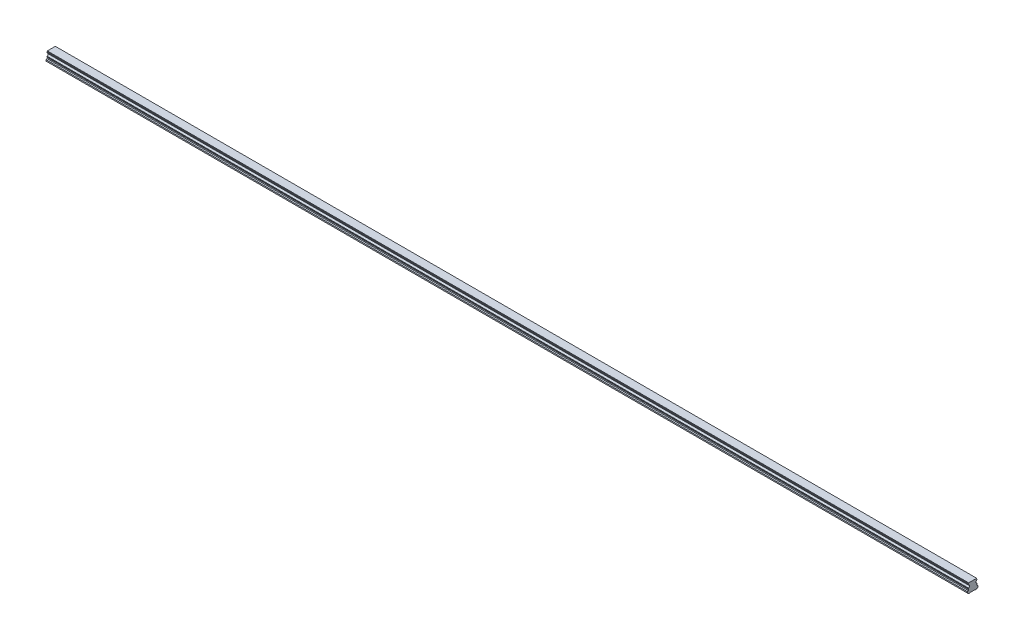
ISO-10303-21;
HEADER;
FILE_DESCRIPTION(('STEP AP214'),'2;1');
FILE_NAME('part.step','',(''),(''),'','','');
FILE_SCHEMA(('AUTOMOTIVE_DESIGN { 1 0 10303 214 1 1 1 1 }'));
ENDSEC;
DATA;
#1=APPLICATION_CONTEXT('core data for automotive mechanical design processes');
#2=APPLICATION_PROTOCOL_DEFINITION('international standard','automotive_design',2000,#1);
#3=PRODUCT_CONTEXT('',#1,'mechanical');
#4=PRODUCT('Part','Part','',(#3));
#5=PRODUCT_RELATED_PRODUCT_CATEGORY('part','',(#4));
#6=PRODUCT_DEFINITION_FORMATION('','',#4);
#7=PRODUCT_DEFINITION_CONTEXT('part definition',#1,'design');
#8=PRODUCT_DEFINITION('design','',#6,#7);
#9=PRODUCT_DEFINITION_SHAPE('','',#8);
#10=(LENGTH_UNIT() NAMED_UNIT(*) SI_UNIT(.MILLI.,.METRE.));
#11=(NAMED_UNIT(*) PLANE_ANGLE_UNIT() SI_UNIT($,.RADIAN.));
#12=(NAMED_UNIT(*) SI_UNIT($,.STERADIAN.) SOLID_ANGLE_UNIT());
#13=UNCERTAINTY_MEASURE_WITH_UNIT(LENGTH_MEASURE(1.E-05),#10,'distance_accuracy_value','');
#14=(GEOMETRIC_REPRESENTATION_CONTEXT(3) GLOBAL_UNCERTAINTY_ASSIGNED_CONTEXT((#13)) GLOBAL_UNIT_ASSIGNED_CONTEXT((#10,
#11,#12)) REPRESENTATION_CONTEXT('',''));
#15=CARTESIAN_POINT('',(0.,0.,0.));
#16=DIRECTION('',(0.,0.,1.));
#17=DIRECTION('',(1.,0.,0.));
#18=AXIS2_PLACEMENT_3D('',#15,#16,#17);
#19=CARTESIAN_POINT('',(2130.,0.499999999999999,0.));
#20=DIRECTION('',(0.,-1.,0.));
#21=DIRECTION('',(0.,0.,-1.));
#22=AXIS2_PLACEMENT_3D('',#19,#20,#21);
#23=CONICAL_SURFACE('',#22,3.5,0.785398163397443);
#24=CARTESIAN_POINT('',(2130.,1.00000000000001,0.));
#25=DIRECTION('',(0.,1.,0.));
#26=DIRECTION('',(0.,0.,1.));
#27=AXIS2_PLACEMENT_3D('',#24,#25,#26);
#28=CIRCLE('',#27,3.);
#29=CARTESIAN_POINT('',(2130.,1.00000000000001,3.));
#30=VERTEX_POINT('',#29);
#31=EDGE_CURVE('E11',#30,#30,#28,.F.);
#32=ORIENTED_EDGE('',*,*,#31,.F.);
#33=EDGE_LOOP('',(#32));
#34=FACE_BOUND('',#33,.T.);
#35=CARTESIAN_POINT('',(2130.,0.499999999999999,0.));
#36=DIRECTION('',(0.,1.,0.));
#37=DIRECTION('',(0.,0.,1.));
#38=AXIS2_PLACEMENT_3D('',#35,#36,#37);
#39=CIRCLE('',#38,3.5);
#40=CARTESIAN_POINT('',(2130.,0.5,3.5));
#41=VERTEX_POINT('',#40);
#42=EDGE_CURVE('E831',#41,#41,#39,.T.);
#43=ORIENTED_EDGE('',*,*,#42,.F.);
#44=EDGE_LOOP('',(#43));
#45=FACE_BOUND('',#44,.T.);
#46=ADVANCED_FACE('F39',(#34,#45),#23,.F.);
#47=CARTESIAN_POINT('',(2130.,12.,0.));
#48=DIRECTION('',(0.,-1.,0.));
#49=DIRECTION('',(0.,0.,-1.));
#50=AXIS2_PLACEMENT_3D('',#47,#48,#49);
#51=CYLINDRICAL_SURFACE('',#50,3.);
#52=ORIENTED_EDGE('',*,*,#31,.T.);
#53=EDGE_LOOP('',(#52));
#54=FACE_BOUND('',#53,.T.);
#55=CARTESIAN_POINT('',(2130.,12.,0.));
#56=DIRECTION('',(0.,-1.,0.));
#57=DIRECTION('',(0.,0.,-1.));
#58=AXIS2_PLACEMENT_3D('',#55,#56,#57);
#59=CIRCLE('',#58,3.);
#60=CARTESIAN_POINT('',(2130.,12.,-3.));
#61=VERTEX_POINT('',#60);
#62=EDGE_CURVE('E49',#61,#61,#59,.T.);
#63=ORIENTED_EDGE('',*,*,#62,.F.);
#64=EDGE_LOOP('',(#63));
#65=FACE_BOUND('',#64,.T.);
#66=ADVANCED_FACE('F1156',(#54,#65),#51,.F.);
#67=CARTESIAN_POINT('',(2130.,12.,0.));
#68=DIRECTION('',(0.,-1.,0.));
#69=DIRECTION('',(0.,0.,-1.));
#70=AXIS2_PLACEMENT_3D('',#67,#68,#69);
#71=PLANE('',#70);
#72=CARTESIAN_POINT('',(2130.,12.,0.));
#73=DIRECTION('',(0.,-1.,0.));
#74=DIRECTION('',(0.,0.,-1.));
#75=AXIS2_PLACEMENT_3D('',#72,#73,#74);
#76=CIRCLE('',#75,2.5);
#77=CARTESIAN_POINT('',(2130.,12.,-2.5));
#78=VERTEX_POINT('',#77);
#79=EDGE_CURVE('E42',#78,#78,#76,.T.);
#80=ORIENTED_EDGE('',*,*,#79,.F.);
#81=EDGE_LOOP('',(#80));
#82=FACE_BOUND('',#81,.T.);
#83=ORIENTED_EDGE('',*,*,#62,.T.);
#84=EDGE_LOOP('',(#83));
#85=FACE_BOUND('',#84,.T.);
#86=ADVANCED_FACE('F1161',(#82,#85),#71,.T.);
#87=CARTESIAN_POINT('',(2070.,0.499999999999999,0.));
#88=DIRECTION('',(0.,-1.,0.));
#89=DIRECTION('',(0.,0.,-1.));
#90=AXIS2_PLACEMENT_3D('',#87,#88,#89);
#91=CONICAL_SURFACE('',#90,3.5,0.785398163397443);
#92=CARTESIAN_POINT('',(2070.,1.00000000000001,0.));
#93=DIRECTION('',(0.,1.,0.));
#94=DIRECTION('',(0.,0.,1.));
#95=AXIS2_PLACEMENT_3D('',#92,#93,#94);
#96=CIRCLE('',#95,3.);
#97=CARTESIAN_POINT('',(2070.,1.00000000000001,3.));
#98=VERTEX_POINT('',#97);
#99=EDGE_CURVE('E827',#98,#98,#96,.F.);
#100=ORIENTED_EDGE('',*,*,#99,.F.);
#101=EDGE_LOOP('',(#100));
#102=FACE_BOUND('',#101,.T.);
#103=CARTESIAN_POINT('',(2070.,0.499999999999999,0.));
#104=DIRECTION('',(0.,1.,0.));
#105=DIRECTION('',(0.,0.,1.));
#106=AXIS2_PLACEMENT_3D('',#103,#104,#105);
#107=CIRCLE('',#106,3.5);
#108=CARTESIAN_POINT('',(2070.,0.5,3.5));
#109=VERTEX_POINT('',#108);
#110=EDGE_CURVE('E819',#109,#109,#107,.T.);
#111=ORIENTED_EDGE('',*,*,#110,.F.);
#112=EDGE_LOOP('',(#111));
#113=FACE_BOUND('',#112,.T.);
#114=ADVANCED_FACE('F1632',(#102,#113),#91,.F.);
#115=CARTESIAN_POINT('',(2070.,12.,0.));
#116=DIRECTION('',(0.,-1.,0.));
#117=DIRECTION('',(0.,0.,-1.));
#118=AXIS2_PLACEMENT_3D('',#115,#116,#117);
#119=CYLINDRICAL_SURFACE('',#118,3.);
#120=ORIENTED_EDGE('',*,*,#99,.T.);
#121=EDGE_LOOP('',(#120));
#122=FACE_BOUND('',#121,.T.);
#123=CARTESIAN_POINT('',(2070.,12.,0.));
#124=DIRECTION('',(0.,-1.,0.));
#125=DIRECTION('',(0.,0.,-1.));
#126=AXIS2_PLACEMENT_3D('',#123,#124,#125);
#127=CIRCLE('',#126,3.);
#128=CARTESIAN_POINT('',(2070.,12.,-3.));
#129=VERTEX_POINT('',#128);
#130=EDGE_CURVE('E823',#129,#129,#127,.T.);
#131=ORIENTED_EDGE('',*,*,#130,.F.);
#132=EDGE_LOOP('',(#131));
#133=FACE_BOUND('',#132,.T.);
#134=ADVANCED_FACE('F1628',(#122,#133),#119,.F.);
#135=CARTESIAN_POINT('',(2070.,12.,0.));
#136=DIRECTION('',(0.,-1.,0.));
#137=DIRECTION('',(0.,0.,-1.));
#138=AXIS2_PLACEMENT_3D('',#135,#136,#137);
#139=PLANE('',#138);
#140=CARTESIAN_POINT('',(2070.,12.,0.));
#141=DIRECTION('',(0.,-1.,0.));
#142=DIRECTION('',(0.,0.,-1.));
#143=AXIS2_PLACEMENT_3D('',#140,#141,#142);
#144=CIRCLE('',#143,2.5);
#145=CARTESIAN_POINT('',(2070.,12.,-2.5));
#146=VERTEX_POINT('',#145);
#147=EDGE_CURVE('E970',#146,#146,#144,.T.);
#148=ORIENTED_EDGE('',*,*,#147,.F.);
#149=EDGE_LOOP('',(#148));
#150=FACE_BOUND('',#149,.T.);
#151=ORIENTED_EDGE('',*,*,#130,.T.);
#152=EDGE_LOOP('',(#151));
#153=FACE_BOUND('',#152,.T.);
#154=ADVANCED_FACE('F1624',(#150,#153),#139,.T.);
#155=CARTESIAN_POINT('',(2010.,0.499999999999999,0.));
#156=DIRECTION('',(0.,-1.,0.));
#157=DIRECTION('',(0.,0.,-1.));
#158=AXIS2_PLACEMENT_3D('',#155,#156,#157);
#159=CONICAL_SURFACE('',#158,3.5,0.785398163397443);
#160=CARTESIAN_POINT('',(2010.,1.00000000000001,0.));
#161=DIRECTION('',(0.,1.,0.));
#162=DIRECTION('',(0.,0.,1.));
#163=AXIS2_PLACEMENT_3D('',#160,#161,#162);
#164=CIRCLE('',#163,3.);
#165=CARTESIAN_POINT('',(2010.,1.00000000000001,3.));
#166=VERTEX_POINT('',#165);
#167=EDGE_CURVE('E815',#166,#166,#164,.F.);
#168=ORIENTED_EDGE('',*,*,#167,.F.);
#169=EDGE_LOOP('',(#168));
#170=FACE_BOUND('',#169,.T.);
#171=CARTESIAN_POINT('',(2010.,0.499999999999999,0.));
#172=DIRECTION('',(0.,1.,0.));
#173=DIRECTION('',(0.,0.,1.));
#174=AXIS2_PLACEMENT_3D('',#171,#172,#173);
#175=CIRCLE('',#174,3.5);
#176=CARTESIAN_POINT('',(2010.,0.5,3.5));
#177=VERTEX_POINT('',#176);
#178=EDGE_CURVE('E807',#177,#177,#175,.T.);
#179=ORIENTED_EDGE('',*,*,#178,.F.);
#180=EDGE_LOOP('',(#179));
#181=FACE_BOUND('',#180,.T.);
#182=ADVANCED_FACE('F1620',(#170,#181),#159,.F.);
#183=CARTESIAN_POINT('',(2010.,12.,0.));
#184=DIRECTION('',(0.,-1.,0.));
#185=DIRECTION('',(0.,0.,-1.));
#186=AXIS2_PLACEMENT_3D('',#183,#184,#185);
#187=CYLINDRICAL_SURFACE('',#186,3.);
#188=ORIENTED_EDGE('',*,*,#167,.T.);
#189=EDGE_LOOP('',(#188));
#190=FACE_BOUND('',#189,.T.);
#191=CARTESIAN_POINT('',(2010.,12.,0.));
#192=DIRECTION('',(0.,-1.,0.));
#193=DIRECTION('',(0.,0.,-1.));
#194=AXIS2_PLACEMENT_3D('',#191,#192,#193);
#195=CIRCLE('',#194,3.);
#196=CARTESIAN_POINT('',(2010.,12.,-3.));
#197=VERTEX_POINT('',#196);
#198=EDGE_CURVE('E811',#197,#197,#195,.T.);
#199=ORIENTED_EDGE('',*,*,#198,.F.);
#200=EDGE_LOOP('',(#199));
#201=FACE_BOUND('',#200,.T.);
#202=ADVANCED_FACE('F1616',(#190,#201),#187,.F.);
#203=CARTESIAN_POINT('',(2010.,12.,0.));
#204=DIRECTION('',(0.,-1.,0.));
#205=DIRECTION('',(0.,0.,-1.));
#206=AXIS2_PLACEMENT_3D('',#203,#204,#205);
#207=PLANE('',#206);
#208=CARTESIAN_POINT('',(2010.,12.,0.));
#209=DIRECTION('',(0.,-1.,0.));
#210=DIRECTION('',(0.,0.,-1.));
#211=AXIS2_PLACEMENT_3D('',#208,#209,#210);
#212=CIRCLE('',#211,2.5);
#213=CARTESIAN_POINT('',(2010.,12.,-2.5));
#214=VERTEX_POINT('',#213);
#215=EDGE_CURVE('E967',#214,#214,#212,.T.);
#216=ORIENTED_EDGE('',*,*,#215,.F.);
#217=EDGE_LOOP('',(#216));
#218=FACE_BOUND('',#217,.T.);
#219=ORIENTED_EDGE('',*,*,#198,.T.);
#220=EDGE_LOOP('',(#219));
#221=FACE_BOUND('',#220,.T.);
#222=ADVANCED_FACE('F1612',(#218,#221),#207,.T.);
#223=CARTESIAN_POINT('',(1950.,0.499999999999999,0.));
#224=DIRECTION('',(0.,-1.,0.));
#225=DIRECTION('',(0.,0.,-1.));
#226=AXIS2_PLACEMENT_3D('',#223,#224,#225);
#227=CONICAL_SURFACE('',#226,3.5,0.785398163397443);
#228=CARTESIAN_POINT('',(1950.,1.00000000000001,0.));
#229=DIRECTION('',(0.,1.,0.));
#230=DIRECTION('',(0.,0.,1.));
#231=AXIS2_PLACEMENT_3D('',#228,#229,#230);
#232=CIRCLE('',#231,3.);
#233=CARTESIAN_POINT('',(1950.,1.00000000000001,3.));
#234=VERTEX_POINT('',#233);
#235=EDGE_CURVE('E803',#234,#234,#232,.F.);
#236=ORIENTED_EDGE('',*,*,#235,.F.);
#237=EDGE_LOOP('',(#236));
#238=FACE_BOUND('',#237,.T.);
#239=CARTESIAN_POINT('',(1950.,0.499999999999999,0.));
#240=DIRECTION('',(0.,1.,0.));
#241=DIRECTION('',(0.,0.,1.));
#242=AXIS2_PLACEMENT_3D('',#239,#240,#241);
#243=CIRCLE('',#242,3.5);
#244=CARTESIAN_POINT('',(1950.,0.5,3.5));
#245=VERTEX_POINT('',#244);
#246=EDGE_CURVE('E795',#245,#245,#243,.T.);
#247=ORIENTED_EDGE('',*,*,#246,.F.);
#248=EDGE_LOOP('',(#247));
#249=FACE_BOUND('',#248,.T.);
#250=ADVANCED_FACE('F1608',(#238,#249),#227,.F.);
#251=CARTESIAN_POINT('',(1950.,12.,0.));
#252=DIRECTION('',(0.,-1.,0.));
#253=DIRECTION('',(0.,0.,-1.));
#254=AXIS2_PLACEMENT_3D('',#251,#252,#253);
#255=CYLINDRICAL_SURFACE('',#254,3.);
#256=ORIENTED_EDGE('',*,*,#235,.T.);
#257=EDGE_LOOP('',(#256));
#258=FACE_BOUND('',#257,.T.);
#259=CARTESIAN_POINT('',(1950.,12.,0.));
#260=DIRECTION('',(0.,-1.,0.));
#261=DIRECTION('',(0.,0.,-1.));
#262=AXIS2_PLACEMENT_3D('',#259,#260,#261);
#263=CIRCLE('',#262,3.);
#264=CARTESIAN_POINT('',(1950.,12.,-3.));
#265=VERTEX_POINT('',#264);
#266=EDGE_CURVE('E799',#265,#265,#263,.T.);
#267=ORIENTED_EDGE('',*,*,#266,.F.);
#268=EDGE_LOOP('',(#267));
#269=FACE_BOUND('',#268,.T.);
#270=ADVANCED_FACE('F1604',(#258,#269),#255,.F.);
#271=CARTESIAN_POINT('',(1950.,12.,0.));
#272=DIRECTION('',(0.,-1.,0.));
#273=DIRECTION('',(0.,0.,-1.));
#274=AXIS2_PLACEMENT_3D('',#271,#272,#273);
#275=PLANE('',#274);
#276=CARTESIAN_POINT('',(1950.,12.,0.));
#277=DIRECTION('',(0.,-1.,0.));
#278=DIRECTION('',(0.,0.,-1.));
#279=AXIS2_PLACEMENT_3D('',#276,#277,#278);
#280=CIRCLE('',#279,2.5);
#281=CARTESIAN_POINT('',(1950.,12.,-2.5));
#282=VERTEX_POINT('',#281);
#283=EDGE_CURVE('E963',#282,#282,#280,.T.);
#284=ORIENTED_EDGE('',*,*,#283,.F.);
#285=EDGE_LOOP('',(#284));
#286=FACE_BOUND('',#285,.T.);
#287=ORIENTED_EDGE('',*,*,#266,.T.);
#288=EDGE_LOOP('',(#287));
#289=FACE_BOUND('',#288,.T.);
#290=ADVANCED_FACE('F1600',(#286,#289),#275,.T.);
#291=CARTESIAN_POINT('',(1890.,0.499999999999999,0.));
#292=DIRECTION('',(0.,-1.,0.));
#293=DIRECTION('',(0.,0.,-1.));
#294=AXIS2_PLACEMENT_3D('',#291,#292,#293);
#295=CONICAL_SURFACE('',#294,3.5,0.785398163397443);
#296=CARTESIAN_POINT('',(1890.,1.00000000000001,0.));
#297=DIRECTION('',(0.,1.,0.));
#298=DIRECTION('',(0.,0.,1.));
#299=AXIS2_PLACEMENT_3D('',#296,#297,#298);
#300=CIRCLE('',#299,3.);
#301=CARTESIAN_POINT('',(1890.,1.00000000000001,3.));
#302=VERTEX_POINT('',#301);
#303=EDGE_CURVE('E791',#302,#302,#300,.F.);
#304=ORIENTED_EDGE('',*,*,#303,.F.);
#305=EDGE_LOOP('',(#304));
#306=FACE_BOUND('',#305,.T.);
#307=CARTESIAN_POINT('',(1890.,0.499999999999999,0.));
#308=DIRECTION('',(0.,1.,0.));
#309=DIRECTION('',(0.,0.,1.));
#310=AXIS2_PLACEMENT_3D('',#307,#308,#309);
#311=CIRCLE('',#310,3.5);
#312=CARTESIAN_POINT('',(1890.,0.5,3.5));
#313=VERTEX_POINT('',#312);
#314=EDGE_CURVE('E783',#313,#313,#311,.T.);
#315=ORIENTED_EDGE('',*,*,#314,.F.);
#316=EDGE_LOOP('',(#315));
#317=FACE_BOUND('',#316,.T.);
#318=ADVANCED_FACE('F1596',(#306,#317),#295,.F.);
#319=CARTESIAN_POINT('',(1890.,12.,0.));
#320=DIRECTION('',(0.,-1.,0.));
#321=DIRECTION('',(0.,0.,-1.));
#322=AXIS2_PLACEMENT_3D('',#319,#320,#321);
#323=CYLINDRICAL_SURFACE('',#322,3.);
#324=ORIENTED_EDGE('',*,*,#303,.T.);
#325=EDGE_LOOP('',(#324));
#326=FACE_BOUND('',#325,.T.);
#327=CARTESIAN_POINT('',(1890.,12.,0.));
#328=DIRECTION('',(0.,-1.,0.));
#329=DIRECTION('',(0.,0.,-1.));
#330=AXIS2_PLACEMENT_3D('',#327,#328,#329);
#331=CIRCLE('',#330,3.);
#332=CARTESIAN_POINT('',(1890.,12.,-3.));
#333=VERTEX_POINT('',#332);
#334=EDGE_CURVE('E787',#333,#333,#331,.T.);
#335=ORIENTED_EDGE('',*,*,#334,.F.);
#336=EDGE_LOOP('',(#335));
#337=FACE_BOUND('',#336,.T.);
#338=ADVANCED_FACE('F1592',(#326,#337),#323,.F.);
#339=CARTESIAN_POINT('',(1890.,12.,0.));
#340=DIRECTION('',(0.,-1.,0.));
#341=DIRECTION('',(0.,0.,-1.));
#342=AXIS2_PLACEMENT_3D('',#339,#340,#341);
#343=PLANE('',#342);
#344=CARTESIAN_POINT('',(1890.,12.,0.));
#345=DIRECTION('',(0.,-1.,0.));
#346=DIRECTION('',(0.,0.,-1.));
#347=AXIS2_PLACEMENT_3D('',#344,#345,#346);
#348=CIRCLE('',#347,2.5);
#349=CARTESIAN_POINT('',(1890.,12.,-2.5));
#350=VERTEX_POINT('',#349);
#351=EDGE_CURVE('E959',#350,#350,#348,.T.);
#352=ORIENTED_EDGE('',*,*,#351,.F.);
#353=EDGE_LOOP('',(#352));
#354=FACE_BOUND('',#353,.T.);
#355=ORIENTED_EDGE('',*,*,#334,.T.);
#356=EDGE_LOOP('',(#355));
#357=FACE_BOUND('',#356,.T.);
#358=ADVANCED_FACE('F1588',(#354,#357),#343,.T.);
#359=CARTESIAN_POINT('',(1830.,0.499999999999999,0.));
#360=DIRECTION('',(0.,-1.,0.));
#361=DIRECTION('',(0.,0.,-1.));
#362=AXIS2_PLACEMENT_3D('',#359,#360,#361);
#363=CONICAL_SURFACE('',#362,3.5,0.785398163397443);
#364=CARTESIAN_POINT('',(1830.,1.00000000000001,0.));
#365=DIRECTION('',(0.,1.,0.));
#366=DIRECTION('',(0.,0.,1.));
#367=AXIS2_PLACEMENT_3D('',#364,#365,#366);
#368=CIRCLE('',#367,3.);
#369=CARTESIAN_POINT('',(1830.,1.00000000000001,3.));
#370=VERTEX_POINT('',#369);
#371=EDGE_CURVE('E779',#370,#370,#368,.F.);
#372=ORIENTED_EDGE('',*,*,#371,.F.);
#373=EDGE_LOOP('',(#372));
#374=FACE_BOUND('',#373,.T.);
#375=CARTESIAN_POINT('',(1830.,0.499999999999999,0.));
#376=DIRECTION('',(0.,1.,0.));
#377=DIRECTION('',(0.,0.,1.));
#378=AXIS2_PLACEMENT_3D('',#375,#376,#377);
#379=CIRCLE('',#378,3.5);
#380=CARTESIAN_POINT('',(1830.,0.5,3.5));
#381=VERTEX_POINT('',#380);
#382=EDGE_CURVE('E771',#381,#381,#379,.T.);
#383=ORIENTED_EDGE('',*,*,#382,.F.);
#384=EDGE_LOOP('',(#383));
#385=FACE_BOUND('',#384,.T.);
#386=ADVANCED_FACE('F1584',(#374,#385),#363,.F.);
#387=CARTESIAN_POINT('',(1830.,12.,0.));
#388=DIRECTION('',(0.,-1.,0.));
#389=DIRECTION('',(0.,0.,-1.));
#390=AXIS2_PLACEMENT_3D('',#387,#388,#389);
#391=CYLINDRICAL_SURFACE('',#390,3.);
#392=ORIENTED_EDGE('',*,*,#371,.T.);
#393=EDGE_LOOP('',(#392));
#394=FACE_BOUND('',#393,.T.);
#395=CARTESIAN_POINT('',(1830.,12.,0.));
#396=DIRECTION('',(0.,-1.,0.));
#397=DIRECTION('',(0.,0.,-1.));
#398=AXIS2_PLACEMENT_3D('',#395,#396,#397);
#399=CIRCLE('',#398,3.);
#400=CARTESIAN_POINT('',(1830.,12.,-3.));
#401=VERTEX_POINT('',#400);
#402=EDGE_CURVE('E775',#401,#401,#399,.T.);
#403=ORIENTED_EDGE('',*,*,#402,.F.);
#404=EDGE_LOOP('',(#403));
#405=FACE_BOUND('',#404,.T.);
#406=ADVANCED_FACE('F1580',(#394,#405),#391,.F.);
#407=CARTESIAN_POINT('',(1830.,12.,0.));
#408=DIRECTION('',(0.,-1.,0.));
#409=DIRECTION('',(0.,0.,-1.));
#410=AXIS2_PLACEMENT_3D('',#407,#408,#409);
#411=PLANE('',#410);
#412=CARTESIAN_POINT('',(1830.,12.,0.));
#413=DIRECTION('',(0.,-1.,0.));
#414=DIRECTION('',(0.,0.,-1.));
#415=AXIS2_PLACEMENT_3D('',#412,#413,#414);
#416=CIRCLE('',#415,2.5);
#417=CARTESIAN_POINT('',(1830.,12.,-2.5));
#418=VERTEX_POINT('',#417);
#419=EDGE_CURVE('E955',#418,#418,#416,.T.);
#420=ORIENTED_EDGE('',*,*,#419,.F.);
#421=EDGE_LOOP('',(#420));
#422=FACE_BOUND('',#421,.T.);
#423=ORIENTED_EDGE('',*,*,#402,.T.);
#424=EDGE_LOOP('',(#423));
#425=FACE_BOUND('',#424,.T.);
#426=ADVANCED_FACE('F1576',(#422,#425),#411,.T.);
#427=CARTESIAN_POINT('',(1770.,0.499999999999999,0.));
#428=DIRECTION('',(0.,-1.,0.));
#429=DIRECTION('',(0.,0.,-1.));
#430=AXIS2_PLACEMENT_3D('',#427,#428,#429);
#431=CONICAL_SURFACE('',#430,3.5,0.785398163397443);
#432=CARTESIAN_POINT('',(1770.,1.00000000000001,0.));
#433=DIRECTION('',(0.,1.,0.));
#434=DIRECTION('',(0.,0.,1.));
#435=AXIS2_PLACEMENT_3D('',#432,#433,#434);
#436=CIRCLE('',#435,3.);
#437=CARTESIAN_POINT('',(1770.,1.00000000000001,3.));
#438=VERTEX_POINT('',#437);
#439=EDGE_CURVE('E767',#438,#438,#436,.F.);
#440=ORIENTED_EDGE('',*,*,#439,.F.);
#441=EDGE_LOOP('',(#440));
#442=FACE_BOUND('',#441,.T.);
#443=CARTESIAN_POINT('',(1770.,0.499999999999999,0.));
#444=DIRECTION('',(0.,1.,0.));
#445=DIRECTION('',(0.,0.,1.));
#446=AXIS2_PLACEMENT_3D('',#443,#444,#445);
#447=CIRCLE('',#446,3.5);
#448=CARTESIAN_POINT('',(1770.,0.5,3.5));
#449=VERTEX_POINT('',#448);
#450=EDGE_CURVE('E759',#449,#449,#447,.T.);
#451=ORIENTED_EDGE('',*,*,#450,.F.);
#452=EDGE_LOOP('',(#451));
#453=FACE_BOUND('',#452,.T.);
#454=ADVANCED_FACE('F1572',(#442,#453),#431,.F.);
#455=CARTESIAN_POINT('',(1770.,12.,0.));
#456=DIRECTION('',(0.,-1.,0.));
#457=DIRECTION('',(0.,0.,-1.));
#458=AXIS2_PLACEMENT_3D('',#455,#456,#457);
#459=CYLINDRICAL_SURFACE('',#458,3.);
#460=ORIENTED_EDGE('',*,*,#439,.T.);
#461=EDGE_LOOP('',(#460));
#462=FACE_BOUND('',#461,.T.);
#463=CARTESIAN_POINT('',(1770.,12.,0.));
#464=DIRECTION('',(0.,-1.,0.));
#465=DIRECTION('',(0.,0.,-1.));
#466=AXIS2_PLACEMENT_3D('',#463,#464,#465);
#467=CIRCLE('',#466,3.);
#468=CARTESIAN_POINT('',(1770.,12.,-3.));
#469=VERTEX_POINT('',#468);
#470=EDGE_CURVE('E763',#469,#469,#467,.T.);
#471=ORIENTED_EDGE('',*,*,#470,.F.);
#472=EDGE_LOOP('',(#471));
#473=FACE_BOUND('',#472,.T.);
#474=ADVANCED_FACE('F1568',(#462,#473),#459,.F.);
#475=CARTESIAN_POINT('',(1770.,12.,0.));
#476=DIRECTION('',(0.,-1.,0.));
#477=DIRECTION('',(0.,0.,-1.));
#478=AXIS2_PLACEMENT_3D('',#475,#476,#477);
#479=PLANE('',#478);
#480=CARTESIAN_POINT('',(1770.,12.,0.));
#481=DIRECTION('',(0.,-1.,0.));
#482=DIRECTION('',(0.,0.,-1.));
#483=AXIS2_PLACEMENT_3D('',#480,#481,#482);
#484=CIRCLE('',#483,2.5);
#485=CARTESIAN_POINT('',(1770.,12.,-2.5));
#486=VERTEX_POINT('',#485);
#487=EDGE_CURVE('E951',#486,#486,#484,.T.);
#488=ORIENTED_EDGE('',*,*,#487,.F.);
#489=EDGE_LOOP('',(#488));
#490=FACE_BOUND('',#489,.T.);
#491=ORIENTED_EDGE('',*,*,#470,.T.);
#492=EDGE_LOOP('',(#491));
#493=FACE_BOUND('',#492,.T.);
#494=ADVANCED_FACE('F1564',(#490,#493),#479,.T.);
#495=CARTESIAN_POINT('',(1710.,0.499999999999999,0.));
#496=DIRECTION('',(0.,-1.,0.));
#497=DIRECTION('',(0.,0.,-1.));
#498=AXIS2_PLACEMENT_3D('',#495,#496,#497);
#499=CONICAL_SURFACE('',#498,3.5,0.785398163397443);
#500=CARTESIAN_POINT('',(1710.,1.00000000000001,0.));
#501=DIRECTION('',(0.,1.,0.));
#502=DIRECTION('',(0.,0.,1.));
#503=AXIS2_PLACEMENT_3D('',#500,#501,#502);
#504=CIRCLE('',#503,3.);
#505=CARTESIAN_POINT('',(1710.,1.00000000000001,3.));
#506=VERTEX_POINT('',#505);
#507=EDGE_CURVE('E755',#506,#506,#504,.F.);
#508=ORIENTED_EDGE('',*,*,#507,.F.);
#509=EDGE_LOOP('',(#508));
#510=FACE_BOUND('',#509,.T.);
#511=CARTESIAN_POINT('',(1710.,0.499999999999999,0.));
#512=DIRECTION('',(0.,1.,0.));
#513=DIRECTION('',(0.,0.,1.));
#514=AXIS2_PLACEMENT_3D('',#511,#512,#513);
#515=CIRCLE('',#514,3.5);
#516=CARTESIAN_POINT('',(1710.,0.5,3.5));
#517=VERTEX_POINT('',#516);
#518=EDGE_CURVE('E747',#517,#517,#515,.T.);
#519=ORIENTED_EDGE('',*,*,#518,.F.);
#520=EDGE_LOOP('',(#519));
#521=FACE_BOUND('',#520,.T.);
#522=ADVANCED_FACE('F1560',(#510,#521),#499,.F.);
#523=CARTESIAN_POINT('',(1710.,12.,0.));
#524=DIRECTION('',(0.,-1.,0.));
#525=DIRECTION('',(0.,0.,-1.));
#526=AXIS2_PLACEMENT_3D('',#523,#524,#525);
#527=CYLINDRICAL_SURFACE('',#526,3.);
#528=ORIENTED_EDGE('',*,*,#507,.T.);
#529=EDGE_LOOP('',(#528));
#530=FACE_BOUND('',#529,.T.);
#531=CARTESIAN_POINT('',(1710.,12.,0.));
#532=DIRECTION('',(0.,-1.,0.));
#533=DIRECTION('',(0.,0.,-1.));
#534=AXIS2_PLACEMENT_3D('',#531,#532,#533);
#535=CIRCLE('',#534,3.);
#536=CARTESIAN_POINT('',(1710.,12.,-3.));
#537=VERTEX_POINT('',#536);
#538=EDGE_CURVE('E751',#537,#537,#535,.T.);
#539=ORIENTED_EDGE('',*,*,#538,.F.);
#540=EDGE_LOOP('',(#539));
#541=FACE_BOUND('',#540,.T.);
#542=ADVANCED_FACE('F1556',(#530,#541),#527,.F.);
#543=CARTESIAN_POINT('',(1710.,12.,0.));
#544=DIRECTION('',(0.,-1.,0.));
#545=DIRECTION('',(0.,0.,-1.));
#546=AXIS2_PLACEMENT_3D('',#543,#544,#545);
#547=PLANE('',#546);
#548=CARTESIAN_POINT('',(1710.,12.,0.));
#549=DIRECTION('',(0.,-1.,0.));
#550=DIRECTION('',(0.,0.,-1.));
#551=AXIS2_PLACEMENT_3D('',#548,#549,#550);
#552=CIRCLE('',#551,2.5);
#553=CARTESIAN_POINT('',(1710.,12.,-2.5));
#554=VERTEX_POINT('',#553);
#555=EDGE_CURVE('E947',#554,#554,#552,.T.);
#556=ORIENTED_EDGE('',*,*,#555,.F.);
#557=EDGE_LOOP('',(#556));
#558=FACE_BOUND('',#557,.T.);
#559=ORIENTED_EDGE('',*,*,#538,.T.);
#560=EDGE_LOOP('',(#559));
#561=FACE_BOUND('',#560,.T.);
#562=ADVANCED_FACE('F1552',(#558,#561),#547,.T.);
#563=CARTESIAN_POINT('',(1650.,0.499999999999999,0.));
#564=DIRECTION('',(0.,-1.,0.));
#565=DIRECTION('',(0.,0.,-1.));
#566=AXIS2_PLACEMENT_3D('',#563,#564,#565);
#567=CONICAL_SURFACE('',#566,3.5,0.785398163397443);
#568=CARTESIAN_POINT('',(1650.,1.00000000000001,0.));
#569=DIRECTION('',(0.,1.,0.));
#570=DIRECTION('',(0.,0.,1.));
#571=AXIS2_PLACEMENT_3D('',#568,#569,#570);
#572=CIRCLE('',#571,3.);
#573=CARTESIAN_POINT('',(1650.,1.00000000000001,3.));
#574=VERTEX_POINT('',#573);
#575=EDGE_CURVE('E743',#574,#574,#572,.F.);
#576=ORIENTED_EDGE('',*,*,#575,.F.);
#577=EDGE_LOOP('',(#576));
#578=FACE_BOUND('',#577,.T.);
#579=CARTESIAN_POINT('',(1650.,0.499999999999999,0.));
#580=DIRECTION('',(0.,1.,0.));
#581=DIRECTION('',(0.,0.,1.));
#582=AXIS2_PLACEMENT_3D('',#579,#580,#581);
#583=CIRCLE('',#582,3.5);
#584=CARTESIAN_POINT('',(1650.,0.5,3.5));
#585=VERTEX_POINT('',#584);
#586=EDGE_CURVE('E735',#585,#585,#583,.T.);
#587=ORIENTED_EDGE('',*,*,#586,.F.);
#588=EDGE_LOOP('',(#587));
#589=FACE_BOUND('',#588,.T.);
#590=ADVANCED_FACE('F1548',(#578,#589),#567,.F.);
#591=CARTESIAN_POINT('',(1650.,12.,0.));
#592=DIRECTION('',(0.,-1.,0.));
#593=DIRECTION('',(0.,0.,-1.));
#594=AXIS2_PLACEMENT_3D('',#591,#592,#593);
#595=CYLINDRICAL_SURFACE('',#594,3.);
#596=ORIENTED_EDGE('',*,*,#575,.T.);
#597=EDGE_LOOP('',(#596));
#598=FACE_BOUND('',#597,.T.);
#599=CARTESIAN_POINT('',(1650.,12.,0.));
#600=DIRECTION('',(0.,-1.,0.));
#601=DIRECTION('',(0.,0.,-1.));
#602=AXIS2_PLACEMENT_3D('',#599,#600,#601);
#603=CIRCLE('',#602,3.);
#604=CARTESIAN_POINT('',(1650.,12.,-3.));
#605=VERTEX_POINT('',#604);
#606=EDGE_CURVE('E739',#605,#605,#603,.T.);
#607=ORIENTED_EDGE('',*,*,#606,.F.);
#608=EDGE_LOOP('',(#607));
#609=FACE_BOUND('',#608,.T.);
#610=ADVANCED_FACE('F1544',(#598,#609),#595,.F.);
#611=CARTESIAN_POINT('',(1650.,12.,0.));
#612=DIRECTION('',(0.,-1.,0.));
#613=DIRECTION('',(0.,0.,-1.));
#614=AXIS2_PLACEMENT_3D('',#611,#612,#613);
#615=PLANE('',#614);
#616=CARTESIAN_POINT('',(1650.,12.,0.));
#617=DIRECTION('',(0.,-1.,0.));
#618=DIRECTION('',(0.,0.,-1.));
#619=AXIS2_PLACEMENT_3D('',#616,#617,#618);
#620=CIRCLE('',#619,2.5);
#621=CARTESIAN_POINT('',(1650.,12.,-2.5));
#622=VERTEX_POINT('',#621);
#623=EDGE_CURVE('E943',#622,#622,#620,.T.);
#624=ORIENTED_EDGE('',*,*,#623,.F.);
#625=EDGE_LOOP('',(#624));
#626=FACE_BOUND('',#625,.T.);
#627=ORIENTED_EDGE('',*,*,#606,.T.);
#628=EDGE_LOOP('',(#627));
#629=FACE_BOUND('',#628,.T.);
#630=ADVANCED_FACE('F1540',(#626,#629),#615,.T.);
#631=CARTESIAN_POINT('',(1590.,0.499999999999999,0.));
#632=DIRECTION('',(0.,-1.,0.));
#633=DIRECTION('',(0.,0.,-1.));
#634=AXIS2_PLACEMENT_3D('',#631,#632,#633);
#635=CONICAL_SURFACE('',#634,3.5,0.785398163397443);
#636=CARTESIAN_POINT('',(1590.,1.00000000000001,0.));
#637=DIRECTION('',(0.,1.,0.));
#638=DIRECTION('',(0.,0.,1.));
#639=AXIS2_PLACEMENT_3D('',#636,#637,#638);
#640=CIRCLE('',#639,3.);
#641=CARTESIAN_POINT('',(1590.,1.00000000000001,3.));
#642=VERTEX_POINT('',#641);
#643=EDGE_CURVE('E731',#642,#642,#640,.F.);
#644=ORIENTED_EDGE('',*,*,#643,.F.);
#645=EDGE_LOOP('',(#644));
#646=FACE_BOUND('',#645,.T.);
#647=CARTESIAN_POINT('',(1590.,0.499999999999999,0.));
#648=DIRECTION('',(0.,1.,0.));
#649=DIRECTION('',(0.,0.,1.));
#650=AXIS2_PLACEMENT_3D('',#647,#648,#649);
#651=CIRCLE('',#650,3.5);
#652=CARTESIAN_POINT('',(1590.,0.5,3.5));
#653=VERTEX_POINT('',#652);
#654=EDGE_CURVE('E723',#653,#653,#651,.T.);
#655=ORIENTED_EDGE('',*,*,#654,.F.);
#656=EDGE_LOOP('',(#655));
#657=FACE_BOUND('',#656,.T.);
#658=ADVANCED_FACE('F1536',(#646,#657),#635,.F.);
#659=CARTESIAN_POINT('',(1590.,12.,0.));
#660=DIRECTION('',(0.,-1.,0.));
#661=DIRECTION('',(0.,0.,-1.));
#662=AXIS2_PLACEMENT_3D('',#659,#660,#661);
#663=CYLINDRICAL_SURFACE('',#662,3.);
#664=ORIENTED_EDGE('',*,*,#643,.T.);
#665=EDGE_LOOP('',(#664));
#666=FACE_BOUND('',#665,.T.);
#667=CARTESIAN_POINT('',(1590.,12.,0.));
#668=DIRECTION('',(0.,-1.,0.));
#669=DIRECTION('',(0.,0.,-1.));
#670=AXIS2_PLACEMENT_3D('',#667,#668,#669);
#671=CIRCLE('',#670,3.);
#672=CARTESIAN_POINT('',(1590.,12.,-3.));
#673=VERTEX_POINT('',#672);
#674=EDGE_CURVE('E727',#673,#673,#671,.T.);
#675=ORIENTED_EDGE('',*,*,#674,.F.);
#676=EDGE_LOOP('',(#675));
#677=FACE_BOUND('',#676,.T.);
#678=ADVANCED_FACE('F1532',(#666,#677),#663,.F.);
#679=CARTESIAN_POINT('',(1590.,12.,0.));
#680=DIRECTION('',(0.,-1.,0.));
#681=DIRECTION('',(0.,0.,-1.));
#682=AXIS2_PLACEMENT_3D('',#679,#680,#681);
#683=PLANE('',#682);
#684=CARTESIAN_POINT('',(1590.,12.,0.));
#685=DIRECTION('',(0.,-1.,0.));
#686=DIRECTION('',(0.,0.,-1.));
#687=AXIS2_PLACEMENT_3D('',#684,#685,#686);
#688=CIRCLE('',#687,2.5);
#689=CARTESIAN_POINT('',(1590.,12.,-2.5));
#690=VERTEX_POINT('',#689);
#691=EDGE_CURVE('E939',#690,#690,#688,.T.);
#692=ORIENTED_EDGE('',*,*,#691,.F.);
#693=EDGE_LOOP('',(#692));
#694=FACE_BOUND('',#693,.T.);
#695=ORIENTED_EDGE('',*,*,#674,.T.);
#696=EDGE_LOOP('',(#695));
#697=FACE_BOUND('',#696,.T.);
#698=ADVANCED_FACE('F1528',(#694,#697),#683,.T.);
#699=CARTESIAN_POINT('',(1530.,0.499999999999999,0.));
#700=DIRECTION('',(0.,-1.,0.));
#701=DIRECTION('',(0.,0.,-1.));
#702=AXIS2_PLACEMENT_3D('',#699,#700,#701);
#703=CONICAL_SURFACE('',#702,3.5,0.785398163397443);
#704=CARTESIAN_POINT('',(1530.,1.00000000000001,0.));
#705=DIRECTION('',(0.,1.,0.));
#706=DIRECTION('',(0.,0.,1.));
#707=AXIS2_PLACEMENT_3D('',#704,#705,#706);
#708=CIRCLE('',#707,3.);
#709=CARTESIAN_POINT('',(1530.,1.00000000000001,3.));
#710=VERTEX_POINT('',#709);
#711=EDGE_CURVE('E719',#710,#710,#708,.F.);
#712=ORIENTED_EDGE('',*,*,#711,.F.);
#713=EDGE_LOOP('',(#712));
#714=FACE_BOUND('',#713,.T.);
#715=CARTESIAN_POINT('',(1530.,0.499999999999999,0.));
#716=DIRECTION('',(0.,1.,0.));
#717=DIRECTION('',(0.,0.,1.));
#718=AXIS2_PLACEMENT_3D('',#715,#716,#717);
#719=CIRCLE('',#718,3.5);
#720=CARTESIAN_POINT('',(1530.,0.5,3.5));
#721=VERTEX_POINT('',#720);
#722=EDGE_CURVE('E711',#721,#721,#719,.T.);
#723=ORIENTED_EDGE('',*,*,#722,.F.);
#724=EDGE_LOOP('',(#723));
#725=FACE_BOUND('',#724,.T.);
#726=ADVANCED_FACE('F1524',(#714,#725),#703,.F.);
#727=CARTESIAN_POINT('',(1530.,12.,0.));
#728=DIRECTION('',(0.,-1.,0.));
#729=DIRECTION('',(0.,0.,-1.));
#730=AXIS2_PLACEMENT_3D('',#727,#728,#729);
#731=CYLINDRICAL_SURFACE('',#730,3.);
#732=ORIENTED_EDGE('',*,*,#711,.T.);
#733=EDGE_LOOP('',(#732));
#734=FACE_BOUND('',#733,.T.);
#735=CARTESIAN_POINT('',(1530.,12.,0.));
#736=DIRECTION('',(0.,-1.,0.));
#737=DIRECTION('',(0.,0.,-1.));
#738=AXIS2_PLACEMENT_3D('',#735,#736,#737);
#739=CIRCLE('',#738,3.);
#740=CARTESIAN_POINT('',(1530.,12.,-3.));
#741=VERTEX_POINT('',#740);
#742=EDGE_CURVE('E715',#741,#741,#739,.T.);
#743=ORIENTED_EDGE('',*,*,#742,.F.);
#744=EDGE_LOOP('',(#743));
#745=FACE_BOUND('',#744,.T.);
#746=ADVANCED_FACE('F1520',(#734,#745),#731,.F.);
#747=CARTESIAN_POINT('',(1530.,12.,0.));
#748=DIRECTION('',(0.,-1.,0.));
#749=DIRECTION('',(0.,0.,-1.));
#750=AXIS2_PLACEMENT_3D('',#747,#748,#749);
#751=PLANE('',#750);
#752=CARTESIAN_POINT('',(1530.,12.,0.));
#753=DIRECTION('',(0.,-1.,0.));
#754=DIRECTION('',(0.,0.,-1.));
#755=AXIS2_PLACEMENT_3D('',#752,#753,#754);
#756=CIRCLE('',#755,2.5);
#757=CARTESIAN_POINT('',(1530.,12.,-2.5));
#758=VERTEX_POINT('',#757);
#759=EDGE_CURVE('E935',#758,#758,#756,.T.);
#760=ORIENTED_EDGE('',*,*,#759,.F.);
#761=EDGE_LOOP('',(#760));
#762=FACE_BOUND('',#761,.T.);
#763=ORIENTED_EDGE('',*,*,#742,.T.);
#764=EDGE_LOOP('',(#763));
#765=FACE_BOUND('',#764,.T.);
#766=ADVANCED_FACE('F1516',(#762,#765),#751,.T.);
#767=CARTESIAN_POINT('',(1470.,0.499999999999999,0.));
#768=DIRECTION('',(0.,-1.,0.));
#769=DIRECTION('',(0.,0.,-1.));
#770=AXIS2_PLACEMENT_3D('',#767,#768,#769);
#771=CONICAL_SURFACE('',#770,3.5,0.785398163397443);
#772=CARTESIAN_POINT('',(1470.,1.00000000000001,0.));
#773=DIRECTION('',(0.,1.,0.));
#774=DIRECTION('',(0.,0.,1.));
#775=AXIS2_PLACEMENT_3D('',#772,#773,#774);
#776=CIRCLE('',#775,3.);
#777=CARTESIAN_POINT('',(1470.,1.00000000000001,3.));
#778=VERTEX_POINT('',#777);
#779=EDGE_CURVE('E707',#778,#778,#776,.F.);
#780=ORIENTED_EDGE('',*,*,#779,.F.);
#781=EDGE_LOOP('',(#780));
#782=FACE_BOUND('',#781,.T.);
#783=CARTESIAN_POINT('',(1470.,0.499999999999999,0.));
#784=DIRECTION('',(0.,1.,0.));
#785=DIRECTION('',(0.,0.,1.));
#786=AXIS2_PLACEMENT_3D('',#783,#784,#785);
#787=CIRCLE('',#786,3.5);
#788=CARTESIAN_POINT('',(1470.,0.5,3.5));
#789=VERTEX_POINT('',#788);
#790=EDGE_CURVE('E699',#789,#789,#787,.T.);
#791=ORIENTED_EDGE('',*,*,#790,.F.);
#792=EDGE_LOOP('',(#791));
#793=FACE_BOUND('',#792,.T.);
#794=ADVANCED_FACE('F1512',(#782,#793),#771,.F.);
#795=CARTESIAN_POINT('',(1470.,12.,0.));
#796=DIRECTION('',(0.,-1.,0.));
#797=DIRECTION('',(0.,0.,-1.));
#798=AXIS2_PLACEMENT_3D('',#795,#796,#797);
#799=CYLINDRICAL_SURFACE('',#798,3.);
#800=ORIENTED_EDGE('',*,*,#779,.T.);
#801=EDGE_LOOP('',(#800));
#802=FACE_BOUND('',#801,.T.);
#803=CARTESIAN_POINT('',(1470.,12.,0.));
#804=DIRECTION('',(0.,-1.,0.));
#805=DIRECTION('',(0.,0.,-1.));
#806=AXIS2_PLACEMENT_3D('',#803,#804,#805);
#807=CIRCLE('',#806,3.);
#808=CARTESIAN_POINT('',(1470.,12.,-3.));
#809=VERTEX_POINT('',#808);
#810=EDGE_CURVE('E703',#809,#809,#807,.T.);
#811=ORIENTED_EDGE('',*,*,#810,.F.);
#812=EDGE_LOOP('',(#811));
#813=FACE_BOUND('',#812,.T.);
#814=ADVANCED_FACE('F1508',(#802,#813),#799,.F.);
#815=CARTESIAN_POINT('',(1470.,12.,0.));
#816=DIRECTION('',(0.,-1.,0.));
#817=DIRECTION('',(0.,0.,-1.));
#818=AXIS2_PLACEMENT_3D('',#815,#816,#817);
#819=PLANE('',#818);
#820=CARTESIAN_POINT('',(1470.,12.,0.));
#821=DIRECTION('',(0.,-1.,0.));
#822=DIRECTION('',(0.,0.,-1.));
#823=AXIS2_PLACEMENT_3D('',#820,#821,#822);
#824=CIRCLE('',#823,2.5);
#825=CARTESIAN_POINT('',(1470.,12.,-2.5));
#826=VERTEX_POINT('',#825);
#827=EDGE_CURVE('E931',#826,#826,#824,.T.);
#828=ORIENTED_EDGE('',*,*,#827,.F.);
#829=EDGE_LOOP('',(#828));
#830=FACE_BOUND('',#829,.T.);
#831=ORIENTED_EDGE('',*,*,#810,.T.);
#832=EDGE_LOOP('',(#831));
#833=FACE_BOUND('',#832,.T.);
#834=ADVANCED_FACE('F1504',(#830,#833),#819,.T.);
#835=CARTESIAN_POINT('',(1410.,0.499999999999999,0.));
#836=DIRECTION('',(0.,-1.,0.));
#837=DIRECTION('',(0.,0.,-1.));
#838=AXIS2_PLACEMENT_3D('',#835,#836,#837);
#839=CONICAL_SURFACE('',#838,3.5,0.785398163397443);
#840=CARTESIAN_POINT('',(1410.,1.00000000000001,0.));
#841=DIRECTION('',(0.,1.,0.));
#842=DIRECTION('',(0.,0.,1.));
#843=AXIS2_PLACEMENT_3D('',#840,#841,#842);
#844=CIRCLE('',#843,3.);
#845=CARTESIAN_POINT('',(1410.,1.00000000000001,3.));
#846=VERTEX_POINT('',#845);
#847=EDGE_CURVE('E695',#846,#846,#844,.F.);
#848=ORIENTED_EDGE('',*,*,#847,.F.);
#849=EDGE_LOOP('',(#848));
#850=FACE_BOUND('',#849,.T.);
#851=CARTESIAN_POINT('',(1410.,0.499999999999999,0.));
#852=DIRECTION('',(0.,1.,0.));
#853=DIRECTION('',(0.,0.,1.));
#854=AXIS2_PLACEMENT_3D('',#851,#852,#853);
#855=CIRCLE('',#854,3.5);
#856=CARTESIAN_POINT('',(1410.,0.5,3.5));
#857=VERTEX_POINT('',#856);
#858=EDGE_CURVE('E687',#857,#857,#855,.T.);
#859=ORIENTED_EDGE('',*,*,#858,.F.);
#860=EDGE_LOOP('',(#859));
#861=FACE_BOUND('',#860,.T.);
#862=ADVANCED_FACE('F1500',(#850,#861),#839,.F.);
#863=CARTESIAN_POINT('',(1410.,12.,0.));
#864=DIRECTION('',(0.,-1.,0.));
#865=DIRECTION('',(0.,0.,-1.));
#866=AXIS2_PLACEMENT_3D('',#863,#864,#865);
#867=CYLINDRICAL_SURFACE('',#866,3.);
#868=ORIENTED_EDGE('',*,*,#847,.T.);
#869=EDGE_LOOP('',(#868));
#870=FACE_BOUND('',#869,.T.);
#871=CARTESIAN_POINT('',(1410.,12.,0.));
#872=DIRECTION('',(0.,-1.,0.));
#873=DIRECTION('',(0.,0.,-1.));
#874=AXIS2_PLACEMENT_3D('',#871,#872,#873);
#875=CIRCLE('',#874,3.);
#876=CARTESIAN_POINT('',(1410.,12.,-3.));
#877=VERTEX_POINT('',#876);
#878=EDGE_CURVE('E691',#877,#877,#875,.T.);
#879=ORIENTED_EDGE('',*,*,#878,.F.);
#880=EDGE_LOOP('',(#879));
#881=FACE_BOUND('',#880,.T.);
#882=ADVANCED_FACE('F1496',(#870,#881),#867,.F.);
#883=CARTESIAN_POINT('',(1410.,12.,0.));
#884=DIRECTION('',(0.,-1.,0.));
#885=DIRECTION('',(0.,0.,-1.));
#886=AXIS2_PLACEMENT_3D('',#883,#884,#885);
#887=PLANE('',#886);
#888=CARTESIAN_POINT('',(1410.,12.,0.));
#889=DIRECTION('',(0.,-1.,0.));
#890=DIRECTION('',(0.,0.,-1.));
#891=AXIS2_PLACEMENT_3D('',#888,#889,#890);
#892=CIRCLE('',#891,2.5);
#893=CARTESIAN_POINT('',(1410.,12.,-2.5));
#894=VERTEX_POINT('',#893);
#895=EDGE_CURVE('E927',#894,#894,#892,.T.);
#896=ORIENTED_EDGE('',*,*,#895,.F.);
#897=EDGE_LOOP('',(#896));
#898=FACE_BOUND('',#897,.T.);
#899=ORIENTED_EDGE('',*,*,#878,.T.);
#900=EDGE_LOOP('',(#899));
#901=FACE_BOUND('',#900,.T.);
#902=ADVANCED_FACE('F1492',(#898,#901),#887,.T.);
#903=CARTESIAN_POINT('',(1350.,0.499999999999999,0.));
#904=DIRECTION('',(0.,-1.,0.));
#905=DIRECTION('',(0.,0.,-1.));
#906=AXIS2_PLACEMENT_3D('',#903,#904,#905);
#907=CONICAL_SURFACE('',#906,3.5,0.785398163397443);
#908=CARTESIAN_POINT('',(1350.,1.00000000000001,0.));
#909=DIRECTION('',(0.,1.,0.));
#910=DIRECTION('',(0.,0.,1.));
#911=AXIS2_PLACEMENT_3D('',#908,#909,#910);
#912=CIRCLE('',#911,3.);
#913=CARTESIAN_POINT('',(1350.,1.00000000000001,3.));
#914=VERTEX_POINT('',#913);
#915=EDGE_CURVE('E683',#914,#914,#912,.F.);
#916=ORIENTED_EDGE('',*,*,#915,.F.);
#917=EDGE_LOOP('',(#916));
#918=FACE_BOUND('',#917,.T.);
#919=CARTESIAN_POINT('',(1350.,0.499999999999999,0.));
#920=DIRECTION('',(0.,1.,0.));
#921=DIRECTION('',(0.,0.,1.));
#922=AXIS2_PLACEMENT_3D('',#919,#920,#921);
#923=CIRCLE('',#922,3.5);
#924=CARTESIAN_POINT('',(1350.,0.5,3.5));
#925=VERTEX_POINT('',#924);
#926=EDGE_CURVE('E675',#925,#925,#923,.T.);
#927=ORIENTED_EDGE('',*,*,#926,.F.);
#928=EDGE_LOOP('',(#927));
#929=FACE_BOUND('',#928,.T.);
#930=ADVANCED_FACE('F1488',(#918,#929),#907,.F.);
#931=CARTESIAN_POINT('',(1350.,12.,0.));
#932=DIRECTION('',(0.,-1.,0.));
#933=DIRECTION('',(0.,0.,-1.));
#934=AXIS2_PLACEMENT_3D('',#931,#932,#933);
#935=CYLINDRICAL_SURFACE('',#934,3.);
#936=ORIENTED_EDGE('',*,*,#915,.T.);
#937=EDGE_LOOP('',(#936));
#938=FACE_BOUND('',#937,.T.);
#939=CARTESIAN_POINT('',(1350.,12.,0.));
#940=DIRECTION('',(0.,-1.,0.));
#941=DIRECTION('',(0.,0.,-1.));
#942=AXIS2_PLACEMENT_3D('',#939,#940,#941);
#943=CIRCLE('',#942,3.);
#944=CARTESIAN_POINT('',(1350.,12.,-3.));
#945=VERTEX_POINT('',#944);
#946=EDGE_CURVE('E679',#945,#945,#943,.T.);
#947=ORIENTED_EDGE('',*,*,#946,.F.);
#948=EDGE_LOOP('',(#947));
#949=FACE_BOUND('',#948,.T.);
#950=ADVANCED_FACE('F1484',(#938,#949),#935,.F.);
#951=CARTESIAN_POINT('',(1350.,12.,0.));
#952=DIRECTION('',(0.,-1.,0.));
#953=DIRECTION('',(0.,0.,-1.));
#954=AXIS2_PLACEMENT_3D('',#951,#952,#953);
#955=PLANE('',#954);
#956=CARTESIAN_POINT('',(1350.,12.,0.));
#957=DIRECTION('',(0.,-1.,0.));
#958=DIRECTION('',(0.,0.,-1.));
#959=AXIS2_PLACEMENT_3D('',#956,#957,#958);
#960=CIRCLE('',#959,2.5);
#961=CARTESIAN_POINT('',(1350.,12.,-2.5));
#962=VERTEX_POINT('',#961);
#963=EDGE_CURVE('E923',#962,#962,#960,.T.);
#964=ORIENTED_EDGE('',*,*,#963,.F.);
#965=EDGE_LOOP('',(#964));
#966=FACE_BOUND('',#965,.T.);
#967=ORIENTED_EDGE('',*,*,#946,.T.);
#968=EDGE_LOOP('',(#967));
#969=FACE_BOUND('',#968,.T.);
#970=ADVANCED_FACE('F1480',(#966,#969),#955,.T.);
#971=CARTESIAN_POINT('',(1290.,0.499999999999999,0.));
#972=DIRECTION('',(0.,-1.,0.));
#973=DIRECTION('',(0.,0.,-1.));
#974=AXIS2_PLACEMENT_3D('',#971,#972,#973);
#975=CONICAL_SURFACE('',#974,3.5,0.785398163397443);
#976=CARTESIAN_POINT('',(1290.,1.00000000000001,0.));
#977=DIRECTION('',(0.,1.,0.));
#978=DIRECTION('',(0.,0.,1.));
#979=AXIS2_PLACEMENT_3D('',#976,#977,#978);
#980=CIRCLE('',#979,3.);
#981=CARTESIAN_POINT('',(1290.,1.00000000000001,3.));
#982=VERTEX_POINT('',#981);
#983=EDGE_CURVE('E671',#982,#982,#980,.F.);
#984=ORIENTED_EDGE('',*,*,#983,.F.);
#985=EDGE_LOOP('',(#984));
#986=FACE_BOUND('',#985,.T.);
#987=CARTESIAN_POINT('',(1290.,0.499999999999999,0.));
#988=DIRECTION('',(0.,1.,0.));
#989=DIRECTION('',(0.,0.,1.));
#990=AXIS2_PLACEMENT_3D('',#987,#988,#989);
#991=CIRCLE('',#990,3.5);
#992=CARTESIAN_POINT('',(1290.,0.5,3.5));
#993=VERTEX_POINT('',#992);
#994=EDGE_CURVE('E663',#993,#993,#991,.T.);
#995=ORIENTED_EDGE('',*,*,#994,.F.);
#996=EDGE_LOOP('',(#995));
#997=FACE_BOUND('',#996,.T.);
#998=ADVANCED_FACE('F1476',(#986,#997),#975,.F.);
#999=CARTESIAN_POINT('',(1290.,12.,0.));
#1000=DIRECTION('',(0.,-1.,0.));
#1001=DIRECTION('',(0.,0.,-1.));
#1002=AXIS2_PLACEMENT_3D('',#999,#1000,#1001);
#1003=CYLINDRICAL_SURFACE('',#1002,3.);
#1004=ORIENTED_EDGE('',*,*,#983,.T.);
#1005=EDGE_LOOP('',(#1004));
#1006=FACE_BOUND('',#1005,.T.);
#1007=CARTESIAN_POINT('',(1290.,12.,0.));
#1008=DIRECTION('',(0.,-1.,0.));
#1009=DIRECTION('',(0.,0.,-1.));
#1010=AXIS2_PLACEMENT_3D('',#1007,#1008,#1009);
#1011=CIRCLE('',#1010,3.);
#1012=CARTESIAN_POINT('',(1290.,12.,-3.));
#1013=VERTEX_POINT('',#1012);
#1014=EDGE_CURVE('E667',#1013,#1013,#1011,.T.);
#1015=ORIENTED_EDGE('',*,*,#1014,.F.);
#1016=EDGE_LOOP('',(#1015));
#1017=FACE_BOUND('',#1016,.T.);
#1018=ADVANCED_FACE('F1472',(#1006,#1017),#1003,.F.);
#1019=CARTESIAN_POINT('',(1290.,12.,0.));
#1020=DIRECTION('',(0.,-1.,0.));
#1021=DIRECTION('',(0.,0.,-1.));
#1022=AXIS2_PLACEMENT_3D('',#1019,#1020,#1021);
#1023=PLANE('',#1022);
#1024=CARTESIAN_POINT('',(1290.,12.,0.));
#1025=DIRECTION('',(0.,-1.,0.));
#1026=DIRECTION('',(0.,0.,-1.));
#1027=AXIS2_PLACEMENT_3D('',#1024,#1025,#1026);
#1028=CIRCLE('',#1027,2.5);
#1029=CARTESIAN_POINT('',(1290.,12.,-2.5));
#1030=VERTEX_POINT('',#1029);
#1031=EDGE_CURVE('E919',#1030,#1030,#1028,.T.);
#1032=ORIENTED_EDGE('',*,*,#1031,.F.);
#1033=EDGE_LOOP('',(#1032));
#1034=FACE_BOUND('',#1033,.T.);
#1035=ORIENTED_EDGE('',*,*,#1014,.T.);
#1036=EDGE_LOOP('',(#1035));
#1037=FACE_BOUND('',#1036,.T.);
#1038=ADVANCED_FACE('F1468',(#1034,#1037),#1023,.T.);
#1039=CARTESIAN_POINT('',(1230.,0.499999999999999,0.));
#1040=DIRECTION('',(0.,-1.,0.));
#1041=DIRECTION('',(0.,0.,-1.));
#1042=AXIS2_PLACEMENT_3D('',#1039,#1040,#1041);
#1043=CONICAL_SURFACE('',#1042,3.5,0.785398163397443);
#1044=CARTESIAN_POINT('',(1230.,1.00000000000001,0.));
#1045=DIRECTION('',(0.,1.,0.));
#1046=DIRECTION('',(0.,0.,1.));
#1047=AXIS2_PLACEMENT_3D('',#1044,#1045,#1046);
#1048=CIRCLE('',#1047,3.);
#1049=CARTESIAN_POINT('',(1230.,1.00000000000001,3.));
#1050=VERTEX_POINT('',#1049);
#1051=EDGE_CURVE('E659',#1050,#1050,#1048,.F.);
#1052=ORIENTED_EDGE('',*,*,#1051,.F.);
#1053=EDGE_LOOP('',(#1052));
#1054=FACE_BOUND('',#1053,.T.);
#1055=CARTESIAN_POINT('',(1230.,0.499999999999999,0.));
#1056=DIRECTION('',(0.,1.,0.));
#1057=DIRECTION('',(0.,0.,1.));
#1058=AXIS2_PLACEMENT_3D('',#1055,#1056,#1057);
#1059=CIRCLE('',#1058,3.5);
#1060=CARTESIAN_POINT('',(1230.,0.5,3.5));
#1061=VERTEX_POINT('',#1060);
#1062=EDGE_CURVE('E651',#1061,#1061,#1059,.T.);
#1063=ORIENTED_EDGE('',*,*,#1062,.F.);
#1064=EDGE_LOOP('',(#1063));
#1065=FACE_BOUND('',#1064,.T.);
#1066=ADVANCED_FACE('F1464',(#1054,#1065),#1043,.F.);
#1067=CARTESIAN_POINT('',(1230.,12.,0.));
#1068=DIRECTION('',(0.,-1.,0.));
#1069=DIRECTION('',(0.,0.,-1.));
#1070=AXIS2_PLACEMENT_3D('',#1067,#1068,#1069);
#1071=CYLINDRICAL_SURFACE('',#1070,3.);
#1072=ORIENTED_EDGE('',*,*,#1051,.T.);
#1073=EDGE_LOOP('',(#1072));
#1074=FACE_BOUND('',#1073,.T.);
#1075=CARTESIAN_POINT('',(1230.,12.,0.));
#1076=DIRECTION('',(0.,-1.,0.));
#1077=DIRECTION('',(0.,0.,-1.));
#1078=AXIS2_PLACEMENT_3D('',#1075,#1076,#1077);
#1079=CIRCLE('',#1078,3.);
#1080=CARTESIAN_POINT('',(1230.,12.,-3.));
#1081=VERTEX_POINT('',#1080);
#1082=EDGE_CURVE('E655',#1081,#1081,#1079,.T.);
#1083=ORIENTED_EDGE('',*,*,#1082,.F.);
#1084=EDGE_LOOP('',(#1083));
#1085=FACE_BOUND('',#1084,.T.);
#1086=ADVANCED_FACE('F1460',(#1074,#1085),#1071,.F.);
#1087=CARTESIAN_POINT('',(1230.,12.,0.));
#1088=DIRECTION('',(0.,-1.,0.));
#1089=DIRECTION('',(0.,0.,-1.));
#1090=AXIS2_PLACEMENT_3D('',#1087,#1088,#1089);
#1091=PLANE('',#1090);
#1092=CARTESIAN_POINT('',(1230.,12.,0.));
#1093=DIRECTION('',(0.,-1.,0.));
#1094=DIRECTION('',(0.,0.,-1.));
#1095=AXIS2_PLACEMENT_3D('',#1092,#1093,#1094);
#1096=CIRCLE('',#1095,2.5);
#1097=CARTESIAN_POINT('',(1230.,12.,-2.5));
#1098=VERTEX_POINT('',#1097);
#1099=EDGE_CURVE('E915',#1098,#1098,#1096,.T.);
#1100=ORIENTED_EDGE('',*,*,#1099,.F.);
#1101=EDGE_LOOP('',(#1100));
#1102=FACE_BOUND('',#1101,.T.);
#1103=ORIENTED_EDGE('',*,*,#1082,.T.);
#1104=EDGE_LOOP('',(#1103));
#1105=FACE_BOUND('',#1104,.T.);
#1106=ADVANCED_FACE('F1456',(#1102,#1105),#1091,.T.);
#1107=CARTESIAN_POINT('',(1170.,0.499999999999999,0.));
#1108=DIRECTION('',(0.,-1.,0.));
#1109=DIRECTION('',(0.,0.,-1.));
#1110=AXIS2_PLACEMENT_3D('',#1107,#1108,#1109);
#1111=CONICAL_SURFACE('',#1110,3.5,0.785398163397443);
#1112=CARTESIAN_POINT('',(1170.,1.00000000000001,0.));
#1113=DIRECTION('',(0.,1.,0.));
#1114=DIRECTION('',(0.,0.,1.));
#1115=AXIS2_PLACEMENT_3D('',#1112,#1113,#1114);
#1116=CIRCLE('',#1115,3.);
#1117=CARTESIAN_POINT('',(1170.,1.00000000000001,3.));
#1118=VERTEX_POINT('',#1117);
#1119=EDGE_CURVE('E647',#1118,#1118,#1116,.F.);
#1120=ORIENTED_EDGE('',*,*,#1119,.F.);
#1121=EDGE_LOOP('',(#1120));
#1122=FACE_BOUND('',#1121,.T.);
#1123=CARTESIAN_POINT('',(1170.,0.499999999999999,0.));
#1124=DIRECTION('',(0.,1.,0.));
#1125=DIRECTION('',(0.,0.,1.));
#1126=AXIS2_PLACEMENT_3D('',#1123,#1124,#1125);
#1127=CIRCLE('',#1126,3.5);
#1128=CARTESIAN_POINT('',(1170.,0.5,3.5));
#1129=VERTEX_POINT('',#1128);
#1130=EDGE_CURVE('E639',#1129,#1129,#1127,.T.);
#1131=ORIENTED_EDGE('',*,*,#1130,.F.);
#1132=EDGE_LOOP('',(#1131));
#1133=FACE_BOUND('',#1132,.T.);
#1134=ADVANCED_FACE('F1452',(#1122,#1133),#1111,.F.);
#1135=CARTESIAN_POINT('',(1170.,12.,0.));
#1136=DIRECTION('',(0.,-1.,0.));
#1137=DIRECTION('',(0.,0.,-1.));
#1138=AXIS2_PLACEMENT_3D('',#1135,#1136,#1137);
#1139=CYLINDRICAL_SURFACE('',#1138,3.);
#1140=ORIENTED_EDGE('',*,*,#1119,.T.);
#1141=EDGE_LOOP('',(#1140));
#1142=FACE_BOUND('',#1141,.T.);
#1143=CARTESIAN_POINT('',(1170.,12.,0.));
#1144=DIRECTION('',(0.,-1.,0.));
#1145=DIRECTION('',(0.,0.,-1.));
#1146=AXIS2_PLACEMENT_3D('',#1143,#1144,#1145);
#1147=CIRCLE('',#1146,3.);
#1148=CARTESIAN_POINT('',(1170.,12.,-3.));
#1149=VERTEX_POINT('',#1148);
#1150=EDGE_CURVE('E643',#1149,#1149,#1147,.T.);
#1151=ORIENTED_EDGE('',*,*,#1150,.F.);
#1152=EDGE_LOOP('',(#1151));
#1153=FACE_BOUND('',#1152,.T.);
#1154=ADVANCED_FACE('F1448',(#1142,#1153),#1139,.F.);
#1155=CARTESIAN_POINT('',(1170.,12.,0.));
#1156=DIRECTION('',(0.,-1.,0.));
#1157=DIRECTION('',(0.,0.,-1.));
#1158=AXIS2_PLACEMENT_3D('',#1155,#1156,#1157);
#1159=PLANE('',#1158);
#1160=CARTESIAN_POINT('',(1170.,12.,0.));
#1161=DIRECTION('',(0.,-1.,0.));
#1162=DIRECTION('',(0.,0.,-1.));
#1163=AXIS2_PLACEMENT_3D('',#1160,#1161,#1162);
#1164=CIRCLE('',#1163,2.5);
#1165=CARTESIAN_POINT('',(1170.,12.,-2.5));
#1166=VERTEX_POINT('',#1165);
#1167=EDGE_CURVE('E911',#1166,#1166,#1164,.T.);
#1168=ORIENTED_EDGE('',*,*,#1167,.F.);
#1169=EDGE_LOOP('',(#1168));
#1170=FACE_BOUND('',#1169,.T.);
#1171=ORIENTED_EDGE('',*,*,#1150,.T.);
#1172=EDGE_LOOP('',(#1171));
#1173=FACE_BOUND('',#1172,.T.);
#1174=ADVANCED_FACE('F1444',(#1170,#1173),#1159,.T.);
#1175=CARTESIAN_POINT('',(1110.,0.499999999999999,0.));
#1176=DIRECTION('',(0.,-1.,0.));
#1177=DIRECTION('',(0.,0.,-1.));
#1178=AXIS2_PLACEMENT_3D('',#1175,#1176,#1177);
#1179=CONICAL_SURFACE('',#1178,3.5,0.785398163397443);
#1180=CARTESIAN_POINT('',(1110.,1.00000000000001,0.));
#1181=DIRECTION('',(0.,1.,0.));
#1182=DIRECTION('',(0.,0.,1.));
#1183=AXIS2_PLACEMENT_3D('',#1180,#1181,#1182);
#1184=CIRCLE('',#1183,3.);
#1185=CARTESIAN_POINT('',(1110.,1.00000000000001,3.));
#1186=VERTEX_POINT('',#1185);
#1187=EDGE_CURVE('E635',#1186,#1186,#1184,.F.);
#1188=ORIENTED_EDGE('',*,*,#1187,.F.);
#1189=EDGE_LOOP('',(#1188));
#1190=FACE_BOUND('',#1189,.T.);
#1191=CARTESIAN_POINT('',(1110.,0.499999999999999,0.));
#1192=DIRECTION('',(0.,1.,0.));
#1193=DIRECTION('',(0.,0.,1.));
#1194=AXIS2_PLACEMENT_3D('',#1191,#1192,#1193);
#1195=CIRCLE('',#1194,3.5);
#1196=CARTESIAN_POINT('',(1110.,0.5,3.5));
#1197=VERTEX_POINT('',#1196);
#1198=EDGE_CURVE('E627',#1197,#1197,#1195,.T.);
#1199=ORIENTED_EDGE('',*,*,#1198,.F.);
#1200=EDGE_LOOP('',(#1199));
#1201=FACE_BOUND('',#1200,.T.);
#1202=ADVANCED_FACE('F1440',(#1190,#1201),#1179,.F.);
#1203=CARTESIAN_POINT('',(1110.,12.,0.));
#1204=DIRECTION('',(0.,-1.,0.));
#1205=DIRECTION('',(0.,0.,-1.));
#1206=AXIS2_PLACEMENT_3D('',#1203,#1204,#1205);
#1207=CYLINDRICAL_SURFACE('',#1206,3.);
#1208=ORIENTED_EDGE('',*,*,#1187,.T.);
#1209=EDGE_LOOP('',(#1208));
#1210=FACE_BOUND('',#1209,.T.);
#1211=CARTESIAN_POINT('',(1110.,12.,0.));
#1212=DIRECTION('',(0.,-1.,0.));
#1213=DIRECTION('',(0.,0.,-1.));
#1214=AXIS2_PLACEMENT_3D('',#1211,#1212,#1213);
#1215=CIRCLE('',#1214,3.);
#1216=CARTESIAN_POINT('',(1110.,12.,-3.));
#1217=VERTEX_POINT('',#1216);
#1218=EDGE_CURVE('E631',#1217,#1217,#1215,.T.);
#1219=ORIENTED_EDGE('',*,*,#1218,.F.);
#1220=EDGE_LOOP('',(#1219));
#1221=FACE_BOUND('',#1220,.T.);
#1222=ADVANCED_FACE('F1436',(#1210,#1221),#1207,.F.);
#1223=CARTESIAN_POINT('',(1110.,12.,0.));
#1224=DIRECTION('',(0.,-1.,0.));
#1225=DIRECTION('',(0.,0.,-1.));
#1226=AXIS2_PLACEMENT_3D('',#1223,#1224,#1225);
#1227=PLANE('',#1226);
#1228=CARTESIAN_POINT('',(1110.,12.,0.));
#1229=DIRECTION('',(0.,-1.,0.));
#1230=DIRECTION('',(0.,0.,-1.));
#1231=AXIS2_PLACEMENT_3D('',#1228,#1229,#1230);
#1232=CIRCLE('',#1231,2.5);
#1233=CARTESIAN_POINT('',(1110.,12.,-2.5));
#1234=VERTEX_POINT('',#1233);
#1235=EDGE_CURVE('E907',#1234,#1234,#1232,.T.);
#1236=ORIENTED_EDGE('',*,*,#1235,.F.);
#1237=EDGE_LOOP('',(#1236));
#1238=FACE_BOUND('',#1237,.T.);
#1239=ORIENTED_EDGE('',*,*,#1218,.T.);
#1240=EDGE_LOOP('',(#1239));
#1241=FACE_BOUND('',#1240,.T.);
#1242=ADVANCED_FACE('F1432',(#1238,#1241),#1227,.T.);
#1243=CARTESIAN_POINT('',(1050.,0.499999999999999,0.));
#1244=DIRECTION('',(0.,-1.,0.));
#1245=DIRECTION('',(0.,0.,-1.));
#1246=AXIS2_PLACEMENT_3D('',#1243,#1244,#1245);
#1247=CONICAL_SURFACE('',#1246,3.5,0.785398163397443);
#1248=CARTESIAN_POINT('',(1050.,1.00000000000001,0.));
#1249=DIRECTION('',(0.,1.,0.));
#1250=DIRECTION('',(0.,0.,1.));
#1251=AXIS2_PLACEMENT_3D('',#1248,#1249,#1250);
#1252=CIRCLE('',#1251,3.);
#1253=CARTESIAN_POINT('',(1050.,1.00000000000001,3.));
#1254=VERTEX_POINT('',#1253);
#1255=EDGE_CURVE('E623',#1254,#1254,#1252,.F.);
#1256=ORIENTED_EDGE('',*,*,#1255,.F.);
#1257=EDGE_LOOP('',(#1256));
#1258=FACE_BOUND('',#1257,.T.);
#1259=CARTESIAN_POINT('',(1050.,0.499999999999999,0.));
#1260=DIRECTION('',(0.,1.,0.));
#1261=DIRECTION('',(0.,0.,1.));
#1262=AXIS2_PLACEMENT_3D('',#1259,#1260,#1261);
#1263=CIRCLE('',#1262,3.5);
#1264=CARTESIAN_POINT('',(1050.,0.5,3.5));
#1265=VERTEX_POINT('',#1264);
#1266=EDGE_CURVE('E615',#1265,#1265,#1263,.T.);
#1267=ORIENTED_EDGE('',*,*,#1266,.F.);
#1268=EDGE_LOOP('',(#1267));
#1269=FACE_BOUND('',#1268,.T.);
#1270=ADVANCED_FACE('F1428',(#1258,#1269),#1247,.F.);
#1271=CARTESIAN_POINT('',(1050.,12.,0.));
#1272=DIRECTION('',(0.,-1.,0.));
#1273=DIRECTION('',(0.,0.,-1.));
#1274=AXIS2_PLACEMENT_3D('',#1271,#1272,#1273);
#1275=CYLINDRICAL_SURFACE('',#1274,3.);
#1276=ORIENTED_EDGE('',*,*,#1255,.T.);
#1277=EDGE_LOOP('',(#1276));
#1278=FACE_BOUND('',#1277,.T.);
#1279=CARTESIAN_POINT('',(1050.,12.,0.));
#1280=DIRECTION('',(0.,-1.,0.));
#1281=DIRECTION('',(0.,0.,-1.));
#1282=AXIS2_PLACEMENT_3D('',#1279,#1280,#1281);
#1283=CIRCLE('',#1282,3.);
#1284=CARTESIAN_POINT('',(1050.,12.,-3.));
#1285=VERTEX_POINT('',#1284);
#1286=EDGE_CURVE('E619',#1285,#1285,#1283,.T.);
#1287=ORIENTED_EDGE('',*,*,#1286,.F.);
#1288=EDGE_LOOP('',(#1287));
#1289=FACE_BOUND('',#1288,.T.);
#1290=ADVANCED_FACE('F1424',(#1278,#1289),#1275,.F.);
#1291=CARTESIAN_POINT('',(1050.,12.,0.));
#1292=DIRECTION('',(0.,-1.,0.));
#1293=DIRECTION('',(0.,0.,-1.));
#1294=AXIS2_PLACEMENT_3D('',#1291,#1292,#1293);
#1295=PLANE('',#1294);
#1296=CARTESIAN_POINT('',(1050.,12.,0.));
#1297=DIRECTION('',(0.,-1.,0.));
#1298=DIRECTION('',(0.,0.,-1.));
#1299=AXIS2_PLACEMENT_3D('',#1296,#1297,#1298);
#1300=CIRCLE('',#1299,2.5);
#1301=CARTESIAN_POINT('',(1050.,12.,-2.5));
#1302=VERTEX_POINT('',#1301);
#1303=EDGE_CURVE('E903',#1302,#1302,#1300,.T.);
#1304=ORIENTED_EDGE('',*,*,#1303,.F.);
#1305=EDGE_LOOP('',(#1304));
#1306=FACE_BOUND('',#1305,.T.);
#1307=ORIENTED_EDGE('',*,*,#1286,.T.);
#1308=EDGE_LOOP('',(#1307));
#1309=FACE_BOUND('',#1308,.T.);
#1310=ADVANCED_FACE('F1420',(#1306,#1309),#1295,.T.);
#1311=CARTESIAN_POINT('',(990.,0.499999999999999,0.));
#1312=DIRECTION('',(0.,-1.,0.));
#1313=DIRECTION('',(0.,0.,-1.));
#1314=AXIS2_PLACEMENT_3D('',#1311,#1312,#1313);
#1315=CONICAL_SURFACE('',#1314,3.5,0.785398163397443);
#1316=CARTESIAN_POINT('',(990.,1.00000000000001,0.));
#1317=DIRECTION('',(0.,1.,0.));
#1318=DIRECTION('',(0.,0.,1.));
#1319=AXIS2_PLACEMENT_3D('',#1316,#1317,#1318);
#1320=CIRCLE('',#1319,3.);
#1321=CARTESIAN_POINT('',(990.,1.00000000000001,3.));
#1322=VERTEX_POINT('',#1321);
#1323=EDGE_CURVE('E611',#1322,#1322,#1320,.F.);
#1324=ORIENTED_EDGE('',*,*,#1323,.F.);
#1325=EDGE_LOOP('',(#1324));
#1326=FACE_BOUND('',#1325,.T.);
#1327=CARTESIAN_POINT('',(990.,0.499999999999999,0.));
#1328=DIRECTION('',(0.,1.,0.));
#1329=DIRECTION('',(0.,0.,1.));
#1330=AXIS2_PLACEMENT_3D('',#1327,#1328,#1329);
#1331=CIRCLE('',#1330,3.5);
#1332=CARTESIAN_POINT('',(990.,0.5,3.5));
#1333=VERTEX_POINT('',#1332);
#1334=EDGE_CURVE('E603',#1333,#1333,#1331,.T.);
#1335=ORIENTED_EDGE('',*,*,#1334,.F.);
#1336=EDGE_LOOP('',(#1335));
#1337=FACE_BOUND('',#1336,.T.);
#1338=ADVANCED_FACE('F1416',(#1326,#1337),#1315,.F.);
#1339=CARTESIAN_POINT('',(990.,12.,0.));
#1340=DIRECTION('',(0.,-1.,0.));
#1341=DIRECTION('',(0.,0.,-1.));
#1342=AXIS2_PLACEMENT_3D('',#1339,#1340,#1341);
#1343=CYLINDRICAL_SURFACE('',#1342,3.);
#1344=ORIENTED_EDGE('',*,*,#1323,.T.);
#1345=EDGE_LOOP('',(#1344));
#1346=FACE_BOUND('',#1345,.T.);
#1347=CARTESIAN_POINT('',(990.,12.,0.));
#1348=DIRECTION('',(0.,-1.,0.));
#1349=DIRECTION('',(0.,0.,-1.));
#1350=AXIS2_PLACEMENT_3D('',#1347,#1348,#1349);
#1351=CIRCLE('',#1350,3.);
#1352=CARTESIAN_POINT('',(990.,12.,-3.));
#1353=VERTEX_POINT('',#1352);
#1354=EDGE_CURVE('E607',#1353,#1353,#1351,.T.);
#1355=ORIENTED_EDGE('',*,*,#1354,.F.);
#1356=EDGE_LOOP('',(#1355));
#1357=FACE_BOUND('',#1356,.T.);
#1358=ADVANCED_FACE('F1412',(#1346,#1357),#1343,.F.);
#1359=CARTESIAN_POINT('',(990.,12.,0.));
#1360=DIRECTION('',(0.,-1.,0.));
#1361=DIRECTION('',(0.,0.,-1.));
#1362=AXIS2_PLACEMENT_3D('',#1359,#1360,#1361);
#1363=PLANE('',#1362);
#1364=CARTESIAN_POINT('',(990.,12.,0.));
#1365=DIRECTION('',(0.,-1.,0.));
#1366=DIRECTION('',(0.,0.,-1.));
#1367=AXIS2_PLACEMENT_3D('',#1364,#1365,#1366);
#1368=CIRCLE('',#1367,2.5);
#1369=CARTESIAN_POINT('',(990.,12.,-2.5));
#1370=VERTEX_POINT('',#1369);
#1371=EDGE_CURVE('E899',#1370,#1370,#1368,.T.);
#1372=ORIENTED_EDGE('',*,*,#1371,.F.);
#1373=EDGE_LOOP('',(#1372));
#1374=FACE_BOUND('',#1373,.T.);
#1375=ORIENTED_EDGE('',*,*,#1354,.T.);
#1376=EDGE_LOOP('',(#1375));
#1377=FACE_BOUND('',#1376,.T.);
#1378=ADVANCED_FACE('F1408',(#1374,#1377),#1363,.T.);
#1379=CARTESIAN_POINT('',(930.,0.499999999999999,0.));
#1380=DIRECTION('',(0.,-1.,0.));
#1381=DIRECTION('',(0.,0.,-1.));
#1382=AXIS2_PLACEMENT_3D('',#1379,#1380,#1381);
#1383=CONICAL_SURFACE('',#1382,3.5,0.785398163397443);
#1384=CARTESIAN_POINT('',(930.,1.00000000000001,0.));
#1385=DIRECTION('',(0.,1.,0.));
#1386=DIRECTION('',(0.,0.,1.));
#1387=AXIS2_PLACEMENT_3D('',#1384,#1385,#1386);
#1388=CIRCLE('',#1387,3.);
#1389=CARTESIAN_POINT('',(930.,1.00000000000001,3.));
#1390=VERTEX_POINT('',#1389);
#1391=EDGE_CURVE('E599',#1390,#1390,#1388,.F.);
#1392=ORIENTED_EDGE('',*,*,#1391,.F.);
#1393=EDGE_LOOP('',(#1392));
#1394=FACE_BOUND('',#1393,.T.);
#1395=CARTESIAN_POINT('',(930.,0.499999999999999,0.));
#1396=DIRECTION('',(0.,1.,0.));
#1397=DIRECTION('',(0.,0.,1.));
#1398=AXIS2_PLACEMENT_3D('',#1395,#1396,#1397);
#1399=CIRCLE('',#1398,3.5);
#1400=CARTESIAN_POINT('',(930.,0.5,3.5));
#1401=VERTEX_POINT('',#1400);
#1402=EDGE_CURVE('E591',#1401,#1401,#1399,.T.);
#1403=ORIENTED_EDGE('',*,*,#1402,.F.);
#1404=EDGE_LOOP('',(#1403));
#1405=FACE_BOUND('',#1404,.T.);
#1406=ADVANCED_FACE('F1404',(#1394,#1405),#1383,.F.);
#1407=CARTESIAN_POINT('',(930.,12.,0.));
#1408=DIRECTION('',(0.,-1.,0.));
#1409=DIRECTION('',(0.,0.,-1.));
#1410=AXIS2_PLACEMENT_3D('',#1407,#1408,#1409);
#1411=CYLINDRICAL_SURFACE('',#1410,3.);
#1412=ORIENTED_EDGE('',*,*,#1391,.T.);
#1413=EDGE_LOOP('',(#1412));
#1414=FACE_BOUND('',#1413,.T.);
#1415=CARTESIAN_POINT('',(930.,12.,0.));
#1416=DIRECTION('',(0.,-1.,0.));
#1417=DIRECTION('',(0.,0.,-1.));
#1418=AXIS2_PLACEMENT_3D('',#1415,#1416,#1417);
#1419=CIRCLE('',#1418,3.);
#1420=CARTESIAN_POINT('',(930.,12.,-3.));
#1421=VERTEX_POINT('',#1420);
#1422=EDGE_CURVE('E595',#1421,#1421,#1419,.T.);
#1423=ORIENTED_EDGE('',*,*,#1422,.F.);
#1424=EDGE_LOOP('',(#1423));
#1425=FACE_BOUND('',#1424,.T.);
#1426=ADVANCED_FACE('F1400',(#1414,#1425),#1411,.F.);
#1427=CARTESIAN_POINT('',(930.,12.,0.));
#1428=DIRECTION('',(0.,-1.,0.));
#1429=DIRECTION('',(0.,0.,-1.));
#1430=AXIS2_PLACEMENT_3D('',#1427,#1428,#1429);
#1431=PLANE('',#1430);
#1432=CARTESIAN_POINT('',(930.,12.,0.));
#1433=DIRECTION('',(0.,-1.,0.));
#1434=DIRECTION('',(0.,0.,-1.));
#1435=AXIS2_PLACEMENT_3D('',#1432,#1433,#1434);
#1436=CIRCLE('',#1435,2.5);
#1437=CARTESIAN_POINT('',(930.,12.,-2.5));
#1438=VERTEX_POINT('',#1437);
#1439=EDGE_CURVE('E895',#1438,#1438,#1436,.T.);
#1440=ORIENTED_EDGE('',*,*,#1439,.F.);
#1441=EDGE_LOOP('',(#1440));
#1442=FACE_BOUND('',#1441,.T.);
#1443=ORIENTED_EDGE('',*,*,#1422,.T.);
#1444=EDGE_LOOP('',(#1443));
#1445=FACE_BOUND('',#1444,.T.);
#1446=ADVANCED_FACE('F1396',(#1442,#1445),#1431,.T.);
#1447=CARTESIAN_POINT('',(870.,0.499999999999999,0.));
#1448=DIRECTION('',(0.,-1.,0.));
#1449=DIRECTION('',(0.,0.,-1.));
#1450=AXIS2_PLACEMENT_3D('',#1447,#1448,#1449);
#1451=CONICAL_SURFACE('',#1450,3.5,0.785398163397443);
#1452=CARTESIAN_POINT('',(870.,1.00000000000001,0.));
#1453=DIRECTION('',(0.,1.,0.));
#1454=DIRECTION('',(0.,0.,1.));
#1455=AXIS2_PLACEMENT_3D('',#1452,#1453,#1454);
#1456=CIRCLE('',#1455,3.);
#1457=CARTESIAN_POINT('',(870.,1.00000000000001,3.));
#1458=VERTEX_POINT('',#1457);
#1459=EDGE_CURVE('E587',#1458,#1458,#1456,.F.);
#1460=ORIENTED_EDGE('',*,*,#1459,.F.);
#1461=EDGE_LOOP('',(#1460));
#1462=FACE_BOUND('',#1461,.T.);
#1463=CARTESIAN_POINT('',(870.,0.499999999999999,0.));
#1464=DIRECTION('',(0.,1.,0.));
#1465=DIRECTION('',(0.,0.,1.));
#1466=AXIS2_PLACEMENT_3D('',#1463,#1464,#1465);
#1467=CIRCLE('',#1466,3.5);
#1468=CARTESIAN_POINT('',(870.,0.5,3.5));
#1469=VERTEX_POINT('',#1468);
#1470=EDGE_CURVE('E579',#1469,#1469,#1467,.T.);
#1471=ORIENTED_EDGE('',*,*,#1470,.F.);
#1472=EDGE_LOOP('',(#1471));
#1473=FACE_BOUND('',#1472,.T.);
#1474=ADVANCED_FACE('F1392',(#1462,#1473),#1451,.F.);
#1475=CARTESIAN_POINT('',(870.,12.,0.));
#1476=DIRECTION('',(0.,-1.,0.));
#1477=DIRECTION('',(0.,0.,-1.));
#1478=AXIS2_PLACEMENT_3D('',#1475,#1476,#1477);
#1479=CYLINDRICAL_SURFACE('',#1478,3.);
#1480=ORIENTED_EDGE('',*,*,#1459,.T.);
#1481=EDGE_LOOP('',(#1480));
#1482=FACE_BOUND('',#1481,.T.);
#1483=CARTESIAN_POINT('',(870.,12.,0.));
#1484=DIRECTION('',(0.,-1.,0.));
#1485=DIRECTION('',(0.,0.,-1.));
#1486=AXIS2_PLACEMENT_3D('',#1483,#1484,#1485);
#1487=CIRCLE('',#1486,3.);
#1488=CARTESIAN_POINT('',(870.,12.,-3.));
#1489=VERTEX_POINT('',#1488);
#1490=EDGE_CURVE('E583',#1489,#1489,#1487,.T.);
#1491=ORIENTED_EDGE('',*,*,#1490,.F.);
#1492=EDGE_LOOP('',(#1491));
#1493=FACE_BOUND('',#1492,.T.);
#1494=ADVANCED_FACE('F1388',(#1482,#1493),#1479,.F.);
#1495=CARTESIAN_POINT('',(870.,12.,0.));
#1496=DIRECTION('',(0.,-1.,0.));
#1497=DIRECTION('',(0.,0.,-1.));
#1498=AXIS2_PLACEMENT_3D('',#1495,#1496,#1497);
#1499=PLANE('',#1498);
#1500=CARTESIAN_POINT('',(870.,12.,0.));
#1501=DIRECTION('',(0.,-1.,0.));
#1502=DIRECTION('',(0.,0.,-1.));
#1503=AXIS2_PLACEMENT_3D('',#1500,#1501,#1502);
#1504=CIRCLE('',#1503,2.5);
#1505=CARTESIAN_POINT('',(870.,12.,-2.5));
#1506=VERTEX_POINT('',#1505);
#1507=EDGE_CURVE('E891',#1506,#1506,#1504,.T.);
#1508=ORIENTED_EDGE('',*,*,#1507,.F.);
#1509=EDGE_LOOP('',(#1508));
#1510=FACE_BOUND('',#1509,.T.);
#1511=ORIENTED_EDGE('',*,*,#1490,.T.);
#1512=EDGE_LOOP('',(#1511));
#1513=FACE_BOUND('',#1512,.T.);
#1514=ADVANCED_FACE('F1384',(#1510,#1513),#1499,.T.);
#1515=CARTESIAN_POINT('',(810.,0.499999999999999,0.));
#1516=DIRECTION('',(0.,-1.,0.));
#1517=DIRECTION('',(0.,0.,-1.));
#1518=AXIS2_PLACEMENT_3D('',#1515,#1516,#1517);
#1519=CONICAL_SURFACE('',#1518,3.5,0.785398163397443);
#1520=CARTESIAN_POINT('',(810.,1.00000000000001,0.));
#1521=DIRECTION('',(0.,1.,0.));
#1522=DIRECTION('',(0.,0.,1.));
#1523=AXIS2_PLACEMENT_3D('',#1520,#1521,#1522);
#1524=CIRCLE('',#1523,3.);
#1525=CARTESIAN_POINT('',(810.,1.00000000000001,3.));
#1526=VERTEX_POINT('',#1525);
#1527=EDGE_CURVE('E575',#1526,#1526,#1524,.F.);
#1528=ORIENTED_EDGE('',*,*,#1527,.F.);
#1529=EDGE_LOOP('',(#1528));
#1530=FACE_BOUND('',#1529,.T.);
#1531=CARTESIAN_POINT('',(810.,0.499999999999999,0.));
#1532=DIRECTION('',(0.,1.,0.));
#1533=DIRECTION('',(0.,0.,1.));
#1534=AXIS2_PLACEMENT_3D('',#1531,#1532,#1533);
#1535=CIRCLE('',#1534,3.5);
#1536=CARTESIAN_POINT('',(810.,0.5,3.5));
#1537=VERTEX_POINT('',#1536);
#1538=EDGE_CURVE('E567',#1537,#1537,#1535,.T.);
#1539=ORIENTED_EDGE('',*,*,#1538,.F.);
#1540=EDGE_LOOP('',(#1539));
#1541=FACE_BOUND('',#1540,.T.);
#1542=ADVANCED_FACE('F1380',(#1530,#1541),#1519,.F.);
#1543=CARTESIAN_POINT('',(810.,12.,0.));
#1544=DIRECTION('',(0.,-1.,0.));
#1545=DIRECTION('',(0.,0.,-1.));
#1546=AXIS2_PLACEMENT_3D('',#1543,#1544,#1545);
#1547=CYLINDRICAL_SURFACE('',#1546,3.);
#1548=ORIENTED_EDGE('',*,*,#1527,.T.);
#1549=EDGE_LOOP('',(#1548));
#1550=FACE_BOUND('',#1549,.T.);
#1551=CARTESIAN_POINT('',(810.,12.,0.));
#1552=DIRECTION('',(0.,-1.,0.));
#1553=DIRECTION('',(0.,0.,-1.));
#1554=AXIS2_PLACEMENT_3D('',#1551,#1552,#1553);
#1555=CIRCLE('',#1554,3.);
#1556=CARTESIAN_POINT('',(810.,12.,-3.));
#1557=VERTEX_POINT('',#1556);
#1558=EDGE_CURVE('E571',#1557,#1557,#1555,.T.);
#1559=ORIENTED_EDGE('',*,*,#1558,.F.);
#1560=EDGE_LOOP('',(#1559));
#1561=FACE_BOUND('',#1560,.T.);
#1562=ADVANCED_FACE('F1376',(#1550,#1561),#1547,.F.);
#1563=CARTESIAN_POINT('',(810.,12.,0.));
#1564=DIRECTION('',(0.,-1.,0.));
#1565=DIRECTION('',(0.,0.,-1.));
#1566=AXIS2_PLACEMENT_3D('',#1563,#1564,#1565);
#1567=PLANE('',#1566);
#1568=CARTESIAN_POINT('',(810.,12.,0.));
#1569=DIRECTION('',(0.,-1.,0.));
#1570=DIRECTION('',(0.,0.,-1.));
#1571=AXIS2_PLACEMENT_3D('',#1568,#1569,#1570);
#1572=CIRCLE('',#1571,2.5);
#1573=CARTESIAN_POINT('',(810.,12.,-2.5));
#1574=VERTEX_POINT('',#1573);
#1575=EDGE_CURVE('E887',#1574,#1574,#1572,.T.);
#1576=ORIENTED_EDGE('',*,*,#1575,.F.);
#1577=EDGE_LOOP('',(#1576));
#1578=FACE_BOUND('',#1577,.T.);
#1579=ORIENTED_EDGE('',*,*,#1558,.T.);
#1580=EDGE_LOOP('',(#1579));
#1581=FACE_BOUND('',#1580,.T.);
#1582=ADVANCED_FACE('F1372',(#1578,#1581),#1567,.T.);
#1583=CARTESIAN_POINT('',(750.,0.499999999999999,0.));
#1584=DIRECTION('',(0.,-1.,0.));
#1585=DIRECTION('',(0.,0.,-1.));
#1586=AXIS2_PLACEMENT_3D('',#1583,#1584,#1585);
#1587=CONICAL_SURFACE('',#1586,3.5,0.785398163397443);
#1588=CARTESIAN_POINT('',(750.,1.00000000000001,0.));
#1589=DIRECTION('',(0.,1.,0.));
#1590=DIRECTION('',(0.,0.,1.));
#1591=AXIS2_PLACEMENT_3D('',#1588,#1589,#1590);
#1592=CIRCLE('',#1591,3.);
#1593=CARTESIAN_POINT('',(750.,1.00000000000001,3.));
#1594=VERTEX_POINT('',#1593);
#1595=EDGE_CURVE('E563',#1594,#1594,#1592,.F.);
#1596=ORIENTED_EDGE('',*,*,#1595,.F.);
#1597=EDGE_LOOP('',(#1596));
#1598=FACE_BOUND('',#1597,.T.);
#1599=CARTESIAN_POINT('',(750.,0.499999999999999,0.));
#1600=DIRECTION('',(0.,1.,0.));
#1601=DIRECTION('',(0.,0.,1.));
#1602=AXIS2_PLACEMENT_3D('',#1599,#1600,#1601);
#1603=CIRCLE('',#1602,3.5);
#1604=CARTESIAN_POINT('',(750.,0.5,3.5));
#1605=VERTEX_POINT('',#1604);
#1606=EDGE_CURVE('E555',#1605,#1605,#1603,.T.);
#1607=ORIENTED_EDGE('',*,*,#1606,.F.);
#1608=EDGE_LOOP('',(#1607));
#1609=FACE_BOUND('',#1608,.T.);
#1610=ADVANCED_FACE('F1368',(#1598,#1609),#1587,.F.);
#1611=CARTESIAN_POINT('',(750.,12.,0.));
#1612=DIRECTION('',(0.,-1.,0.));
#1613=DIRECTION('',(0.,0.,-1.));
#1614=AXIS2_PLACEMENT_3D('',#1611,#1612,#1613);
#1615=CYLINDRICAL_SURFACE('',#1614,3.);
#1616=ORIENTED_EDGE('',*,*,#1595,.T.);
#1617=EDGE_LOOP('',(#1616));
#1618=FACE_BOUND('',#1617,.T.);
#1619=CARTESIAN_POINT('',(750.,12.,0.));
#1620=DIRECTION('',(0.,-1.,0.));
#1621=DIRECTION('',(0.,0.,-1.));
#1622=AXIS2_PLACEMENT_3D('',#1619,#1620,#1621);
#1623=CIRCLE('',#1622,3.);
#1624=CARTESIAN_POINT('',(750.,12.,-3.));
#1625=VERTEX_POINT('',#1624);
#1626=EDGE_CURVE('E559',#1625,#1625,#1623,.T.);
#1627=ORIENTED_EDGE('',*,*,#1626,.F.);
#1628=EDGE_LOOP('',(#1627));
#1629=FACE_BOUND('',#1628,.T.);
#1630=ADVANCED_FACE('F1364',(#1618,#1629),#1615,.F.);
#1631=CARTESIAN_POINT('',(750.,12.,0.));
#1632=DIRECTION('',(0.,-1.,0.));
#1633=DIRECTION('',(0.,0.,-1.));
#1634=AXIS2_PLACEMENT_3D('',#1631,#1632,#1633);
#1635=PLANE('',#1634);
#1636=CARTESIAN_POINT('',(750.,12.,0.));
#1637=DIRECTION('',(0.,-1.,0.));
#1638=DIRECTION('',(0.,0.,-1.));
#1639=AXIS2_PLACEMENT_3D('',#1636,#1637,#1638);
#1640=CIRCLE('',#1639,2.5);
#1641=CARTESIAN_POINT('',(750.,12.,-2.5));
#1642=VERTEX_POINT('',#1641);
#1643=EDGE_CURVE('E883',#1642,#1642,#1640,.T.);
#1644=ORIENTED_EDGE('',*,*,#1643,.F.);
#1645=EDGE_LOOP('',(#1644));
#1646=FACE_BOUND('',#1645,.T.);
#1647=ORIENTED_EDGE('',*,*,#1626,.T.);
#1648=EDGE_LOOP('',(#1647));
#1649=FACE_BOUND('',#1648,.T.);
#1650=ADVANCED_FACE('F1360',(#1646,#1649),#1635,.T.);
#1651=CARTESIAN_POINT('',(690.,0.499999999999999,0.));
#1652=DIRECTION('',(0.,-1.,0.));
#1653=DIRECTION('',(0.,0.,-1.));
#1654=AXIS2_PLACEMENT_3D('',#1651,#1652,#1653);
#1655=CONICAL_SURFACE('',#1654,3.5,0.785398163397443);
#1656=CARTESIAN_POINT('',(690.,1.00000000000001,0.));
#1657=DIRECTION('',(0.,1.,0.));
#1658=DIRECTION('',(0.,0.,1.));
#1659=AXIS2_PLACEMENT_3D('',#1656,#1657,#1658);
#1660=CIRCLE('',#1659,3.);
#1661=CARTESIAN_POINT('',(690.,1.00000000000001,3.));
#1662=VERTEX_POINT('',#1661);
#1663=EDGE_CURVE('E551',#1662,#1662,#1660,.F.);
#1664=ORIENTED_EDGE('',*,*,#1663,.F.);
#1665=EDGE_LOOP('',(#1664));
#1666=FACE_BOUND('',#1665,.T.);
#1667=CARTESIAN_POINT('',(690.,0.499999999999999,0.));
#1668=DIRECTION('',(0.,1.,0.));
#1669=DIRECTION('',(0.,0.,1.));
#1670=AXIS2_PLACEMENT_3D('',#1667,#1668,#1669);
#1671=CIRCLE('',#1670,3.5);
#1672=CARTESIAN_POINT('',(690.,0.5,3.5));
#1673=VERTEX_POINT('',#1672);
#1674=EDGE_CURVE('E543',#1673,#1673,#1671,.T.);
#1675=ORIENTED_EDGE('',*,*,#1674,.F.);
#1676=EDGE_LOOP('',(#1675));
#1677=FACE_BOUND('',#1676,.T.);
#1678=ADVANCED_FACE('F1356',(#1666,#1677),#1655,.F.);
#1679=CARTESIAN_POINT('',(690.,12.,0.));
#1680=DIRECTION('',(0.,-1.,0.));
#1681=DIRECTION('',(0.,0.,-1.));
#1682=AXIS2_PLACEMENT_3D('',#1679,#1680,#1681);
#1683=CYLINDRICAL_SURFACE('',#1682,3.);
#1684=ORIENTED_EDGE('',*,*,#1663,.T.);
#1685=EDGE_LOOP('',(#1684));
#1686=FACE_BOUND('',#1685,.T.);
#1687=CARTESIAN_POINT('',(690.,12.,0.));
#1688=DIRECTION('',(0.,-1.,0.));
#1689=DIRECTION('',(0.,0.,-1.));
#1690=AXIS2_PLACEMENT_3D('',#1687,#1688,#1689);
#1691=CIRCLE('',#1690,3.);
#1692=CARTESIAN_POINT('',(690.,12.,-3.));
#1693=VERTEX_POINT('',#1692);
#1694=EDGE_CURVE('E547',#1693,#1693,#1691,.T.);
#1695=ORIENTED_EDGE('',*,*,#1694,.F.);
#1696=EDGE_LOOP('',(#1695));
#1697=FACE_BOUND('',#1696,.T.);
#1698=ADVANCED_FACE('F1352',(#1686,#1697),#1683,.F.);
#1699=CARTESIAN_POINT('',(690.,12.,0.));
#1700=DIRECTION('',(0.,-1.,0.));
#1701=DIRECTION('',(0.,0.,-1.));
#1702=AXIS2_PLACEMENT_3D('',#1699,#1700,#1701);
#1703=PLANE('',#1702);
#1704=CARTESIAN_POINT('',(690.,12.,0.));
#1705=DIRECTION('',(0.,-1.,0.));
#1706=DIRECTION('',(0.,0.,-1.));
#1707=AXIS2_PLACEMENT_3D('',#1704,#1705,#1706);
#1708=CIRCLE('',#1707,2.5);
#1709=CARTESIAN_POINT('',(690.,12.,-2.5));
#1710=VERTEX_POINT('',#1709);
#1711=EDGE_CURVE('E879',#1710,#1710,#1708,.T.);
#1712=ORIENTED_EDGE('',*,*,#1711,.F.);
#1713=EDGE_LOOP('',(#1712));
#1714=FACE_BOUND('',#1713,.T.);
#1715=ORIENTED_EDGE('',*,*,#1694,.T.);
#1716=EDGE_LOOP('',(#1715));
#1717=FACE_BOUND('',#1716,.T.);
#1718=ADVANCED_FACE('F1348',(#1714,#1717),#1703,.T.);
#1719=CARTESIAN_POINT('',(630.,0.499999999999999,0.));
#1720=DIRECTION('',(0.,-1.,0.));
#1721=DIRECTION('',(0.,0.,-1.));
#1722=AXIS2_PLACEMENT_3D('',#1719,#1720,#1721);
#1723=CONICAL_SURFACE('',#1722,3.5,0.785398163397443);
#1724=CARTESIAN_POINT('',(630.,1.00000000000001,0.));
#1725=DIRECTION('',(0.,1.,0.));
#1726=DIRECTION('',(0.,0.,1.));
#1727=AXIS2_PLACEMENT_3D('',#1724,#1725,#1726);
#1728=CIRCLE('',#1727,3.);
#1729=CARTESIAN_POINT('',(630.,1.00000000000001,3.));
#1730=VERTEX_POINT('',#1729);
#1731=EDGE_CURVE('E539',#1730,#1730,#1728,.F.);
#1732=ORIENTED_EDGE('',*,*,#1731,.F.);
#1733=EDGE_LOOP('',(#1732));
#1734=FACE_BOUND('',#1733,.T.);
#1735=CARTESIAN_POINT('',(630.,0.499999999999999,0.));
#1736=DIRECTION('',(0.,1.,0.));
#1737=DIRECTION('',(0.,0.,1.));
#1738=AXIS2_PLACEMENT_3D('',#1735,#1736,#1737);
#1739=CIRCLE('',#1738,3.5);
#1740=CARTESIAN_POINT('',(630.,0.5,3.5));
#1741=VERTEX_POINT('',#1740);
#1742=EDGE_CURVE('E531',#1741,#1741,#1739,.T.);
#1743=ORIENTED_EDGE('',*,*,#1742,.F.);
#1744=EDGE_LOOP('',(#1743));
#1745=FACE_BOUND('',#1744,.T.);
#1746=ADVANCED_FACE('F1344',(#1734,#1745),#1723,.F.);
#1747=CARTESIAN_POINT('',(630.,12.,0.));
#1748=DIRECTION('',(0.,-1.,0.));
#1749=DIRECTION('',(0.,0.,-1.));
#1750=AXIS2_PLACEMENT_3D('',#1747,#1748,#1749);
#1751=CYLINDRICAL_SURFACE('',#1750,3.);
#1752=ORIENTED_EDGE('',*,*,#1731,.T.);
#1753=EDGE_LOOP('',(#1752));
#1754=FACE_BOUND('',#1753,.T.);
#1755=CARTESIAN_POINT('',(630.,12.,0.));
#1756=DIRECTION('',(0.,-1.,0.));
#1757=DIRECTION('',(0.,0.,-1.));
#1758=AXIS2_PLACEMENT_3D('',#1755,#1756,#1757);
#1759=CIRCLE('',#1758,3.);
#1760=CARTESIAN_POINT('',(630.,12.,-3.));
#1761=VERTEX_POINT('',#1760);
#1762=EDGE_CURVE('E535',#1761,#1761,#1759,.T.);
#1763=ORIENTED_EDGE('',*,*,#1762,.F.);
#1764=EDGE_LOOP('',(#1763));
#1765=FACE_BOUND('',#1764,.T.);
#1766=ADVANCED_FACE('F1340',(#1754,#1765),#1751,.F.);
#1767=CARTESIAN_POINT('',(630.,12.,0.));
#1768=DIRECTION('',(0.,-1.,0.));
#1769=DIRECTION('',(0.,0.,-1.));
#1770=AXIS2_PLACEMENT_3D('',#1767,#1768,#1769);
#1771=PLANE('',#1770);
#1772=CARTESIAN_POINT('',(630.,12.,0.));
#1773=DIRECTION('',(0.,-1.,0.));
#1774=DIRECTION('',(0.,0.,-1.));
#1775=AXIS2_PLACEMENT_3D('',#1772,#1773,#1774);
#1776=CIRCLE('',#1775,2.5);
#1777=CARTESIAN_POINT('',(630.,12.,-2.5));
#1778=VERTEX_POINT('',#1777);
#1779=EDGE_CURVE('E875',#1778,#1778,#1776,.T.);
#1780=ORIENTED_EDGE('',*,*,#1779,.F.);
#1781=EDGE_LOOP('',(#1780));
#1782=FACE_BOUND('',#1781,.T.);
#1783=ORIENTED_EDGE('',*,*,#1762,.T.);
#1784=EDGE_LOOP('',(#1783));
#1785=FACE_BOUND('',#1784,.T.);
#1786=ADVANCED_FACE('F1336',(#1782,#1785),#1771,.T.);
#1787=CARTESIAN_POINT('',(570.,0.499999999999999,0.));
#1788=DIRECTION('',(0.,-1.,0.));
#1789=DIRECTION('',(0.,0.,-1.));
#1790=AXIS2_PLACEMENT_3D('',#1787,#1788,#1789);
#1791=CONICAL_SURFACE('',#1790,3.5,0.785398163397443);
#1792=CARTESIAN_POINT('',(570.,1.00000000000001,0.));
#1793=DIRECTION('',(0.,1.,0.));
#1794=DIRECTION('',(0.,0.,1.));
#1795=AXIS2_PLACEMENT_3D('',#1792,#1793,#1794);
#1796=CIRCLE('',#1795,3.);
#1797=CARTESIAN_POINT('',(570.,1.00000000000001,3.));
#1798=VERTEX_POINT('',#1797);
#1799=EDGE_CURVE('E527',#1798,#1798,#1796,.F.);
#1800=ORIENTED_EDGE('',*,*,#1799,.F.);
#1801=EDGE_LOOP('',(#1800));
#1802=FACE_BOUND('',#1801,.T.);
#1803=CARTESIAN_POINT('',(570.,0.499999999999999,0.));
#1804=DIRECTION('',(0.,1.,0.));
#1805=DIRECTION('',(0.,0.,1.));
#1806=AXIS2_PLACEMENT_3D('',#1803,#1804,#1805);
#1807=CIRCLE('',#1806,3.5);
#1808=CARTESIAN_POINT('',(570.,0.5,3.5));
#1809=VERTEX_POINT('',#1808);
#1810=EDGE_CURVE('E519',#1809,#1809,#1807,.T.);
#1811=ORIENTED_EDGE('',*,*,#1810,.F.);
#1812=EDGE_LOOP('',(#1811));
#1813=FACE_BOUND('',#1812,.T.);
#1814=ADVANCED_FACE('F1332',(#1802,#1813),#1791,.F.);
#1815=CARTESIAN_POINT('',(570.,12.,0.));
#1816=DIRECTION('',(0.,-1.,0.));
#1817=DIRECTION('',(0.,0.,-1.));
#1818=AXIS2_PLACEMENT_3D('',#1815,#1816,#1817);
#1819=CYLINDRICAL_SURFACE('',#1818,3.);
#1820=ORIENTED_EDGE('',*,*,#1799,.T.);
#1821=EDGE_LOOP('',(#1820));
#1822=FACE_BOUND('',#1821,.T.);
#1823=CARTESIAN_POINT('',(570.,12.,0.));
#1824=DIRECTION('',(0.,-1.,0.));
#1825=DIRECTION('',(0.,0.,-1.));
#1826=AXIS2_PLACEMENT_3D('',#1823,#1824,#1825);
#1827=CIRCLE('',#1826,3.);
#1828=CARTESIAN_POINT('',(570.,12.,-3.));
#1829=VERTEX_POINT('',#1828);
#1830=EDGE_CURVE('E523',#1829,#1829,#1827,.T.);
#1831=ORIENTED_EDGE('',*,*,#1830,.F.);
#1832=EDGE_LOOP('',(#1831));
#1833=FACE_BOUND('',#1832,.T.);
#1834=ADVANCED_FACE('F1328',(#1822,#1833),#1819,.F.);
#1835=CARTESIAN_POINT('',(570.,12.,0.));
#1836=DIRECTION('',(0.,-1.,0.));
#1837=DIRECTION('',(0.,0.,-1.));
#1838=AXIS2_PLACEMENT_3D('',#1835,#1836,#1837);
#1839=PLANE('',#1838);
#1840=CARTESIAN_POINT('',(570.,12.,0.));
#1841=DIRECTION('',(0.,-1.,0.));
#1842=DIRECTION('',(0.,0.,-1.));
#1843=AXIS2_PLACEMENT_3D('',#1840,#1841,#1842);
#1844=CIRCLE('',#1843,2.5);
#1845=CARTESIAN_POINT('',(570.,12.,-2.5));
#1846=VERTEX_POINT('',#1845);
#1847=EDGE_CURVE('E871',#1846,#1846,#1844,.T.);
#1848=ORIENTED_EDGE('',*,*,#1847,.F.);
#1849=EDGE_LOOP('',(#1848));
#1850=FACE_BOUND('',#1849,.T.);
#1851=ORIENTED_EDGE('',*,*,#1830,.T.);
#1852=EDGE_LOOP('',(#1851));
#1853=FACE_BOUND('',#1852,.T.);
#1854=ADVANCED_FACE('F1324',(#1850,#1853),#1839,.T.);
#1855=CARTESIAN_POINT('',(510.,0.499999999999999,0.));
#1856=DIRECTION('',(0.,-1.,0.));
#1857=DIRECTION('',(0.,0.,-1.));
#1858=AXIS2_PLACEMENT_3D('',#1855,#1856,#1857);
#1859=CONICAL_SURFACE('',#1858,3.5,0.785398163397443);
#1860=CARTESIAN_POINT('',(510.,1.00000000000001,0.));
#1861=DIRECTION('',(0.,1.,0.));
#1862=DIRECTION('',(0.,0.,1.));
#1863=AXIS2_PLACEMENT_3D('',#1860,#1861,#1862);
#1864=CIRCLE('',#1863,3.);
#1865=CARTESIAN_POINT('',(510.,1.00000000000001,3.));
#1866=VERTEX_POINT('',#1865);
#1867=EDGE_CURVE('E515',#1866,#1866,#1864,.F.);
#1868=ORIENTED_EDGE('',*,*,#1867,.F.);
#1869=EDGE_LOOP('',(#1868));
#1870=FACE_BOUND('',#1869,.T.);
#1871=CARTESIAN_POINT('',(510.,0.499999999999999,0.));
#1872=DIRECTION('',(0.,1.,0.));
#1873=DIRECTION('',(0.,0.,1.));
#1874=AXIS2_PLACEMENT_3D('',#1871,#1872,#1873);
#1875=CIRCLE('',#1874,3.5);
#1876=CARTESIAN_POINT('',(510.,0.5,3.5));
#1877=VERTEX_POINT('',#1876);
#1878=EDGE_CURVE('E507',#1877,#1877,#1875,.T.);
#1879=ORIENTED_EDGE('',*,*,#1878,.F.);
#1880=EDGE_LOOP('',(#1879));
#1881=FACE_BOUND('',#1880,.T.);
#1882=ADVANCED_FACE('F1320',(#1870,#1881),#1859,.F.);
#1883=CARTESIAN_POINT('',(510.,12.,0.));
#1884=DIRECTION('',(0.,-1.,0.));
#1885=DIRECTION('',(0.,0.,-1.));
#1886=AXIS2_PLACEMENT_3D('',#1883,#1884,#1885);
#1887=CYLINDRICAL_SURFACE('',#1886,3.);
#1888=ORIENTED_EDGE('',*,*,#1867,.T.);
#1889=EDGE_LOOP('',(#1888));
#1890=FACE_BOUND('',#1889,.T.);
#1891=CARTESIAN_POINT('',(510.,12.,0.));
#1892=DIRECTION('',(0.,-1.,0.));
#1893=DIRECTION('',(0.,0.,-1.));
#1894=AXIS2_PLACEMENT_3D('',#1891,#1892,#1893);
#1895=CIRCLE('',#1894,3.);
#1896=CARTESIAN_POINT('',(510.,12.,-3.));
#1897=VERTEX_POINT('',#1896);
#1898=EDGE_CURVE('E511',#1897,#1897,#1895,.T.);
#1899=ORIENTED_EDGE('',*,*,#1898,.F.);
#1900=EDGE_LOOP('',(#1899));
#1901=FACE_BOUND('',#1900,.T.);
#1902=ADVANCED_FACE('F1316',(#1890,#1901),#1887,.F.);
#1903=CARTESIAN_POINT('',(510.,12.,0.));
#1904=DIRECTION('',(0.,-1.,0.));
#1905=DIRECTION('',(0.,0.,-1.));
#1906=AXIS2_PLACEMENT_3D('',#1903,#1904,#1905);
#1907=PLANE('',#1906);
#1908=CARTESIAN_POINT('',(510.,12.,0.));
#1909=DIRECTION('',(0.,-1.,0.));
#1910=DIRECTION('',(0.,0.,-1.));
#1911=AXIS2_PLACEMENT_3D('',#1908,#1909,#1910);
#1912=CIRCLE('',#1911,2.5);
#1913=CARTESIAN_POINT('',(510.,12.,-2.5));
#1914=VERTEX_POINT('',#1913);
#1915=EDGE_CURVE('E867',#1914,#1914,#1912,.T.);
#1916=ORIENTED_EDGE('',*,*,#1915,.F.);
#1917=EDGE_LOOP('',(#1916));
#1918=FACE_BOUND('',#1917,.T.);
#1919=ORIENTED_EDGE('',*,*,#1898,.T.);
#1920=EDGE_LOOP('',(#1919));
#1921=FACE_BOUND('',#1920,.T.);
#1922=ADVANCED_FACE('F1312',(#1918,#1921),#1907,.T.);
#1923=CARTESIAN_POINT('',(450.,0.499999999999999,0.));
#1924=DIRECTION('',(0.,-1.,0.));
#1925=DIRECTION('',(0.,0.,-1.));
#1926=AXIS2_PLACEMENT_3D('',#1923,#1924,#1925);
#1927=CONICAL_SURFACE('',#1926,3.5,0.785398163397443);
#1928=CARTESIAN_POINT('',(450.,1.00000000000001,0.));
#1929=DIRECTION('',(0.,1.,0.));
#1930=DIRECTION('',(0.,0.,1.));
#1931=AXIS2_PLACEMENT_3D('',#1928,#1929,#1930);
#1932=CIRCLE('',#1931,3.);
#1933=CARTESIAN_POINT('',(450.,1.00000000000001,3.));
#1934=VERTEX_POINT('',#1933);
#1935=EDGE_CURVE('E503',#1934,#1934,#1932,.F.);
#1936=ORIENTED_EDGE('',*,*,#1935,.F.);
#1937=EDGE_LOOP('',(#1936));
#1938=FACE_BOUND('',#1937,.T.);
#1939=CARTESIAN_POINT('',(450.,0.499999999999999,0.));
#1940=DIRECTION('',(0.,1.,0.));
#1941=DIRECTION('',(0.,0.,1.));
#1942=AXIS2_PLACEMENT_3D('',#1939,#1940,#1941);
#1943=CIRCLE('',#1942,3.5);
#1944=CARTESIAN_POINT('',(450.,0.5,3.5));
#1945=VERTEX_POINT('',#1944);
#1946=EDGE_CURVE('E495',#1945,#1945,#1943,.T.);
#1947=ORIENTED_EDGE('',*,*,#1946,.F.);
#1948=EDGE_LOOP('',(#1947));
#1949=FACE_BOUND('',#1948,.T.);
#1950=ADVANCED_FACE('F1308',(#1938,#1949),#1927,.F.);
#1951=CARTESIAN_POINT('',(450.,12.,0.));
#1952=DIRECTION('',(0.,-1.,0.));
#1953=DIRECTION('',(0.,0.,-1.));
#1954=AXIS2_PLACEMENT_3D('',#1951,#1952,#1953);
#1955=CYLINDRICAL_SURFACE('',#1954,3.);
#1956=ORIENTED_EDGE('',*,*,#1935,.T.);
#1957=EDGE_LOOP('',(#1956));
#1958=FACE_BOUND('',#1957,.T.);
#1959=CARTESIAN_POINT('',(450.,12.,0.));
#1960=DIRECTION('',(0.,-1.,0.));
#1961=DIRECTION('',(0.,0.,-1.));
#1962=AXIS2_PLACEMENT_3D('',#1959,#1960,#1961);
#1963=CIRCLE('',#1962,3.);
#1964=CARTESIAN_POINT('',(450.,12.,-3.));
#1965=VERTEX_POINT('',#1964);
#1966=EDGE_CURVE('E499',#1965,#1965,#1963,.T.);
#1967=ORIENTED_EDGE('',*,*,#1966,.F.);
#1968=EDGE_LOOP('',(#1967));
#1969=FACE_BOUND('',#1968,.T.);
#1970=ADVANCED_FACE('F1304',(#1958,#1969),#1955,.F.);
#1971=CARTESIAN_POINT('',(450.,12.,0.));
#1972=DIRECTION('',(0.,-1.,0.));
#1973=DIRECTION('',(0.,0.,-1.));
#1974=AXIS2_PLACEMENT_3D('',#1971,#1972,#1973);
#1975=PLANE('',#1974);
#1976=CARTESIAN_POINT('',(450.,12.,0.));
#1977=DIRECTION('',(0.,-1.,0.));
#1978=DIRECTION('',(0.,0.,-1.));
#1979=AXIS2_PLACEMENT_3D('',#1976,#1977,#1978);
#1980=CIRCLE('',#1979,2.5);
#1981=CARTESIAN_POINT('',(450.,12.,-2.5));
#1982=VERTEX_POINT('',#1981);
#1983=EDGE_CURVE('E863',#1982,#1982,#1980,.T.);
#1984=ORIENTED_EDGE('',*,*,#1983,.F.);
#1985=EDGE_LOOP('',(#1984));
#1986=FACE_BOUND('',#1985,.T.);
#1987=ORIENTED_EDGE('',*,*,#1966,.T.);
#1988=EDGE_LOOP('',(#1987));
#1989=FACE_BOUND('',#1988,.T.);
#1990=ADVANCED_FACE('F1300',(#1986,#1989),#1975,.T.);
#1991=CARTESIAN_POINT('',(390.,0.499999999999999,0.));
#1992=DIRECTION('',(0.,-1.,0.));
#1993=DIRECTION('',(0.,0.,-1.));
#1994=AXIS2_PLACEMENT_3D('',#1991,#1992,#1993);
#1995=CONICAL_SURFACE('',#1994,3.5,0.785398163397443);
#1996=CARTESIAN_POINT('',(390.,1.00000000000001,0.));
#1997=DIRECTION('',(0.,1.,0.));
#1998=DIRECTION('',(0.,0.,1.));
#1999=AXIS2_PLACEMENT_3D('',#1996,#1997,#1998);
#2000=CIRCLE('',#1999,3.);
#2001=CARTESIAN_POINT('',(390.,1.00000000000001,3.));
#2002=VERTEX_POINT('',#2001);
#2003=EDGE_CURVE('E491',#2002,#2002,#2000,.F.);
#2004=ORIENTED_EDGE('',*,*,#2003,.F.);
#2005=EDGE_LOOP('',(#2004));
#2006=FACE_BOUND('',#2005,.T.);
#2007=CARTESIAN_POINT('',(390.,0.499999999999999,0.));
#2008=DIRECTION('',(0.,1.,0.));
#2009=DIRECTION('',(0.,0.,1.));
#2010=AXIS2_PLACEMENT_3D('',#2007,#2008,#2009);
#2011=CIRCLE('',#2010,3.5);
#2012=CARTESIAN_POINT('',(390.,0.5,3.5));
#2013=VERTEX_POINT('',#2012);
#2014=EDGE_CURVE('E483',#2013,#2013,#2011,.T.);
#2015=ORIENTED_EDGE('',*,*,#2014,.F.);
#2016=EDGE_LOOP('',(#2015));
#2017=FACE_BOUND('',#2016,.T.);
#2018=ADVANCED_FACE('F1296',(#2006,#2017),#1995,.F.);
#2019=CARTESIAN_POINT('',(390.,12.,0.));
#2020=DIRECTION('',(0.,-1.,0.));
#2021=DIRECTION('',(0.,0.,-1.));
#2022=AXIS2_PLACEMENT_3D('',#2019,#2020,#2021);
#2023=CYLINDRICAL_SURFACE('',#2022,3.);
#2024=ORIENTED_EDGE('',*,*,#2003,.T.);
#2025=EDGE_LOOP('',(#2024));
#2026=FACE_BOUND('',#2025,.T.);
#2027=CARTESIAN_POINT('',(390.,12.,0.));
#2028=DIRECTION('',(0.,-1.,0.));
#2029=DIRECTION('',(0.,0.,-1.));
#2030=AXIS2_PLACEMENT_3D('',#2027,#2028,#2029);
#2031=CIRCLE('',#2030,3.);
#2032=CARTESIAN_POINT('',(390.,12.,-3.));
#2033=VERTEX_POINT('',#2032);
#2034=EDGE_CURVE('E487',#2033,#2033,#2031,.T.);
#2035=ORIENTED_EDGE('',*,*,#2034,.F.);
#2036=EDGE_LOOP('',(#2035));
#2037=FACE_BOUND('',#2036,.T.);
#2038=ADVANCED_FACE('F1292',(#2026,#2037),#2023,.F.);
#2039=CARTESIAN_POINT('',(390.,12.,0.));
#2040=DIRECTION('',(0.,-1.,0.));
#2041=DIRECTION('',(0.,0.,-1.));
#2042=AXIS2_PLACEMENT_3D('',#2039,#2040,#2041);
#2043=PLANE('',#2042);
#2044=CARTESIAN_POINT('',(390.,12.,0.));
#2045=DIRECTION('',(0.,-1.,0.));
#2046=DIRECTION('',(0.,0.,-1.));
#2047=AXIS2_PLACEMENT_3D('',#2044,#2045,#2046);
#2048=CIRCLE('',#2047,2.5);
#2049=CARTESIAN_POINT('',(390.,12.,-2.5));
#2050=VERTEX_POINT('',#2049);
#2051=EDGE_CURVE('E859',#2050,#2050,#2048,.T.);
#2052=ORIENTED_EDGE('',*,*,#2051,.F.);
#2053=EDGE_LOOP('',(#2052));
#2054=FACE_BOUND('',#2053,.T.);
#2055=ORIENTED_EDGE('',*,*,#2034,.T.);
#2056=EDGE_LOOP('',(#2055));
#2057=FACE_BOUND('',#2056,.T.);
#2058=ADVANCED_FACE('F1288',(#2054,#2057),#2043,.T.);
#2059=CARTESIAN_POINT('',(330.,0.499999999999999,0.));
#2060=DIRECTION('',(0.,-1.,0.));
#2061=DIRECTION('',(0.,0.,-1.));
#2062=AXIS2_PLACEMENT_3D('',#2059,#2060,#2061);
#2063=CONICAL_SURFACE('',#2062,3.5,0.785398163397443);
#2064=CARTESIAN_POINT('',(330.,1.00000000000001,0.));
#2065=DIRECTION('',(0.,1.,0.));
#2066=DIRECTION('',(0.,0.,1.));
#2067=AXIS2_PLACEMENT_3D('',#2064,#2065,#2066);
#2068=CIRCLE('',#2067,3.);
#2069=CARTESIAN_POINT('',(330.,1.00000000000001,3.));
#2070=VERTEX_POINT('',#2069);
#2071=EDGE_CURVE('E479',#2070,#2070,#2068,.F.);
#2072=ORIENTED_EDGE('',*,*,#2071,.F.);
#2073=EDGE_LOOP('',(#2072));
#2074=FACE_BOUND('',#2073,.T.);
#2075=CARTESIAN_POINT('',(330.,0.499999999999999,0.));
#2076=DIRECTION('',(0.,1.,0.));
#2077=DIRECTION('',(0.,0.,1.));
#2078=AXIS2_PLACEMENT_3D('',#2075,#2076,#2077);
#2079=CIRCLE('',#2078,3.5);
#2080=CARTESIAN_POINT('',(330.,0.5,3.5));
#2081=VERTEX_POINT('',#2080);
#2082=EDGE_CURVE('E471',#2081,#2081,#2079,.T.);
#2083=ORIENTED_EDGE('',*,*,#2082,.F.);
#2084=EDGE_LOOP('',(#2083));
#2085=FACE_BOUND('',#2084,.T.);
#2086=ADVANCED_FACE('F1284',(#2074,#2085),#2063,.F.);
#2087=CARTESIAN_POINT('',(330.,12.,0.));
#2088=DIRECTION('',(0.,-1.,0.));
#2089=DIRECTION('',(0.,0.,-1.));
#2090=AXIS2_PLACEMENT_3D('',#2087,#2088,#2089);
#2091=CYLINDRICAL_SURFACE('',#2090,3.);
#2092=ORIENTED_EDGE('',*,*,#2071,.T.);
#2093=EDGE_LOOP('',(#2092));
#2094=FACE_BOUND('',#2093,.T.);
#2095=CARTESIAN_POINT('',(330.,12.,0.));
#2096=DIRECTION('',(0.,-1.,0.));
#2097=DIRECTION('',(0.,0.,-1.));
#2098=AXIS2_PLACEMENT_3D('',#2095,#2096,#2097);
#2099=CIRCLE('',#2098,3.);
#2100=CARTESIAN_POINT('',(330.,12.,-3.));
#2101=VERTEX_POINT('',#2100);
#2102=EDGE_CURVE('E475',#2101,#2101,#2099,.T.);
#2103=ORIENTED_EDGE('',*,*,#2102,.F.);
#2104=EDGE_LOOP('',(#2103));
#2105=FACE_BOUND('',#2104,.T.);
#2106=ADVANCED_FACE('F1280',(#2094,#2105),#2091,.F.);
#2107=CARTESIAN_POINT('',(330.,12.,0.));
#2108=DIRECTION('',(0.,-1.,0.));
#2109=DIRECTION('',(0.,0.,-1.));
#2110=AXIS2_PLACEMENT_3D('',#2107,#2108,#2109);
#2111=PLANE('',#2110);
#2112=CARTESIAN_POINT('',(330.,12.,0.));
#2113=DIRECTION('',(0.,-1.,0.));
#2114=DIRECTION('',(0.,0.,-1.));
#2115=AXIS2_PLACEMENT_3D('',#2112,#2113,#2114);
#2116=CIRCLE('',#2115,2.5);
#2117=CARTESIAN_POINT('',(330.,12.,-2.5));
#2118=VERTEX_POINT('',#2117);
#2119=EDGE_CURVE('E855',#2118,#2118,#2116,.T.);
#2120=ORIENTED_EDGE('',*,*,#2119,.F.);
#2121=EDGE_LOOP('',(#2120));
#2122=FACE_BOUND('',#2121,.T.);
#2123=ORIENTED_EDGE('',*,*,#2102,.T.);
#2124=EDGE_LOOP('',(#2123));
#2125=FACE_BOUND('',#2124,.T.);
#2126=ADVANCED_FACE('F1276',(#2122,#2125),#2111,.T.);
#2127=CARTESIAN_POINT('',(270.,0.499999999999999,0.));
#2128=DIRECTION('',(0.,-1.,0.));
#2129=DIRECTION('',(0.,0.,-1.));
#2130=AXIS2_PLACEMENT_3D('',#2127,#2128,#2129);
#2131=CONICAL_SURFACE('',#2130,3.5,0.785398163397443);
#2132=CARTESIAN_POINT('',(270.,1.00000000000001,0.));
#2133=DIRECTION('',(0.,1.,0.));
#2134=DIRECTION('',(0.,0.,1.));
#2135=AXIS2_PLACEMENT_3D('',#2132,#2133,#2134);
#2136=CIRCLE('',#2135,3.);
#2137=CARTESIAN_POINT('',(270.,1.00000000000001,3.));
#2138=VERTEX_POINT('',#2137);
#2139=EDGE_CURVE('E467',#2138,#2138,#2136,.F.);
#2140=ORIENTED_EDGE('',*,*,#2139,.F.);
#2141=EDGE_LOOP('',(#2140));
#2142=FACE_BOUND('',#2141,.T.);
#2143=CARTESIAN_POINT('',(270.,0.499999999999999,0.));
#2144=DIRECTION('',(0.,1.,0.));
#2145=DIRECTION('',(0.,0.,1.));
#2146=AXIS2_PLACEMENT_3D('',#2143,#2144,#2145);
#2147=CIRCLE('',#2146,3.5);
#2148=CARTESIAN_POINT('',(270.,0.5,3.5));
#2149=VERTEX_POINT('',#2148);
#2150=EDGE_CURVE('E459',#2149,#2149,#2147,.T.);
#2151=ORIENTED_EDGE('',*,*,#2150,.F.);
#2152=EDGE_LOOP('',(#2151));
#2153=FACE_BOUND('',#2152,.T.);
#2154=ADVANCED_FACE('F1272',(#2142,#2153),#2131,.F.);
#2155=CARTESIAN_POINT('',(270.,12.,0.));
#2156=DIRECTION('',(0.,-1.,0.));
#2157=DIRECTION('',(0.,0.,-1.));
#2158=AXIS2_PLACEMENT_3D('',#2155,#2156,#2157);
#2159=CYLINDRICAL_SURFACE('',#2158,3.);
#2160=ORIENTED_EDGE('',*,*,#2139,.T.);
#2161=EDGE_LOOP('',(#2160));
#2162=FACE_BOUND('',#2161,.T.);
#2163=CARTESIAN_POINT('',(270.,12.,0.));
#2164=DIRECTION('',(0.,-1.,0.));
#2165=DIRECTION('',(0.,0.,-1.));
#2166=AXIS2_PLACEMENT_3D('',#2163,#2164,#2165);
#2167=CIRCLE('',#2166,3.);
#2168=CARTESIAN_POINT('',(270.,12.,-3.));
#2169=VERTEX_POINT('',#2168);
#2170=EDGE_CURVE('E463',#2169,#2169,#2167,.T.);
#2171=ORIENTED_EDGE('',*,*,#2170,.F.);
#2172=EDGE_LOOP('',(#2171));
#2173=FACE_BOUND('',#2172,.T.);
#2174=ADVANCED_FACE('F1268',(#2162,#2173),#2159,.F.);
#2175=CARTESIAN_POINT('',(270.,12.,0.));
#2176=DIRECTION('',(0.,-1.,0.));
#2177=DIRECTION('',(0.,0.,-1.));
#2178=AXIS2_PLACEMENT_3D('',#2175,#2176,#2177);
#2179=PLANE('',#2178);
#2180=CARTESIAN_POINT('',(270.,12.,0.));
#2181=DIRECTION('',(0.,-1.,0.));
#2182=DIRECTION('',(0.,0.,-1.));
#2183=AXIS2_PLACEMENT_3D('',#2180,#2181,#2182);
#2184=CIRCLE('',#2183,2.5);
#2185=CARTESIAN_POINT('',(270.,12.,-2.5));
#2186=VERTEX_POINT('',#2185);
#2187=EDGE_CURVE('E851',#2186,#2186,#2184,.T.);
#2188=ORIENTED_EDGE('',*,*,#2187,.F.);
#2189=EDGE_LOOP('',(#2188));
#2190=FACE_BOUND('',#2189,.T.);
#2191=ORIENTED_EDGE('',*,*,#2170,.T.);
#2192=EDGE_LOOP('',(#2191));
#2193=FACE_BOUND('',#2192,.T.);
#2194=ADVANCED_FACE('F1264',(#2190,#2193),#2179,.T.);
#2195=CARTESIAN_POINT('',(210.,0.499999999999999,0.));
#2196=DIRECTION('',(0.,-1.,0.));
#2197=DIRECTION('',(0.,0.,-1.));
#2198=AXIS2_PLACEMENT_3D('',#2195,#2196,#2197);
#2199=CONICAL_SURFACE('',#2198,3.5,0.785398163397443);
#2200=CARTESIAN_POINT('',(210.,1.00000000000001,0.));
#2201=DIRECTION('',(0.,1.,0.));
#2202=DIRECTION('',(0.,0.,1.));
#2203=AXIS2_PLACEMENT_3D('',#2200,#2201,#2202);
#2204=CIRCLE('',#2203,3.);
#2205=CARTESIAN_POINT('',(210.,1.00000000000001,3.));
#2206=VERTEX_POINT('',#2205);
#2207=EDGE_CURVE('E455',#2206,#2206,#2204,.F.);
#2208=ORIENTED_EDGE('',*,*,#2207,.F.);
#2209=EDGE_LOOP('',(#2208));
#2210=FACE_BOUND('',#2209,.T.);
#2211=CARTESIAN_POINT('',(210.,0.499999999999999,0.));
#2212=DIRECTION('',(0.,1.,0.));
#2213=DIRECTION('',(0.,0.,1.));
#2214=AXIS2_PLACEMENT_3D('',#2211,#2212,#2213);
#2215=CIRCLE('',#2214,3.5);
#2216=CARTESIAN_POINT('',(210.,0.5,3.5));
#2217=VERTEX_POINT('',#2216);
#2218=EDGE_CURVE('E447',#2217,#2217,#2215,.T.);
#2219=ORIENTED_EDGE('',*,*,#2218,.F.);
#2220=EDGE_LOOP('',(#2219));
#2221=FACE_BOUND('',#2220,.T.);
#2222=ADVANCED_FACE('F1260',(#2210,#2221),#2199,.F.);
#2223=CARTESIAN_POINT('',(210.,12.,0.));
#2224=DIRECTION('',(0.,-1.,0.));
#2225=DIRECTION('',(0.,0.,-1.));
#2226=AXIS2_PLACEMENT_3D('',#2223,#2224,#2225);
#2227=CYLINDRICAL_SURFACE('',#2226,3.);
#2228=ORIENTED_EDGE('',*,*,#2207,.T.);
#2229=EDGE_LOOP('',(#2228));
#2230=FACE_BOUND('',#2229,.T.);
#2231=CARTESIAN_POINT('',(210.,12.,0.));
#2232=DIRECTION('',(0.,-1.,0.));
#2233=DIRECTION('',(0.,0.,-1.));
#2234=AXIS2_PLACEMENT_3D('',#2231,#2232,#2233);
#2235=CIRCLE('',#2234,3.);
#2236=CARTESIAN_POINT('',(210.,12.,-3.));
#2237=VERTEX_POINT('',#2236);
#2238=EDGE_CURVE('E451',#2237,#2237,#2235,.T.);
#2239=ORIENTED_EDGE('',*,*,#2238,.F.);
#2240=EDGE_LOOP('',(#2239));
#2241=FACE_BOUND('',#2240,.T.);
#2242=ADVANCED_FACE('F1256',(#2230,#2241),#2227,.F.);
#2243=CARTESIAN_POINT('',(210.,12.,0.));
#2244=DIRECTION('',(0.,-1.,0.));
#2245=DIRECTION('',(0.,0.,-1.));
#2246=AXIS2_PLACEMENT_3D('',#2243,#2244,#2245);
#2247=PLANE('',#2246);
#2248=CARTESIAN_POINT('',(210.,12.,0.));
#2249=DIRECTION('',(0.,-1.,0.));
#2250=DIRECTION('',(0.,0.,-1.));
#2251=AXIS2_PLACEMENT_3D('',#2248,#2249,#2250);
#2252=CIRCLE('',#2251,2.5);
#2253=CARTESIAN_POINT('',(210.,12.,-2.5));
#2254=VERTEX_POINT('',#2253);
#2255=EDGE_CURVE('E847',#2254,#2254,#2252,.T.);
#2256=ORIENTED_EDGE('',*,*,#2255,.F.);
#2257=EDGE_LOOP('',(#2256));
#2258=FACE_BOUND('',#2257,.T.);
#2259=ORIENTED_EDGE('',*,*,#2238,.T.);
#2260=EDGE_LOOP('',(#2259));
#2261=FACE_BOUND('',#2260,.T.);
#2262=ADVANCED_FACE('F1252',(#2258,#2261),#2247,.T.);
#2263=CARTESIAN_POINT('',(150.,0.499999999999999,0.));
#2264=DIRECTION('',(0.,-1.,0.));
#2265=DIRECTION('',(0.,0.,-1.));
#2266=AXIS2_PLACEMENT_3D('',#2263,#2264,#2265);
#2267=CONICAL_SURFACE('',#2266,3.5,0.785398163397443);
#2268=CARTESIAN_POINT('',(150.,1.00000000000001,0.));
#2269=DIRECTION('',(0.,1.,0.));
#2270=DIRECTION('',(0.,0.,1.));
#2271=AXIS2_PLACEMENT_3D('',#2268,#2269,#2270);
#2272=CIRCLE('',#2271,3.);
#2273=CARTESIAN_POINT('',(150.,1.00000000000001,3.));
#2274=VERTEX_POINT('',#2273);
#2275=EDGE_CURVE('E443',#2274,#2274,#2272,.F.);
#2276=ORIENTED_EDGE('',*,*,#2275,.F.);
#2277=EDGE_LOOP('',(#2276));
#2278=FACE_BOUND('',#2277,.T.);
#2279=CARTESIAN_POINT('',(150.,0.499999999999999,0.));
#2280=DIRECTION('',(0.,1.,0.));
#2281=DIRECTION('',(0.,0.,1.));
#2282=AXIS2_PLACEMENT_3D('',#2279,#2280,#2281);
#2283=CIRCLE('',#2282,3.5);
#2284=CARTESIAN_POINT('',(150.,0.5,3.5));
#2285=VERTEX_POINT('',#2284);
#2286=EDGE_CURVE('E435',#2285,#2285,#2283,.T.);
#2287=ORIENTED_EDGE('',*,*,#2286,.F.);
#2288=EDGE_LOOP('',(#2287));
#2289=FACE_BOUND('',#2288,.T.);
#2290=ADVANCED_FACE('F1248',(#2278,#2289),#2267,.F.);
#2291=CARTESIAN_POINT('',(150.,12.,0.));
#2292=DIRECTION('',(0.,-1.,0.));
#2293=DIRECTION('',(0.,0.,-1.));
#2294=AXIS2_PLACEMENT_3D('',#2291,#2292,#2293);
#2295=CYLINDRICAL_SURFACE('',#2294,3.);
#2296=ORIENTED_EDGE('',*,*,#2275,.T.);
#2297=EDGE_LOOP('',(#2296));
#2298=FACE_BOUND('',#2297,.T.);
#2299=CARTESIAN_POINT('',(150.,12.,0.));
#2300=DIRECTION('',(0.,-1.,0.));
#2301=DIRECTION('',(0.,0.,-1.));
#2302=AXIS2_PLACEMENT_3D('',#2299,#2300,#2301);
#2303=CIRCLE('',#2302,3.);
#2304=CARTESIAN_POINT('',(150.,12.,-3.));
#2305=VERTEX_POINT('',#2304);
#2306=EDGE_CURVE('E439',#2305,#2305,#2303,.T.);
#2307=ORIENTED_EDGE('',*,*,#2306,.F.);
#2308=EDGE_LOOP('',(#2307));
#2309=FACE_BOUND('',#2308,.T.);
#2310=ADVANCED_FACE('F1244',(#2298,#2309),#2295,.F.);
#2311=CARTESIAN_POINT('',(150.,12.,0.));
#2312=DIRECTION('',(0.,-1.,0.));
#2313=DIRECTION('',(0.,0.,-1.));
#2314=AXIS2_PLACEMENT_3D('',#2311,#2312,#2313);
#2315=PLANE('',#2314);
#2316=CARTESIAN_POINT('',(150.,12.,0.));
#2317=DIRECTION('',(0.,-1.,0.));
#2318=DIRECTION('',(0.,0.,-1.));
#2319=AXIS2_PLACEMENT_3D('',#2316,#2317,#2318);
#2320=CIRCLE('',#2319,2.5);
#2321=CARTESIAN_POINT('',(150.,12.,-2.5));
#2322=VERTEX_POINT('',#2321);
#2323=EDGE_CURVE('E842',#2322,#2322,#2320,.T.);
#2324=ORIENTED_EDGE('',*,*,#2323,.F.);
#2325=EDGE_LOOP('',(#2324));
#2326=FACE_BOUND('',#2325,.T.);
#2327=ORIENTED_EDGE('',*,*,#2306,.T.);
#2328=EDGE_LOOP('',(#2327));
#2329=FACE_BOUND('',#2328,.T.);
#2330=ADVANCED_FACE('F1234',(#2326,#2329),#2315,.T.);
#2331=CARTESIAN_POINT('',(2160.,21.8,-9.375));
#2332=DIRECTION('',(0.,0.,1.));
#2333=DIRECTION('',(0.,-1.,0.));
#2334=AXIS2_PLACEMENT_3D('',#2331,#2332,#2333);
#2335=PLANE('',#2334);
#2336=DIRECTION('',(0.,1.,0.));
#2337=VECTOR('',#2336,1.);
#2338=CARTESIAN_POINT('',(0.,21.8,-9.375));
#2339=LINE('',#2338,#2337);
#2340=CARTESIAN_POINT('',(0.,20.756,-9.375));
#2341=VERTEX_POINT('',#2340);
#2342=CARTESIAN_POINT('',(0.,21.8,-9.375));
#2343=VERTEX_POINT('',#2342);
#2344=EDGE_CURVE('E256',#2341,#2343,#2339,.T.);
#2345=ORIENTED_EDGE('',*,*,#2344,.T.);
#2346=DIRECTION('',(-1.,0.,0.));
#2347=VECTOR('',#2346,1.);
#2348=CARTESIAN_POINT('',(2160.,21.8,-9.375));
#2349=LINE('',#2348,#2347);
#2350=CARTESIAN_POINT('',(2160.,21.8,-9.375));
#2351=VERTEX_POINT('',#2350);
#2352=EDGE_CURVE('E424',#2351,#2343,#2349,.T.);
#2353=ORIENTED_EDGE('',*,*,#2352,.F.);
#2354=DIRECTION('',(0.,1.,0.));
#2355=VECTOR('',#2354,1.);
#2356=CARTESIAN_POINT('',(2160.,21.8,-9.375));
#2357=LINE('',#2356,#2355);
#2358=CARTESIAN_POINT('',(2160.,20.756,-9.375));
#2359=VERTEX_POINT('',#2358);
#2360=EDGE_CURVE('E333',#2359,#2351,#2357,.T.);
#2361=ORIENTED_EDGE('',*,*,#2360,.F.);
#2362=DIRECTION('',(-1.,0.,0.));
#2363=VECTOR('',#2362,1.);
#2364=CARTESIAN_POINT('',(2160.,20.756,-9.375));
#2365=LINE('',#2364,#2363);
#2366=EDGE_CURVE('E252',#2359,#2341,#2365,.T.);
#2367=ORIENTED_EDGE('',*,*,#2366,.T.);
#2368=EDGE_LOOP('',(#2345,#2353,#2361,#2367));
#2369=FACE_BOUND('',#2368,.T.);
#2370=ADVANCED_FACE('F1231',(#2369),#2335,.F.);
#2371=CARTESIAN_POINT('',(2160.,21.8,-9.375));
#2372=DIRECTION('',(0.,-1.,0.));
#2373=DIRECTION('',(0.,0.,-1.));
#2374=AXIS2_PLACEMENT_3D('',#2371,#2372,#2373);
#2375=PLANE('',#2374);
#2376=DIRECTION('',(0.,0.,1.));
#2377=VECTOR('',#2376,1.);
#2378=CARTESIAN_POINT('',(0.,21.8,-9.375));
#2379=LINE('',#2378,#2377);
#2380=CARTESIAN_POINT('',(0.,21.8,9.375));
#2381=VERTEX_POINT('',#2380);
#2382=EDGE_CURVE('E260',#2343,#2381,#2379,.T.);
#2383=ORIENTED_EDGE('',*,*,#2382,.T.);
#2384=DIRECTION('',(-1.,0.,0.));
#2385=VECTOR('',#2384,1.);
#2386=CARTESIAN_POINT('',(2160.,21.8,9.375));
#2387=LINE('',#2386,#2385);
#2388=CARTESIAN_POINT('',(2160.,21.8,9.375));
#2389=VERTEX_POINT('',#2388);
#2390=EDGE_CURVE('E420',#2389,#2381,#2387,.T.);
#2391=ORIENTED_EDGE('',*,*,#2390,.F.);
#2392=DIRECTION('',(0.,0.,1.));
#2393=VECTOR('',#2392,1.);
#2394=CARTESIAN_POINT('',(2160.,21.8,-9.375));
#2395=LINE('',#2394,#2393);
#2396=EDGE_CURVE('E157',#2351,#2389,#2395,.T.);
#2397=ORIENTED_EDGE('',*,*,#2396,.F.);
#2398=ORIENTED_EDGE('',*,*,#2352,.T.);
#2399=EDGE_LOOP('',(#2383,#2391,#2397,#2398));
#2400=FACE_BOUND('',#2399,.T.);
#2401=ADVANCED_FACE('F1227',(#2400),#2375,.F.);
#2402=CARTESIAN_POINT('',(2160.,21.8,9.375));
#2403=DIRECTION('',(0.,0.,-1.));
#2404=DIRECTION('',(0.,1.,0.));
#2405=AXIS2_PLACEMENT_3D('',#2402,#2403,#2404);
#2406=PLANE('',#2405);
#2407=DIRECTION('',(0.,-1.,0.));
#2408=VECTOR('',#2407,1.);
#2409=CARTESIAN_POINT('',(0.,21.8,9.375));
#2410=LINE('',#2409,#2408);
#2411=CARTESIAN_POINT('',(0.,20.756,9.37499999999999));
#2412=VERTEX_POINT('',#2411);
#2413=EDGE_CURVE('E264',#2381,#2412,#2410,.T.);
#2414=ORIENTED_EDGE('',*,*,#2413,.T.);
#2415=DIRECTION('',(-1.,0.,0.));
#2416=VECTOR('',#2415,1.);
#2417=CARTESIAN_POINT('',(2160.,20.756,9.37499999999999));
#2418=LINE('',#2417,#2416);
#2419=CARTESIAN_POINT('',(2160.,20.756,9.37499999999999));
#2420=VERTEX_POINT('',#2419);
#2421=EDGE_CURVE('E416',#2420,#2412,#2418,.T.);
#2422=ORIENTED_EDGE('',*,*,#2421,.F.);
#2423=DIRECTION('',(0.,-1.,0.));
#2424=VECTOR('',#2423,1.);
#2425=CARTESIAN_POINT('',(2160.,21.8,9.375));
#2426=LINE('',#2425,#2424);
#2427=EDGE_CURVE('E1013',#2389,#2420,#2426,.T.);
#2428=ORIENTED_EDGE('',*,*,#2427,.F.);
#2429=ORIENTED_EDGE('',*,*,#2390,.T.);
#2430=EDGE_LOOP('',(#2414,#2422,#2428,#2429));
#2431=FACE_BOUND('',#2430,.T.);
#2432=ADVANCED_FACE('F1223',(#2431),#2406,.F.);
#2433=CARTESIAN_POINT('',(2160.,20.756,9.37499999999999));
#2434=DIRECTION('',(0.,-0.422618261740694,-0.906307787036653));
#2435=DIRECTION('',(0.,0.906307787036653,-0.422618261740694));
#2436=AXIS2_PLACEMENT_3D('',#2433,#2434,#2435);
#2437=PLANE('',#2436);
#2438=DIRECTION('',(0.,-0.906307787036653,0.422618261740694));
#2439=VECTOR('',#2438,1.);
#2440=CARTESIAN_POINT('',(0.,20.756,9.37499999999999));
#2441=LINE('',#2440,#2439);
#2442=CARTESIAN_POINT('',(0.,19.4156831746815,10.));
#2443=VERTEX_POINT('',#2442);
#2444=EDGE_CURVE('E267',#2412,#2443,#2441,.T.);
#2445=ORIENTED_EDGE('',*,*,#2444,.T.);
#2446=DIRECTION('',(-1.,0.,0.));
#2447=VECTOR('',#2446,1.);
#2448=CARTESIAN_POINT('',(2160.,19.4156831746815,10.));
#2449=LINE('',#2448,#2447);
#2450=CARTESIAN_POINT('',(2160.,19.4156831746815,10.));
#2451=VERTEX_POINT('',#2450);
#2452=EDGE_CURVE('E412',#2451,#2443,#2449,.T.);
#2453=ORIENTED_EDGE('',*,*,#2452,.F.);
#2454=DIRECTION('',(0.,-0.906307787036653,0.422618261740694));
#2455=VECTOR('',#2454,1.);
#2456=CARTESIAN_POINT('',(2160.,20.756,9.37499999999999));
#2457=LINE('',#2456,#2455);
#2458=EDGE_CURVE('E1016',#2420,#2451,#2457,.T.);
#2459=ORIENTED_EDGE('',*,*,#2458,.F.);
#2460=ORIENTED_EDGE('',*,*,#2421,.T.);
#2461=EDGE_LOOP('',(#2445,#2453,#2459,#2460));
#2462=FACE_BOUND('',#2461,.T.);
#2463=ADVANCED_FACE('F1219',(#2462),#2437,.F.);
#2464=CARTESIAN_POINT('',(2160.,19.4156831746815,10.));
#2465=DIRECTION('',(0.,0.,-1.));
#2466=DIRECTION('',(-1.,0.,0.));
#2467=AXIS2_PLACEMENT_3D('',#2464,#2465,#2466);
#2468=PLANE('',#2467);
#2469=DIRECTION('',(0.,-1.,0.));
#2470=VECTOR('',#2469,1.);
#2471=CARTESIAN_POINT('',(0.,19.4156831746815,10.));
#2472=LINE('',#2471,#2470);
#2473=CARTESIAN_POINT('',(0.,17.6854497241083,10.));
#2474=VERTEX_POINT('',#2473);
#2475=EDGE_CURVE('E270',#2443,#2474,#2472,.T.);
#2476=ORIENTED_EDGE('',*,*,#2475,.T.);
#2477=DIRECTION('',(-1.,0.,0.));
#2478=VECTOR('',#2477,1.);
#2479=CARTESIAN_POINT('',(2160.,17.6854497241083,10.));
#2480=LINE('',#2479,#2478);
#2481=CARTESIAN_POINT('',(2160.,17.6854497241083,10.));
#2482=VERTEX_POINT('',#2481);
#2483=EDGE_CURVE('E408',#2482,#2474,#2480,.T.);
#2484=ORIENTED_EDGE('',*,*,#2483,.F.);
#2485=DIRECTION('',(0.,-1.,0.));
#2486=VECTOR('',#2485,1.);
#2487=CARTESIAN_POINT('',(2160.,19.4156831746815,10.));
#2488=LINE('',#2487,#2486);
#2489=EDGE_CURVE('E1019',#2451,#2482,#2488,.T.);
#2490=ORIENTED_EDGE('',*,*,#2489,.F.);
#2491=ORIENTED_EDGE('',*,*,#2452,.T.);
#2492=EDGE_LOOP('',(#2476,#2484,#2490,#2491));
#2493=FACE_BOUND('',#2492,.T.);
#2494=ADVANCED_FACE('F1215',(#2493),#2468,.F.);
#2495=CARTESIAN_POINT('',(2160.,14.6,10.3));
#2496=DIRECTION('',(-1.,0.,0.));
#2497=DIRECTION('',(0.,0.,1.));
#2498=AXIS2_PLACEMENT_3D('',#2495,#2496,#2497);
#2499=CYLINDRICAL_SURFACE('',#2498,3.1);
#2500=CARTESIAN_POINT('',(0.,14.6,10.3));
#2501=DIRECTION('',(-1.,0.,0.));
#2502=DIRECTION('',(0.,0.,-1.));
#2503=AXIS2_PLACEMENT_3D('',#2500,#2501,#2502);
#2504=CIRCLE('',#2503,3.1);
#2505=CARTESIAN_POINT('',(0.,11.5145502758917,10.));
#2506=VERTEX_POINT('',#2505);
#2507=EDGE_CURVE('E273',#2474,#2506,#2504,.T.);
#2508=ORIENTED_EDGE('',*,*,#2507,.T.);
#2509=DIRECTION('',(-1.,0.,0.));
#2510=VECTOR('',#2509,1.);
#2511=CARTESIAN_POINT('',(2160.,11.5145502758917,10.));
#2512=LINE('',#2511,#2510);
#2513=CARTESIAN_POINT('',(2160.,11.5145502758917,10.));
#2514=VERTEX_POINT('',#2513);
#2515=EDGE_CURVE('E404',#2514,#2506,#2512,.T.);
#2516=ORIENTED_EDGE('',*,*,#2515,.F.);
#2517=CARTESIAN_POINT('',(2160.,14.6,10.3));
#2518=DIRECTION('',(-1.,0.,0.));
#2519=DIRECTION('',(0.,0.,-1.));
#2520=AXIS2_PLACEMENT_3D('',#2517,#2518,#2519);
#2521=CIRCLE('',#2520,3.1);
#2522=EDGE_CURVE('E1022',#2482,#2514,#2521,.T.);
#2523=ORIENTED_EDGE('',*,*,#2522,.F.);
#2524=ORIENTED_EDGE('',*,*,#2483,.T.);
#2525=EDGE_LOOP('',(#2508,#2516,#2523,#2524));
#2526=FACE_BOUND('',#2525,.T.);
#2527=ADVANCED_FACE('F1211',(#2526),#2499,.F.);
#2528=CARTESIAN_POINT('',(2160.,9.78431682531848,10.));
#2529=DIRECTION('',(0.,0.,-1.));
#2530=DIRECTION('',(0.,1.,0.));
#2531=AXIS2_PLACEMENT_3D('',#2528,#2529,#2530);
#2532=PLANE('',#2531);
#2533=DIRECTION('',(0.,-1.,0.));
#2534=VECTOR('',#2533,1.);
#2535=CARTESIAN_POINT('',(0.,9.78431682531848,10.));
#2536=LINE('',#2535,#2534);
#2537=CARTESIAN_POINT('',(0.,9.78431682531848,10.));
#2538=VERTEX_POINT('',#2537);
#2539=EDGE_CURVE('E276',#2506,#2538,#2536,.T.);
#2540=ORIENTED_EDGE('',*,*,#2539,.T.);
#2541=DIRECTION('',(-1.,0.,0.));
#2542=VECTOR('',#2541,1.);
#2543=CARTESIAN_POINT('',(2160.,9.78431682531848,10.));
#2544=LINE('',#2543,#2542);
#2545=CARTESIAN_POINT('',(2160.,9.78431682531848,10.));
#2546=VERTEX_POINT('',#2545);
#2547=EDGE_CURVE('E400',#2546,#2538,#2544,.T.);
#2548=ORIENTED_EDGE('',*,*,#2547,.F.);
#2549=DIRECTION('',(0.,-1.,0.));
#2550=VECTOR('',#2549,1.);
#2551=CARTESIAN_POINT('',(2160.,9.78431682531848,10.));
#2552=LINE('',#2551,#2550);
#2553=EDGE_CURVE('E1025',#2514,#2546,#2552,.T.);
#2554=ORIENTED_EDGE('',*,*,#2553,.F.);
#2555=ORIENTED_EDGE('',*,*,#2515,.T.);
#2556=EDGE_LOOP('',(#2540,#2548,#2554,#2555));
#2557=FACE_BOUND('',#2556,.T.);
#2558=ADVANCED_FACE('F1207',(#2557),#2532,.F.);
#2559=CARTESIAN_POINT('',(2160.,8.44400000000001,9.375));
#2560=DIRECTION('',(0.,0.4226182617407,-0.90630778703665));
#2561=DIRECTION('',(0.,0.90630778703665,0.4226182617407));
#2562=AXIS2_PLACEMENT_3D('',#2559,#2560,#2561);
#2563=PLANE('',#2562);
#2564=DIRECTION('',(0.,-0.90630778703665,-0.4226182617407));
#2565=VECTOR('',#2564,1.);
#2566=CARTESIAN_POINT('',(0.,8.44400000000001,9.375));
#2567=LINE('',#2566,#2565);
#2568=CARTESIAN_POINT('',(0.,8.44400000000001,9.375));
#2569=VERTEX_POINT('',#2568);
#2570=EDGE_CURVE('E279',#2538,#2569,#2567,.T.);
#2571=ORIENTED_EDGE('',*,*,#2570,.T.);
#2572=DIRECTION('',(-1.,0.,0.));
#2573=VECTOR('',#2572,1.);
#2574=CARTESIAN_POINT('',(2160.,8.44400000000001,9.375));
#2575=LINE('',#2574,#2573);
#2576=CARTESIAN_POINT('',(2160.,8.44400000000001,9.375));
#2577=VERTEX_POINT('',#2576);
#2578=EDGE_CURVE('E396',#2577,#2569,#2575,.T.);
#2579=ORIENTED_EDGE('',*,*,#2578,.F.);
#2580=DIRECTION('',(0.,-0.90630778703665,-0.4226182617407));
#2581=VECTOR('',#2580,1.);
#2582=CARTESIAN_POINT('',(2160.,8.44400000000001,9.375));
#2583=LINE('',#2582,#2581);
#2584=EDGE_CURVE('E1028',#2546,#2577,#2583,.T.);
#2585=ORIENTED_EDGE('',*,*,#2584,.F.);
#2586=ORIENTED_EDGE('',*,*,#2547,.T.);
#2587=EDGE_LOOP('',(#2571,#2579,#2585,#2586));
#2588=FACE_BOUND('',#2587,.T.);
#2589=ADVANCED_FACE('F1203',(#2588),#2563,.F.);
#2590=CARTESIAN_POINT('',(2160.,6.4,9.92268814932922));
#2591=DIRECTION('',(0.,-0.258819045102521,-0.965925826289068));
#2592=DIRECTION('',(0.,0.965925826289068,-0.258819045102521));
#2593=AXIS2_PLACEMENT_3D('',#2590,#2591,#2592);
#2594=PLANE('',#2593);
#2595=DIRECTION('',(0.,-0.965925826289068,0.258819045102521));
#2596=VECTOR('',#2595,1.);
#2597=CARTESIAN_POINT('',(0.,6.4,9.92268814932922));
#2598=LINE('',#2597,#2596);
#2599=CARTESIAN_POINT('',(0.,6.4,9.92268814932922));
#2600=VERTEX_POINT('',#2599);
#2601=EDGE_CURVE('E282',#2569,#2600,#2598,.T.);
#2602=ORIENTED_EDGE('',*,*,#2601,.T.);
#2603=DIRECTION('',(-1.,0.,0.));
#2604=VECTOR('',#2603,1.);
#2605=CARTESIAN_POINT('',(2160.,6.4,9.92268814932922));
#2606=LINE('',#2605,#2604);
#2607=CARTESIAN_POINT('',(2160.,6.4,9.92268814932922));
#2608=VERTEX_POINT('',#2607);
#2609=EDGE_CURVE('E392',#2608,#2600,#2606,.T.);
#2610=ORIENTED_EDGE('',*,*,#2609,.F.);
#2611=DIRECTION('',(0.,-0.965925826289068,0.258819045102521));
#2612=VECTOR('',#2611,1.);
#2613=CARTESIAN_POINT('',(2160.,6.4,9.92268814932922));
#2614=LINE('',#2613,#2612);
#2615=EDGE_CURVE('E1031',#2577,#2608,#2614,.T.);
#2616=ORIENTED_EDGE('',*,*,#2615,.F.);
#2617=ORIENTED_EDGE('',*,*,#2578,.T.);
#2618=EDGE_LOOP('',(#2602,#2610,#2616,#2617));
#2619=FACE_BOUND('',#2618,.T.);
#2620=ADVANCED_FACE('F1199',(#2619),#2594,.F.);
#2621=CARTESIAN_POINT('',(2160.,5.48933857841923,12.5));
#2622=DIRECTION('',(0.,-0.942872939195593,-0.333152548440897));
#2623=DIRECTION('',(0.,0.333152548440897,-0.942872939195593));
#2624=AXIS2_PLACEMENT_3D('',#2621,#2622,#2623);
#2625=PLANE('',#2624);
#2626=DIRECTION('',(0.,-0.333152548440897,0.942872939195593));
#2627=VECTOR('',#2626,1.);
#2628=CARTESIAN_POINT('',(0.,5.48933857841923,12.5));
#2629=LINE('',#2628,#2627);
#2630=CARTESIAN_POINT('',(0.,5.48933857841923,12.5));
#2631=VERTEX_POINT('',#2630);
#2632=EDGE_CURVE('E285',#2600,#2631,#2629,.T.);
#2633=ORIENTED_EDGE('',*,*,#2632,.T.);
#2634=DIRECTION('',(-1.,0.,0.));
#2635=VECTOR('',#2634,1.);
#2636=CARTESIAN_POINT('',(2160.,5.48933857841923,12.5));
#2637=LINE('',#2636,#2635);
#2638=CARTESIAN_POINT('',(2160.,5.48933857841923,12.5));
#2639=VERTEX_POINT('',#2638);
#2640=EDGE_CURVE('E388',#2639,#2631,#2637,.T.);
#2641=ORIENTED_EDGE('',*,*,#2640,.F.);
#2642=DIRECTION('',(0.,-0.333152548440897,0.942872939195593));
#2643=VECTOR('',#2642,1.);
#2644=CARTESIAN_POINT('',(2160.,5.48933857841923,12.5));
#2645=LINE('',#2644,#2643);
#2646=EDGE_CURVE('E1034',#2608,#2639,#2645,.T.);
#2647=ORIENTED_EDGE('',*,*,#2646,.F.);
#2648=ORIENTED_EDGE('',*,*,#2609,.T.);
#2649=EDGE_LOOP('',(#2633,#2641,#2647,#2648));
#2650=FACE_BOUND('',#2649,.T.);
#2651=ADVANCED_FACE('F1195',(#2650),#2625,.F.);
#2652=CARTESIAN_POINT('',(2160.,2.65,12.5));
#2653=DIRECTION('',(0.,0.,-1.));
#2654=DIRECTION('',(0.,1.,0.));
#2655=AXIS2_PLACEMENT_3D('',#2652,#2653,#2654);
#2656=PLANE('',#2655);
#2657=DIRECTION('',(0.,-1.,0.));
#2658=VECTOR('',#2657,1.);
#2659=CARTESIAN_POINT('',(0.,2.65,12.5));
#2660=LINE('',#2659,#2658);
#2661=CARTESIAN_POINT('',(0.,2.65,12.5));
#2662=VERTEX_POINT('',#2661);
#2663=EDGE_CURVE('E288',#2631,#2662,#2660,.T.);
#2664=ORIENTED_EDGE('',*,*,#2663,.T.);
#2665=DIRECTION('',(-1.,0.,0.));
#2666=VECTOR('',#2665,1.);
#2667=CARTESIAN_POINT('',(2160.,2.65,12.5));
#2668=LINE('',#2667,#2666);
#2669=CARTESIAN_POINT('',(2160.,2.65,12.5));
#2670=VERTEX_POINT('',#2669);
#2671=EDGE_CURVE('E384',#2670,#2662,#2668,.T.);
#2672=ORIENTED_EDGE('',*,*,#2671,.F.);
#2673=DIRECTION('',(0.,-1.,0.));
#2674=VECTOR('',#2673,1.);
#2675=CARTESIAN_POINT('',(2160.,2.65,12.5));
#2676=LINE('',#2675,#2674);
#2677=EDGE_CURVE('E1037',#2639,#2670,#2676,.T.);
#2678=ORIENTED_EDGE('',*,*,#2677,.F.);
#2679=ORIENTED_EDGE('',*,*,#2640,.T.);
#2680=EDGE_LOOP('',(#2664,#2672,#2678,#2679));
#2681=FACE_BOUND('',#2680,.T.);
#2682=ADVANCED_FACE('F1191',(#2681),#2656,.F.);
#2683=CARTESIAN_POINT('',(2160.,0.,9.85));
#2684=DIRECTION('',(0.,0.707106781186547,-0.707106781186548));
#2685=DIRECTION('',(0.,0.707106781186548,0.707106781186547));
#2686=AXIS2_PLACEMENT_3D('',#2683,#2684,#2685);
#2687=PLANE('',#2686);
#2688=DIRECTION('',(0.,-0.707106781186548,-0.707106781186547));
#2689=VECTOR('',#2688,1.);
#2690=CARTESIAN_POINT('',(0.,0.,9.85));
#2691=LINE('',#2690,#2689);
#2692=CARTESIAN_POINT('',(0.,0.,9.85));
#2693=VERTEX_POINT('',#2692);
#2694=EDGE_CURVE('E291',#2662,#2693,#2691,.T.);
#2695=ORIENTED_EDGE('',*,*,#2694,.T.);
#2696=DIRECTION('',(-1.,0.,0.));
#2697=VECTOR('',#2696,1.);
#2698=CARTESIAN_POINT('',(2160.,0.,9.85));
#2699=LINE('',#2698,#2697);
#2700=CARTESIAN_POINT('',(2160.,0.,9.85));
#2701=VERTEX_POINT('',#2700);
#2702=EDGE_CURVE('E380',#2701,#2693,#2699,.T.);
#2703=ORIENTED_EDGE('',*,*,#2702,.F.);
#2704=DIRECTION('',(0.,-0.707106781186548,-0.707106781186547));
#2705=VECTOR('',#2704,1.);
#2706=CARTESIAN_POINT('',(2160.,0.,9.85));
#2707=LINE('',#2706,#2705);
#2708=EDGE_CURVE('E1040',#2670,#2701,#2707,.T.);
#2709=ORIENTED_EDGE('',*,*,#2708,.F.);
#2710=ORIENTED_EDGE('',*,*,#2671,.T.);
#2711=EDGE_LOOP('',(#2695,#2703,#2709,#2710));
#2712=FACE_BOUND('',#2711,.T.);
#2713=ADVANCED_FACE('F1187',(#2712),#2687,.F.);
#2714=CARTESIAN_POINT('',(2160.,0.,5.5));
#2715=DIRECTION('',(0.,1.,0.));
#2716=DIRECTION('',(0.,0.,1.));
#2717=AXIS2_PLACEMENT_3D('',#2714,#2715,#2716);
#2718=PLANE('',#2717);
#2719=DIRECTION('',(0.,0.,-1.));
#2720=VECTOR('',#2719,1.);
#2721=CARTESIAN_POINT('',(0.,0.,5.5));
#2722=LINE('',#2721,#2720);
#2723=CARTESIAN_POINT('',(0.,0.,5.5));
#2724=VERTEX_POINT('',#2723);
#2725=EDGE_CURVE('E294',#2693,#2724,#2722,.T.);
#2726=ORIENTED_EDGE('',*,*,#2725,.T.);
#2727=DIRECTION('',(-1.,0.,0.));
#2728=VECTOR('',#2727,1.);
#2729=CARTESIAN_POINT('',(2160.,0.,5.5));
#2730=LINE('',#2729,#2728);
#2731=CARTESIAN_POINT('',(2160.,0.,5.5));
#2732=VERTEX_POINT('',#2731);
#2733=EDGE_CURVE('E376',#2732,#2724,#2730,.T.);
#2734=ORIENTED_EDGE('',*,*,#2733,.F.);
#2735=DIRECTION('',(0.,0.,-1.));
#2736=VECTOR('',#2735,1.);
#2737=CARTESIAN_POINT('',(2160.,0.,5.5));
#2738=LINE('',#2737,#2736);
#2739=EDGE_CURVE('E1043',#2701,#2732,#2738,.T.);
#2740=ORIENTED_EDGE('',*,*,#2739,.F.);
#2741=ORIENTED_EDGE('',*,*,#2702,.T.);
#2742=EDGE_LOOP('',(#2726,#2734,#2740,#2741));
#2743=FACE_BOUND('',#2742,.T.);
#2744=ADVANCED_FACE('F1179',(#2743),#2718,.F.);
#2745=CARTESIAN_POINT('',(2160.,0.5,5.));
#2746=DIRECTION('',(0.,0.707106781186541,0.707106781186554));
#2747=DIRECTION('',(0.,-0.707106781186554,0.707106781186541));
#2748=AXIS2_PLACEMENT_3D('',#2745,#2746,#2747);
#2749=PLANE('',#2748);
#2750=DIRECTION('',(0.,0.707106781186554,-0.707106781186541));
#2751=VECTOR('',#2750,1.);
#2752=CARTESIAN_POINT('',(0.,0.5,5.));
#2753=LINE('',#2752,#2751);
#2754=CARTESIAN_POINT('',(0.,0.5,5.));
#2755=VERTEX_POINT('',#2754);
#2756=EDGE_CURVE('E297',#2724,#2755,#2753,.T.);
#2757=ORIENTED_EDGE('',*,*,#2756,.T.);
#2758=DIRECTION('',(-1.,0.,0.));
#2759=VECTOR('',#2758,1.);
#2760=CARTESIAN_POINT('',(2160.,0.5,5.));
#2761=LINE('',#2760,#2759);
#2762=CARTESIAN_POINT('',(2160.,0.5,5.));
#2763=VERTEX_POINT('',#2762);
#2764=EDGE_CURVE('E372',#2763,#2755,#2761,.T.);
#2765=ORIENTED_EDGE('',*,*,#2764,.F.);
#2766=DIRECTION('',(0.,0.707106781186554,-0.707106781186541));
#2767=VECTOR('',#2766,1.);
#2768=CARTESIAN_POINT('',(2160.,0.5,5.));
#2769=LINE('',#2768,#2767);
#2770=EDGE_CURVE('E1046',#2732,#2763,#2769,.T.);
#2771=ORIENTED_EDGE('',*,*,#2770,.F.);
#2772=ORIENTED_EDGE('',*,*,#2733,.T.);
#2773=EDGE_LOOP('',(#2757,#2765,#2771,#2772));
#2774=FACE_BOUND('',#2773,.T.);
#2775=ADVANCED_FACE('F1170',(#2774),#2749,.F.);
#2776=CARTESIAN_POINT('',(2160.,0.499999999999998,-5.));
#2777=DIRECTION('',(0.,1.,0.));
#2778=DIRECTION('',(0.,0.,1.));
#2779=AXIS2_PLACEMENT_3D('',#2776,#2777,#2778);
#2780=PLANE('',#2779);
#2781=CARTESIAN_POINT('',(90.,0.499999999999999,0.));
#2782=DIRECTION('',(0.,1.,0.));
#2783=DIRECTION('',(0.,0.,1.));
#2784=AXIS2_PLACEMENT_3D('',#2781,#2782,#2783);
#2785=CIRCLE('',#2784,3.5);
#2786=CARTESIAN_POINT('',(90.,0.5,3.5));
#2787=VERTEX_POINT('',#2786);
#2788=EDGE_CURVE('E978',#2787,#2787,#2785,.T.);
#2789=ORIENTED_EDGE('',*,*,#2788,.T.);
#2790=EDGE_LOOP('',(#2789));
#2791=FACE_BOUND('',#2790,.T.);
#2792=CARTESIAN_POINT('',(30.,0.499999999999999,0.));
#2793=DIRECTION('',(0.,1.,0.));
#2794=DIRECTION('',(0.,0.,1.));
#2795=AXIS2_PLACEMENT_3D('',#2792,#2793,#2794);
#2796=CIRCLE('',#2795,3.5);
#2797=CARTESIAN_POINT('',(30.,0.5,3.5));
#2798=VERTEX_POINT('',#2797);
#2799=EDGE_CURVE('E427',#2798,#2798,#2796,.T.);
#2800=ORIENTED_EDGE('',*,*,#2799,.T.);
#2801=EDGE_LOOP('',(#2800));
#2802=FACE_BOUND('',#2801,.T.);
#2803=DIRECTION('',(0.,0.,-1.));
#2804=VECTOR('',#2803,1.);
#2805=CARTESIAN_POINT('',(0.,0.499999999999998,-5.));
#2806=LINE('',#2805,#2804);
#2807=CARTESIAN_POINT('',(0.,0.499999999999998,-5.));
#2808=VERTEX_POINT('',#2807);
#2809=EDGE_CURVE('E300',#2755,#2808,#2806,.T.);
#2810=ORIENTED_EDGE('',*,*,#2809,.T.);
#2811=DIRECTION('',(-1.,0.,0.));
#2812=VECTOR('',#2811,1.);
#2813=CARTESIAN_POINT('',(2160.,0.499999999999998,-5.));
#2814=LINE('',#2813,#2812);
#2815=CARTESIAN_POINT('',(2160.,0.499999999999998,-5.));
#2816=VERTEX_POINT('',#2815);
#2817=EDGE_CURVE('E368',#2816,#2808,#2814,.T.);
#2818=ORIENTED_EDGE('',*,*,#2817,.F.);
#2819=DIRECTION('',(0.,0.,-1.));
#2820=VECTOR('',#2819,1.);
#2821=CARTESIAN_POINT('',(2160.,0.499999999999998,-5.));
#2822=LINE('',#2821,#2820);
#2823=EDGE_CURVE('E1049',#2763,#2816,#2822,.T.);
#2824=ORIENTED_EDGE('',*,*,#2823,.F.);
#2825=ORIENTED_EDGE('',*,*,#2764,.T.);
#2826=EDGE_LOOP('',(#2810,#2818,#2824,#2825));
#2827=FACE_BOUND('',#2826,.T.);
#2828=ORIENTED_EDGE('',*,*,#2286,.T.);
#2829=EDGE_LOOP('',(#2828));
#2830=FACE_BOUND('',#2829,.T.);
#2831=ORIENTED_EDGE('',*,*,#2218,.T.);
#2832=EDGE_LOOP('',(#2831));
#2833=FACE_BOUND('',#2832,.T.);
#2834=ORIENTED_EDGE('',*,*,#2150,.T.);
#2835=EDGE_LOOP('',(#2834));
#2836=FACE_BOUND('',#2835,.T.);
#2837=ORIENTED_EDGE('',*,*,#2082,.T.);
#2838=EDGE_LOOP('',(#2837));
#2839=FACE_BOUND('',#2838,.T.);
#2840=ORIENTED_EDGE('',*,*,#2014,.T.);
#2841=EDGE_LOOP('',(#2840));
#2842=FACE_BOUND('',#2841,.T.);
#2843=ORIENTED_EDGE('',*,*,#1946,.T.);
#2844=EDGE_LOOP('',(#2843));
#2845=FACE_BOUND('',#2844,.T.);
#2846=ORIENTED_EDGE('',*,*,#1878,.T.);
#2847=EDGE_LOOP('',(#2846));
#2848=FACE_BOUND('',#2847,.T.);
#2849=ORIENTED_EDGE('',*,*,#1810,.T.);
#2850=EDGE_LOOP('',(#2849));
#2851=FACE_BOUND('',#2850,.T.);
#2852=ORIENTED_EDGE('',*,*,#1742,.T.);
#2853=EDGE_LOOP('',(#2852));
#2854=FACE_BOUND('',#2853,.T.);
#2855=ORIENTED_EDGE('',*,*,#1674,.T.);
#2856=EDGE_LOOP('',(#2855));
#2857=FACE_BOUND('',#2856,.T.);
#2858=ORIENTED_EDGE('',*,*,#1606,.T.);
#2859=EDGE_LOOP('',(#2858));
#2860=FACE_BOUND('',#2859,.T.);
#2861=ORIENTED_EDGE('',*,*,#1538,.T.);
#2862=EDGE_LOOP('',(#2861));
#2863=FACE_BOUND('',#2862,.T.);
#2864=ORIENTED_EDGE('',*,*,#1470,.T.);
#2865=EDGE_LOOP('',(#2864));
#2866=FACE_BOUND('',#2865,.T.);
#2867=ORIENTED_EDGE('',*,*,#1402,.T.);
#2868=EDGE_LOOP('',(#2867));
#2869=FACE_BOUND('',#2868,.T.);
#2870=ORIENTED_EDGE('',*,*,#1334,.T.);
#2871=EDGE_LOOP('',(#2870));
#2872=FACE_BOUND('',#2871,.T.);
#2873=ORIENTED_EDGE('',*,*,#1266,.T.);
#2874=EDGE_LOOP('',(#2873));
#2875=FACE_BOUND('',#2874,.T.);
#2876=ORIENTED_EDGE('',*,*,#1198,.T.);
#2877=EDGE_LOOP('',(#2876));
#2878=FACE_BOUND('',#2877,.T.);
#2879=ORIENTED_EDGE('',*,*,#1130,.T.);
#2880=EDGE_LOOP('',(#2879));
#2881=FACE_BOUND('',#2880,.T.);
#2882=ORIENTED_EDGE('',*,*,#1062,.T.);
#2883=EDGE_LOOP('',(#2882));
#2884=FACE_BOUND('',#2883,.T.);
#2885=ORIENTED_EDGE('',*,*,#994,.T.);
#2886=EDGE_LOOP('',(#2885));
#2887=FACE_BOUND('',#2886,.T.);
#2888=ORIENTED_EDGE('',*,*,#926,.T.);
#2889=EDGE_LOOP('',(#2888));
#2890=FACE_BOUND('',#2889,.T.);
#2891=ORIENTED_EDGE('',*,*,#858,.T.);
#2892=EDGE_LOOP('',(#2891));
#2893=FACE_BOUND('',#2892,.T.);
#2894=ORIENTED_EDGE('',*,*,#790,.T.);
#2895=EDGE_LOOP('',(#2894));
#2896=FACE_BOUND('',#2895,.T.);
#2897=ORIENTED_EDGE('',*,*,#722,.T.);
#2898=EDGE_LOOP('',(#2897));
#2899=FACE_BOUND('',#2898,.T.);
#2900=ORIENTED_EDGE('',*,*,#654,.T.);
#2901=EDGE_LOOP('',(#2900));
#2902=FACE_BOUND('',#2901,.T.);
#2903=ORIENTED_EDGE('',*,*,#586,.T.);
#2904=EDGE_LOOP('',(#2903));
#2905=FACE_BOUND('',#2904,.T.);
#2906=ORIENTED_EDGE('',*,*,#518,.T.);
#2907=EDGE_LOOP('',(#2906));
#2908=FACE_BOUND('',#2907,.T.);
#2909=ORIENTED_EDGE('',*,*,#450,.T.);
#2910=EDGE_LOOP('',(#2909));
#2911=FACE_BOUND('',#2910,.T.);
#2912=ORIENTED_EDGE('',*,*,#382,.T.);
#2913=EDGE_LOOP('',(#2912));
#2914=FACE_BOUND('',#2913,.T.);
#2915=ORIENTED_EDGE('',*,*,#314,.T.);
#2916=EDGE_LOOP('',(#2915));
#2917=FACE_BOUND('',#2916,.T.);
#2918=ORIENTED_EDGE('',*,*,#246,.T.);
#2919=EDGE_LOOP('',(#2918));
#2920=FACE_BOUND('',#2919,.T.);
#2921=ORIENTED_EDGE('',*,*,#178,.T.);
#2922=EDGE_LOOP('',(#2921));
#2923=FACE_BOUND('',#2922,.T.);
#2924=ORIENTED_EDGE('',*,*,#110,.T.);
#2925=EDGE_LOOP('',(#2924));
#2926=FACE_BOUND('',#2925,.T.);
#2927=ORIENTED_EDGE('',*,*,#42,.T.);
#2928=EDGE_LOOP('',(#2927));
#2929=FACE_BOUND('',#2928,.T.);
#2930=ADVANCED_FACE('F1167',(#2791,#2802,#2827,#2830,#2833,#2836,#2839,#2842,#2845,#2848,#2851,
#2854,#2857,#2860,#2863,#2866,#2869,#2872,#2875,#2878,#2881,#2884,#2887,#2890,#2893,#2896,#2899,
#2902,#2905,#2908,#2911,#2914,#2917,#2920,#2923,#2926,#2929),#2780,.F.);
#2931=CARTESIAN_POINT('',(2160.,0.,-5.5));
#2932=DIRECTION('',(0.,0.707106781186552,-0.707106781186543));
#2933=DIRECTION('',(0.,0.707106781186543,0.707106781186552));
#2934=AXIS2_PLACEMENT_3D('',#2931,#2932,#2933);
#2935=PLANE('',#2934);
#2936=DIRECTION('',(0.,-0.707106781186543,-0.707106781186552));
#2937=VECTOR('',#2936,1.);
#2938=CARTESIAN_POINT('',(0.,0.,-5.5));
#2939=LINE('',#2938,#2937);
#2940=CARTESIAN_POINT('',(0.,0.,-5.5));
#2941=VERTEX_POINT('',#2940);
#2942=EDGE_CURVE('E303',#2808,#2941,#2939,.T.);
#2943=ORIENTED_EDGE('',*,*,#2942,.T.);
#2944=DIRECTION('',(-1.,0.,0.));
#2945=VECTOR('',#2944,1.);
#2946=CARTESIAN_POINT('',(2160.,0.,-5.5));
#2947=LINE('',#2946,#2945);
#2948=CARTESIAN_POINT('',(2160.,0.,-5.5));
#2949=VERTEX_POINT('',#2948);
#2950=EDGE_CURVE('E364',#2949,#2941,#2947,.T.);
#2951=ORIENTED_EDGE('',*,*,#2950,.F.);
#2952=DIRECTION('',(0.,-0.707106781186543,-0.707106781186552));
#2953=VECTOR('',#2952,1.);
#2954=CARTESIAN_POINT('',(2160.,0.,-5.5));
#2955=LINE('',#2954,#2953);
#2956=EDGE_CURVE('E1052',#2816,#2949,#2955,.T.);
#2957=ORIENTED_EDGE('',*,*,#2956,.F.);
#2958=ORIENTED_EDGE('',*,*,#2817,.T.);
#2959=EDGE_LOOP('',(#2943,#2951,#2957,#2958));
#2960=FACE_BOUND('',#2959,.T.);
#2961=ADVANCED_FACE('F1169',(#2960),#2935,.F.);
#2962=CARTESIAN_POINT('',(2160.,0.,-9.85));
#2963=DIRECTION('',(0.,1.,0.));
#2964=DIRECTION('',(0.,0.,1.));
#2965=AXIS2_PLACEMENT_3D('',#2962,#2963,#2964);
#2966=PLANE('',#2965);
#2967=DIRECTION('',(0.,0.,-1.));
#2968=VECTOR('',#2967,1.);
#2969=CARTESIAN_POINT('',(0.,0.,-9.85));
#2970=LINE('',#2969,#2968);
#2971=CARTESIAN_POINT('',(0.,0.,-9.85));
#2972=VERTEX_POINT('',#2971);
#2973=EDGE_CURVE('E306',#2941,#2972,#2970,.T.);
#2974=ORIENTED_EDGE('',*,*,#2973,.T.);
#2975=DIRECTION('',(-1.,0.,0.));
#2976=VECTOR('',#2975,1.);
#2977=CARTESIAN_POINT('',(2160.,0.,-9.85));
#2978=LINE('',#2977,#2976);
#2979=CARTESIAN_POINT('',(2160.,0.,-9.85));
#2980=VERTEX_POINT('',#2979);
#2981=EDGE_CURVE('E360',#2980,#2972,#2978,.T.);
#2982=ORIENTED_EDGE('',*,*,#2981,.F.);
#2983=DIRECTION('',(0.,0.,-1.));
#2984=VECTOR('',#2983,1.);
#2985=CARTESIAN_POINT('',(2160.,0.,-9.85));
#2986=LINE('',#2985,#2984);
#2987=EDGE_CURVE('E1055',#2949,#2980,#2986,.T.);
#2988=ORIENTED_EDGE('',*,*,#2987,.F.);
#2989=ORIENTED_EDGE('',*,*,#2950,.T.);
#2990=EDGE_LOOP('',(#2974,#2982,#2988,#2989));
#2991=FACE_BOUND('',#2990,.T.);
#2992=ADVANCED_FACE('F1176',(#2991),#2966,.F.);
#2993=CARTESIAN_POINT('',(2160.,2.65,-12.5));
#2994=DIRECTION('',(0.,0.707106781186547,0.707106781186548));
#2995=DIRECTION('',(0.,-0.707106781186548,0.707106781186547));
#2996=AXIS2_PLACEMENT_3D('',#2993,#2994,#2995);
#2997=PLANE('',#2996);
#2998=DIRECTION('',(0.,0.707106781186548,-0.707106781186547));
#2999=VECTOR('',#2998,1.);
#3000=CARTESIAN_POINT('',(0.,2.65,-12.5));
#3001=LINE('',#3000,#2999);
#3002=CARTESIAN_POINT('',(0.,2.65,-12.5));
#3003=VERTEX_POINT('',#3002);
#3004=EDGE_CURVE('E309',#2972,#3003,#3001,.T.);
#3005=ORIENTED_EDGE('',*,*,#3004,.T.);
#3006=DIRECTION('',(-1.,0.,0.));
#3007=VECTOR('',#3006,1.);
#3008=CARTESIAN_POINT('',(2160.,2.65,-12.5));
#3009=LINE('',#3008,#3007);
#3010=CARTESIAN_POINT('',(2160.,2.65,-12.5));
#3011=VERTEX_POINT('',#3010);
#3012=EDGE_CURVE('E356',#3011,#3003,#3009,.T.);
#3013=ORIENTED_EDGE('',*,*,#3012,.F.);
#3014=DIRECTION('',(0.,0.707106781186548,-0.707106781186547));
#3015=VECTOR('',#3014,1.);
#3016=CARTESIAN_POINT('',(2160.,2.65,-12.5));
#3017=LINE('',#3016,#3015);
#3018=EDGE_CURVE('E1058',#2980,#3011,#3017,.T.);
#3019=ORIENTED_EDGE('',*,*,#3018,.F.);
#3020=ORIENTED_EDGE('',*,*,#2981,.T.);
#3021=EDGE_LOOP('',(#3005,#3013,#3019,#3020));
#3022=FACE_BOUND('',#3021,.T.);
#3023=ADVANCED_FACE('F2001',(#3022),#2997,.F.);
#3024=CARTESIAN_POINT('',(2160.,5.48933857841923,-12.5));
#3025=DIRECTION('',(0.,0.,1.));
#3026=DIRECTION('',(0.,-1.,0.));
#3027=AXIS2_PLACEMENT_3D('',#3024,#3025,#3026);
#3028=PLANE('',#3027);
#3029=DIRECTION('',(0.,1.,0.));
#3030=VECTOR('',#3029,1.);
#3031=CARTESIAN_POINT('',(0.,5.48933857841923,-12.5));
#3032=LINE('',#3031,#3030);
#3033=CARTESIAN_POINT('',(0.,5.48933857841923,-12.5));
#3034=VERTEX_POINT('',#3033);
#3035=EDGE_CURVE('E312',#3003,#3034,#3032,.T.);
#3036=ORIENTED_EDGE('',*,*,#3035,.T.);
#3037=DIRECTION('',(-1.,0.,0.));
#3038=VECTOR('',#3037,1.);
#3039=CARTESIAN_POINT('',(2160.,5.48933857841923,-12.5));
#3040=LINE('',#3039,#3038);
#3041=CARTESIAN_POINT('',(2160.,5.48933857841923,-12.5));
#3042=VERTEX_POINT('',#3041);
#3043=EDGE_CURVE('E352',#3042,#3034,#3040,.T.);
#3044=ORIENTED_EDGE('',*,*,#3043,.F.);
#3045=DIRECTION('',(0.,1.,0.));
#3046=VECTOR('',#3045,1.);
#3047=CARTESIAN_POINT('',(2160.,5.48933857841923,-12.5));
#3048=LINE('',#3047,#3046);
#3049=EDGE_CURVE('E1061',#3011,#3042,#3048,.T.);
#3050=ORIENTED_EDGE('',*,*,#3049,.F.);
#3051=ORIENTED_EDGE('',*,*,#3012,.T.);
#3052=EDGE_LOOP('',(#3036,#3044,#3050,#3051));
#3053=FACE_BOUND('',#3052,.T.);
#3054=ADVANCED_FACE('F2009',(#3053),#3028,.F.);
#3055=CARTESIAN_POINT('',(2160.,6.39999999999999,-9.92268814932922));
#3056=DIRECTION('',(0.,-0.942872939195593,0.333152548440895));
#3057=DIRECTION('',(0.,-0.333152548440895,-0.942872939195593));
#3058=AXIS2_PLACEMENT_3D('',#3055,#3056,#3057);
#3059=PLANE('',#3058);
#3060=DIRECTION('',(0.,0.333152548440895,0.942872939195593));
#3061=VECTOR('',#3060,1.);
#3062=CARTESIAN_POINT('',(0.,6.39999999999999,-9.92268814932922));
#3063=LINE('',#3062,#3061);
#3064=CARTESIAN_POINT('',(0.,6.39999999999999,-9.92268814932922));
#3065=VERTEX_POINT('',#3064);
#3066=EDGE_CURVE('E315',#3034,#3065,#3063,.T.);
#3067=ORIENTED_EDGE('',*,*,#3066,.T.);
#3068=DIRECTION('',(-1.,0.,0.));
#3069=VECTOR('',#3068,1.);
#3070=CARTESIAN_POINT('',(2160.,6.39999999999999,-9.92268814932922));
#3071=LINE('',#3070,#3069);
#3072=CARTESIAN_POINT('',(2160.,6.39999999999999,-9.92268814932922));
#3073=VERTEX_POINT('',#3072);
#3074=EDGE_CURVE('E348',#3073,#3065,#3071,.T.);
#3075=ORIENTED_EDGE('',*,*,#3074,.F.);
#3076=DIRECTION('',(0.,0.333152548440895,0.942872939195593));
#3077=VECTOR('',#3076,1.);
#3078=CARTESIAN_POINT('',(2160.,6.39999999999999,-9.92268814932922));
#3079=LINE('',#3078,#3077);
#3080=EDGE_CURVE('E1063',#3042,#3073,#3079,.T.);
#3081=ORIENTED_EDGE('',*,*,#3080,.F.);
#3082=ORIENTED_EDGE('',*,*,#3043,.T.);
#3083=EDGE_LOOP('',(#3067,#3075,#3081,#3082));
#3084=FACE_BOUND('',#3083,.T.);
#3085=ADVANCED_FACE('F2018',(#3084),#3059,.F.);
#3086=CARTESIAN_POINT('',(2160.,8.44400000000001,-9.375));
#3087=DIRECTION('',(0.,-0.258819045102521,0.965925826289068));
#3088=DIRECTION('',(0.,-0.965925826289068,-0.258819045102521));
#3089=AXIS2_PLACEMENT_3D('',#3086,#3087,#3088);
#3090=PLANE('',#3089);
#3091=DIRECTION('',(0.,0.965925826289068,0.258819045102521));
#3092=VECTOR('',#3091,1.);
#3093=CARTESIAN_POINT('',(0.,8.44400000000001,-9.375));
#3094=LINE('',#3093,#3092);
#3095=CARTESIAN_POINT('',(0.,8.44400000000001,-9.375));
#3096=VERTEX_POINT('',#3095);
#3097=EDGE_CURVE('E318',#3065,#3096,#3094,.T.);
#3098=ORIENTED_EDGE('',*,*,#3097,.T.);
#3099=DIRECTION('',(-1.,0.,0.));
#3100=VECTOR('',#3099,1.);
#3101=CARTESIAN_POINT('',(2160.,8.44400000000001,-9.375));
#3102=LINE('',#3101,#3100);
#3103=CARTESIAN_POINT('',(2160.,8.44400000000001,-9.375));
#3104=VERTEX_POINT('',#3103);
#3105=EDGE_CURVE('E344',#3104,#3096,#3102,.T.);
#3106=ORIENTED_EDGE('',*,*,#3105,.F.);
#3107=DIRECTION('',(0.,0.965925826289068,0.258819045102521));
#3108=VECTOR('',#3107,1.);
#3109=CARTESIAN_POINT('',(2160.,8.44400000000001,-9.375));
#3110=LINE('',#3109,#3108);
#3111=EDGE_CURVE('E1066',#3073,#3104,#3110,.T.);
#3112=ORIENTED_EDGE('',*,*,#3111,.F.);
#3113=ORIENTED_EDGE('',*,*,#3074,.T.);
#3114=EDGE_LOOP('',(#3098,#3106,#3112,#3113));
#3115=FACE_BOUND('',#3114,.T.);
#3116=ADVANCED_FACE('F2027',(#3115),#3090,.F.);
#3117=CARTESIAN_POINT('',(2160.,9.78431682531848,-10.));
#3118=DIRECTION('',(0.,0.4226182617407,0.90630778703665));
#3119=DIRECTION('',(0.,-0.90630778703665,0.4226182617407));
#3120=AXIS2_PLACEMENT_3D('',#3117,#3118,#3119);
#3121=PLANE('',#3120);
#3122=DIRECTION('',(0.,0.90630778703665,-0.4226182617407));
#3123=VECTOR('',#3122,1.);
#3124=CARTESIAN_POINT('',(0.,9.78431682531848,-10.));
#3125=LINE('',#3124,#3123);
#3126=CARTESIAN_POINT('',(0.,9.78431682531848,-10.));
#3127=VERTEX_POINT('',#3126);
#3128=EDGE_CURVE('E321',#3096,#3127,#3125,.T.);
#3129=ORIENTED_EDGE('',*,*,#3128,.T.);
#3130=DIRECTION('',(-1.,0.,0.));
#3131=VECTOR('',#3130,1.);
#3132=CARTESIAN_POINT('',(2160.,9.78431682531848,-10.));
#3133=LINE('',#3132,#3131);
#3134=CARTESIAN_POINT('',(2160.,9.78431682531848,-10.));
#3135=VERTEX_POINT('',#3134);
#3136=EDGE_CURVE('E340',#3135,#3127,#3133,.T.);
#3137=ORIENTED_EDGE('',*,*,#3136,.F.);
#3138=DIRECTION('',(0.,0.90630778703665,-0.4226182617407));
#3139=VECTOR('',#3138,1.);
#3140=CARTESIAN_POINT('',(2160.,9.78431682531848,-10.));
#3141=LINE('',#3140,#3139);
#3142=EDGE_CURVE('E1069',#3104,#3135,#3141,.T.);
#3143=ORIENTED_EDGE('',*,*,#3142,.F.);
#3144=ORIENTED_EDGE('',*,*,#3105,.T.);
#3145=EDGE_LOOP('',(#3129,#3137,#3143,#3144));
#3146=FACE_BOUND('',#3145,.T.);
#3147=ADVANCED_FACE('F2036',(#3146),#3121,.F.);
#3148=CARTESIAN_POINT('',(2160.,11.5145502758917,-10.));
#3149=DIRECTION('',(0.,0.,1.));
#3150=DIRECTION('',(1.,0.,0.));
#3151=AXIS2_PLACEMENT_3D('',#3148,#3149,#3150);
#3152=PLANE('',#3151);
#3153=DIRECTION('',(0.,1.,0.));
#3154=VECTOR('',#3153,1.);
#3155=CARTESIAN_POINT('',(0.,11.5145502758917,-10.));
#3156=LINE('',#3155,#3154);
#3157=CARTESIAN_POINT('',(0.,11.5145502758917,-10.));
#3158=VERTEX_POINT('',#3157);
#3159=EDGE_CURVE('E324',#3127,#3158,#3156,.T.);
#3160=ORIENTED_EDGE('',*,*,#3159,.T.);
#3161=DIRECTION('',(-1.,0.,0.));
#3162=VECTOR('',#3161,1.);
#3163=CARTESIAN_POINT('',(2160.,11.5145502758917,-10.));
#3164=LINE('',#3163,#3162);
#3165=CARTESIAN_POINT('',(2160.,11.5145502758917,-10.));
#3166=VERTEX_POINT('',#3165);
#3167=EDGE_CURVE('E243',#3166,#3158,#3164,.T.);
#3168=ORIENTED_EDGE('',*,*,#3167,.F.);
#3169=DIRECTION('',(0.,1.,0.));
#3170=VECTOR('',#3169,1.);
#3171=CARTESIAN_POINT('',(2160.,11.5145502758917,-10.));
#3172=LINE('',#3171,#3170);
#3173=EDGE_CURVE('E232',#3135,#3166,#3172,.T.);
#3174=ORIENTED_EDGE('',*,*,#3173,.F.);
#3175=ORIENTED_EDGE('',*,*,#3136,.T.);
#3176=EDGE_LOOP('',(#3160,#3168,#3174,#3175));
#3177=FACE_BOUND('',#3176,.T.);
#3178=ADVANCED_FACE('F2045',(#3177),#3152,.F.);
#3179=CARTESIAN_POINT('',(2160.,14.6,-10.3));
#3180=DIRECTION('',(-1.,0.,0.));
#3181=DIRECTION('',(0.,0.,1.));
#3182=AXIS2_PLACEMENT_3D('',#3179,#3180,#3181);
#3183=CYLINDRICAL_SURFACE('',#3182,3.1);
#3184=CARTESIAN_POINT('',(0.,14.6,-10.3));
#3185=DIRECTION('',(-1.,0.,0.));
#3186=DIRECTION('',(0.,0.,-1.));
#3187=AXIS2_PLACEMENT_3D('',#3184,#3185,#3186);
#3188=CIRCLE('',#3187,3.1);
#3189=CARTESIAN_POINT('',(0.,17.6854497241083,-10.));
#3190=VERTEX_POINT('',#3189);
#3191=EDGE_CURVE('E241',#3158,#3190,#3188,.T.);
#3192=ORIENTED_EDGE('',*,*,#3191,.T.);
#3193=DIRECTION('',(-1.,0.,0.));
#3194=VECTOR('',#3193,1.);
#3195=CARTESIAN_POINT('',(2160.,17.6854497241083,-10.));
#3196=LINE('',#3195,#3194);
#3197=CARTESIAN_POINT('',(2160.,17.6854497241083,-10.));
#3198=VERTEX_POINT('',#3197);
#3199=EDGE_CURVE('E238',#3198,#3190,#3196,.T.);
#3200=ORIENTED_EDGE('',*,*,#3199,.F.);
#3201=CARTESIAN_POINT('',(2160.,14.6,-10.3));
#3202=DIRECTION('',(-1.,0.,0.));
#3203=DIRECTION('',(0.,0.,-1.));
#3204=AXIS2_PLACEMENT_3D('',#3201,#3202,#3203);
#3205=CIRCLE('',#3204,3.1);
#3206=EDGE_CURVE('E226',#3166,#3198,#3205,.T.);
#3207=ORIENTED_EDGE('',*,*,#3206,.F.);
#3208=ORIENTED_EDGE('',*,*,#3167,.T.);
#3209=EDGE_LOOP('',(#3192,#3200,#3207,#3208));
#3210=FACE_BOUND('',#3209,.T.);
#3211=ADVANCED_FACE('F239',(#3210),#3183,.F.);
#3212=CARTESIAN_POINT('',(2160.,19.4156831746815,-10.));
#3213=DIRECTION('',(0.,0.,1.));
#3214=DIRECTION('',(1.,0.,0.));
#3215=AXIS2_PLACEMENT_3D('',#3212,#3213,#3214);
#3216=PLANE('',#3215);
#3217=DIRECTION('',(0.,1.,0.));
#3218=VECTOR('',#3217,1.);
#3219=CARTESIAN_POINT('',(0.,19.4156831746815,-10.));
#3220=LINE('',#3219,#3218);
#3221=CARTESIAN_POINT('',(0.,19.4156831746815,-10.));
#3222=VERTEX_POINT('',#3221);
#3223=EDGE_CURVE('E142',#3190,#3222,#3220,.T.);
#3224=ORIENTED_EDGE('',*,*,#3223,.T.);
#3225=DIRECTION('',(-1.,0.,0.));
#3226=VECTOR('',#3225,1.);
#3227=CARTESIAN_POINT('',(2160.,19.4156831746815,-10.));
#3228=LINE('',#3227,#3226);
#3229=CARTESIAN_POINT('',(2160.,19.4156831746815,-10.));
#3230=VERTEX_POINT('',#3229);
#3231=EDGE_CURVE('E244',#3230,#3222,#3228,.T.);
#3232=ORIENTED_EDGE('',*,*,#3231,.F.);
#3233=DIRECTION('',(0.,1.,0.));
#3234=VECTOR('',#3233,1.);
#3235=CARTESIAN_POINT('',(2160.,19.4156831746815,-10.));
#3236=LINE('',#3235,#3234);
#3237=EDGE_CURVE('E230',#3198,#3230,#3236,.T.);
#3238=ORIENTED_EDGE('',*,*,#3237,.F.);
#3239=ORIENTED_EDGE('',*,*,#3199,.T.);
#3240=EDGE_LOOP('',(#3224,#3232,#3238,#3239));
#3241=FACE_BOUND('',#3240,.T.);
#3242=ADVANCED_FACE('F246',(#3241),#3216,.F.);
#3243=CARTESIAN_POINT('',(2160.,20.756,-9.375));
#3244=DIRECTION('',(0.,-0.422618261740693,0.906307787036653));
#3245=DIRECTION('',(0.,-0.906307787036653,-0.422618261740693));
#3246=AXIS2_PLACEMENT_3D('',#3243,#3244,#3245);
#3247=PLANE('',#3246);
#3248=DIRECTION('',(0.,0.906307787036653,0.422618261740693));
#3249=VECTOR('',#3248,1.);
#3250=CARTESIAN_POINT('',(0.,20.756,-9.375));
#3251=LINE('',#3250,#3249);
#3252=EDGE_CURVE('E148',#3222,#2341,#3251,.T.);
#3253=ORIENTED_EDGE('',*,*,#3252,.T.);
#3254=ORIENTED_EDGE('',*,*,#2366,.F.);
#3255=DIRECTION('',(0.,0.906307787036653,0.422618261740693));
#3256=VECTOR('',#3255,1.);
#3257=CARTESIAN_POINT('',(2160.,20.756,-9.375));
#3258=LINE('',#3257,#3256);
#3259=EDGE_CURVE('E58',#3230,#2359,#3258,.T.);
#3260=ORIENTED_EDGE('',*,*,#3259,.F.);
#3261=ORIENTED_EDGE('',*,*,#3231,.T.);
#3262=EDGE_LOOP('',(#3253,#3254,#3260,#3261));
#3263=FACE_BOUND('',#3262,.T.);
#3264=ADVANCED_FACE('F2069',(#3263),#3247,.F.);
#3265=CARTESIAN_POINT('',(2160.,14.6,-10.3));
#3266=DIRECTION('',(1.,0.,0.));
#3267=DIRECTION('',(0.,0.,-1.));
#3268=AXIS2_PLACEMENT_3D('',#3265,#3266,#3267);
#3269=PLANE('',#3268);
#3270=ORIENTED_EDGE('',*,*,#2360,.T.);
#3271=ORIENTED_EDGE('',*,*,#2396,.T.);
#3272=ORIENTED_EDGE('',*,*,#2427,.T.);
#3273=ORIENTED_EDGE('',*,*,#2458,.T.);
#3274=ORIENTED_EDGE('',*,*,#2489,.T.);
#3275=ORIENTED_EDGE('',*,*,#2522,.T.);
#3276=ORIENTED_EDGE('',*,*,#2553,.T.);
#3277=ORIENTED_EDGE('',*,*,#2584,.T.);
#3278=ORIENTED_EDGE('',*,*,#2615,.T.);
#3279=ORIENTED_EDGE('',*,*,#2646,.T.);
#3280=ORIENTED_EDGE('',*,*,#2677,.T.);
#3281=ORIENTED_EDGE('',*,*,#2708,.T.);
#3282=ORIENTED_EDGE('',*,*,#2739,.T.);
#3283=ORIENTED_EDGE('',*,*,#2770,.T.);
#3284=ORIENTED_EDGE('',*,*,#2823,.T.);
#3285=ORIENTED_EDGE('',*,*,#2956,.T.);
#3286=ORIENTED_EDGE('',*,*,#2987,.T.);
#3287=ORIENTED_EDGE('',*,*,#3018,.T.);
#3288=ORIENTED_EDGE('',*,*,#3049,.T.);
#3289=ORIENTED_EDGE('',*,*,#3080,.T.);
#3290=ORIENTED_EDGE('',*,*,#3111,.T.);
#3291=ORIENTED_EDGE('',*,*,#3142,.T.);
#3292=ORIENTED_EDGE('',*,*,#3173,.T.);
#3293=ORIENTED_EDGE('',*,*,#3206,.T.);
#3294=ORIENTED_EDGE('',*,*,#3237,.T.);
#3295=ORIENTED_EDGE('',*,*,#3259,.T.);
#3296=EDGE_LOOP('',(#3270,#3271,#3272,#3273,#3274,#3275,#3276,#3277,#3278,#3279,#3280,#3281,
#3282,#3283,#3284,#3285,#3286,#3287,#3288,#3289,#3290,#3291,#3292,#3293,#3294,#3295));
#3297=FACE_BOUND('',#3296,.T.);
#3298=ADVANCED_FACE('F228',(#3297),#3269,.T.);
#3299=CARTESIAN_POINT('',(0.,14.6,-10.3));
#3300=DIRECTION('',(1.,0.,0.));
#3301=DIRECTION('',(0.,0.,-1.));
#3302=AXIS2_PLACEMENT_3D('',#3299,#3300,#3301);
#3303=PLANE('',#3302);
#3304=ORIENTED_EDGE('',*,*,#2344,.F.);
#3305=ORIENTED_EDGE('',*,*,#3252,.F.);
#3306=ORIENTED_EDGE('',*,*,#3223,.F.);
#3307=ORIENTED_EDGE('',*,*,#3191,.F.);
#3308=ORIENTED_EDGE('',*,*,#3159,.F.);
#3309=ORIENTED_EDGE('',*,*,#3128,.F.);
#3310=ORIENTED_EDGE('',*,*,#3097,.F.);
#3311=ORIENTED_EDGE('',*,*,#3066,.F.);
#3312=ORIENTED_EDGE('',*,*,#3035,.F.);
#3313=ORIENTED_EDGE('',*,*,#3004,.F.);
#3314=ORIENTED_EDGE('',*,*,#2973,.F.);
#3315=ORIENTED_EDGE('',*,*,#2942,.F.);
#3316=ORIENTED_EDGE('',*,*,#2809,.F.);
#3317=ORIENTED_EDGE('',*,*,#2756,.F.);
#3318=ORIENTED_EDGE('',*,*,#2725,.F.);
#3319=ORIENTED_EDGE('',*,*,#2694,.F.);
#3320=ORIENTED_EDGE('',*,*,#2663,.F.);
#3321=ORIENTED_EDGE('',*,*,#2632,.F.);
#3322=ORIENTED_EDGE('',*,*,#2601,.F.);
#3323=ORIENTED_EDGE('',*,*,#2570,.F.);
#3324=ORIENTED_EDGE('',*,*,#2539,.F.);
#3325=ORIENTED_EDGE('',*,*,#2507,.F.);
#3326=ORIENTED_EDGE('',*,*,#2475,.F.);
#3327=ORIENTED_EDGE('',*,*,#2444,.F.);
#3328=ORIENTED_EDGE('',*,*,#2413,.F.);
#3329=ORIENTED_EDGE('',*,*,#2382,.F.);
#3330=EDGE_LOOP('',(#3304,#3305,#3306,#3307,#3308,#3309,#3310,#3311,#3312,#3313,#3314,#3315,
#3316,#3317,#3318,#3319,#3320,#3321,#3322,#3323,#3324,#3325,#3326,#3327,#3328,#3329));
#3331=FACE_BOUND('',#3330,.T.);
#3332=ADVANCED_FACE('F2084',(#3331),#3303,.F.);
#3333=CARTESIAN_POINT('',(30.,12.,0.));
#3334=DIRECTION('',(0.,-1.,0.));
#3335=DIRECTION('',(0.,0.,-1.));
#3336=AXIS2_PLACEMENT_3D('',#3333,#3334,#3335);
#3337=CYLINDRICAL_SURFACE('',#3336,3.);
#3338=CARTESIAN_POINT('',(30.,1.00000000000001,0.));
#3339=DIRECTION('',(0.,1.,0.));
#3340=DIRECTION('',(0.,0.,1.));
#3341=AXIS2_PLACEMENT_3D('',#3338,#3339,#3340);
#3342=CIRCLE('',#3341,3.);
#3343=CARTESIAN_POINT('',(30.,1.00000000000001,3.));
#3344=VERTEX_POINT('',#3343);
#3345=EDGE_CURVE('E431',#3344,#3344,#3342,.F.);
#3346=ORIENTED_EDGE('',*,*,#3345,.T.);
#3347=EDGE_LOOP('',(#3346));
#3348=FACE_BOUND('',#3347,.T.);
#3349=CARTESIAN_POINT('',(30.,12.,0.));
#3350=DIRECTION('',(0.,-1.,0.));
#3351=DIRECTION('',(0.,0.,-1.));
#3352=AXIS2_PLACEMENT_3D('',#3349,#3350,#3351);
#3353=CIRCLE('',#3352,3.);
#3354=CARTESIAN_POINT('',(30.,12.,-3.));
#3355=VERTEX_POINT('',#3354);
#3356=EDGE_CURVE('E261',#3355,#3355,#3353,.T.);
#3357=ORIENTED_EDGE('',*,*,#3356,.F.);
#3358=EDGE_LOOP('',(#3357));
#3359=FACE_BOUND('',#3358,.T.);
#3360=ADVANCED_FACE('F2092',(#3348,#3359),#3337,.F.);
#3361=CARTESIAN_POINT('',(30.,12.,0.));
#3362=DIRECTION('',(0.,-1.,0.));
#3363=DIRECTION('',(0.,0.,-1.));
#3364=AXIS2_PLACEMENT_3D('',#3361,#3362,#3363);
#3365=PLANE('',#3364);
#3366=CARTESIAN_POINT('',(30.,12.,0.));
#3367=DIRECTION('',(0.,-1.,0.));
#3368=DIRECTION('',(0.,0.,-1.));
#3369=AXIS2_PLACEMENT_3D('',#3366,#3367,#3368);
#3370=CIRCLE('',#3369,2.5);
#3371=CARTESIAN_POINT('',(30.,12.,-2.5));
#3372=VERTEX_POINT('',#3371);
#3373=EDGE_CURVE('E1002',#3372,#3372,#3370,.T.);
#3374=ORIENTED_EDGE('',*,*,#3373,.F.);
#3375=EDGE_LOOP('',(#3374));
#3376=FACE_BOUND('',#3375,.T.);
#3377=ORIENTED_EDGE('',*,*,#3356,.T.);
#3378=EDGE_LOOP('',(#3377));
#3379=FACE_BOUND('',#3378,.T.);
#3380=ADVANCED_FACE('F2102',(#3376,#3379),#3365,.T.);
#3381=CARTESIAN_POINT('',(30.,15.,0.));
#3382=DIRECTION('',(0.,-1.,0.));
#3383=DIRECTION('',(0.,0.,-1.));
#3384=AXIS2_PLACEMENT_3D('',#3381,#3382,#3383);
#3385=CYLINDRICAL_SURFACE('',#3384,2.5);
#3386=ORIENTED_EDGE('',*,*,#3373,.T.);
#3387=EDGE_LOOP('',(#3386));
#3388=FACE_BOUND('',#3387,.T.);
#3389=CARTESIAN_POINT('',(30.,15.,0.));
#3390=DIRECTION('',(0.,-1.,0.));
#3391=DIRECTION('',(0.,0.,-1.));
#3392=AXIS2_PLACEMENT_3D('',#3389,#3390,#3391);
#3393=CIRCLE('',#3392,2.5);
#3394=CARTESIAN_POINT('',(30.,15.,-2.5));
#3395=VERTEX_POINT('',#3394);
#3396=EDGE_CURVE('E999',#3395,#3395,#3393,.T.);
#3397=ORIENTED_EDGE('',*,*,#3396,.F.);
#3398=EDGE_LOOP('',(#3397));
#3399=FACE_BOUND('',#3398,.T.);
#3400=ADVANCED_FACE('F2112',(#3388,#3399),#3385,.F.);
#3401=CARTESIAN_POINT('',(30.,15.,0.));
#3402=DIRECTION('',(0.,-1.,0.));
#3403=DIRECTION('',(0.,0.,-1.));
#3404=AXIS2_PLACEMENT_3D('',#3401,#3402,#3403);
#3405=CONICAL_SURFACE('',#3404,2.5,1.0471975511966);
#3406=CARTESIAN_POINT('',(30.,16.4433756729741,0.));
#3407=VERTEX_POINT('',#3406);
#3408=VERTEX_LOOP('',#3407);
#3409=FACE_BOUND('',#3408,.T.);
#3410=ORIENTED_EDGE('',*,*,#3396,.T.);
#3411=EDGE_LOOP('',(#3410));
#3412=FACE_BOUND('',#3411,.T.);
#3413=ADVANCED_FACE('F1240',(#3409,#3412),#3405,.F.);
#3414=CARTESIAN_POINT('',(30.,0.499999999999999,0.));
#3415=DIRECTION('',(0.,-1.,0.));
#3416=DIRECTION('',(0.,0.,-1.));
#3417=AXIS2_PLACEMENT_3D('',#3414,#3415,#3416);
#3418=CONICAL_SURFACE('',#3417,3.5,0.785398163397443);
#3419=ORIENTED_EDGE('',*,*,#3345,.F.);
#3420=EDGE_LOOP('',(#3419));
#3421=FACE_BOUND('',#3420,.T.);
#3422=ORIENTED_EDGE('',*,*,#2799,.F.);
#3423=EDGE_LOOP('',(#3422));
#3424=FACE_BOUND('',#3423,.T.);
#3425=ADVANCED_FACE('F1236',(#3421,#3424),#3418,.F.);
#3426=CARTESIAN_POINT('',(90.,12.,0.));
#3427=DIRECTION('',(0.,-1.,0.));
#3428=DIRECTION('',(0.,0.,-1.));
#3429=AXIS2_PLACEMENT_3D('',#3426,#3427,#3428);
#3430=PLANE('',#3429);
#3431=CARTESIAN_POINT('',(90.,12.,0.));
#3432=DIRECTION('',(0.,-1.,0.));
#3433=DIRECTION('',(0.,0.,-1.));
#3434=AXIS2_PLACEMENT_3D('',#3431,#3432,#3433);
#3435=CIRCLE('',#3434,2.5);
#3436=CARTESIAN_POINT('',(90.,12.,-2.5));
#3437=VERTEX_POINT('',#3436);
#3438=EDGE_CURVE('E838',#3437,#3437,#3435,.T.);
#3439=ORIENTED_EDGE('',*,*,#3438,.F.);
#3440=EDGE_LOOP('',(#3439));
#3441=FACE_BOUND('',#3440,.T.);
#3442=CARTESIAN_POINT('',(90.,12.,0.));
#3443=DIRECTION('',(0.,-1.,0.));
#3444=DIRECTION('',(0.,0.,-1.));
#3445=AXIS2_PLACEMENT_3D('',#3442,#3443,#3444);
#3446=CIRCLE('',#3445,3.);
#3447=CARTESIAN_POINT('',(90.,12.,-3.));
#3448=VERTEX_POINT('',#3447);
#3449=EDGE_CURVE('E990',#3448,#3448,#3446,.T.);
#3450=ORIENTED_EDGE('',*,*,#3449,.T.);
#3451=EDGE_LOOP('',(#3450));
#3452=FACE_BOUND('',#3451,.T.);
#3453=ADVANCED_FACE('F1239',(#3441,#3452),#3430,.T.);
#3454=CARTESIAN_POINT('',(90.,12.,0.));
#3455=DIRECTION('',(0.,-1.,0.));
#3456=DIRECTION('',(0.,0.,-1.));
#3457=AXIS2_PLACEMENT_3D('',#3454,#3455,#3456);
#3458=CYLINDRICAL_SURFACE('',#3457,3.);
#3459=CARTESIAN_POINT('',(90.,1.00000000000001,0.));
#3460=DIRECTION('',(0.,1.,0.));
#3461=DIRECTION('',(0.,0.,1.));
#3462=AXIS2_PLACEMENT_3D('',#3459,#3460,#3461);
#3463=CIRCLE('',#3462,3.);
#3464=CARTESIAN_POINT('',(90.,1.00000000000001,3.));
#3465=VERTEX_POINT('',#3464);
#3466=EDGE_CURVE('E984',#3465,#3465,#3463,.F.);
#3467=ORIENTED_EDGE('',*,*,#3466,.T.);
#3468=EDGE_LOOP('',(#3467));
#3469=FACE_BOUND('',#3468,.T.);
#3470=ORIENTED_EDGE('',*,*,#3449,.F.);
#3471=EDGE_LOOP('',(#3470));
#3472=FACE_BOUND('',#3471,.T.);
#3473=ADVANCED_FACE('F2140',(#3469,#3472),#3458,.F.);
#3474=CARTESIAN_POINT('',(90.,0.499999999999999,0.));
#3475=DIRECTION('',(0.,-1.,0.));
#3476=DIRECTION('',(0.,0.,-1.));
#3477=AXIS2_PLACEMENT_3D('',#3474,#3475,#3476);
#3478=CONICAL_SURFACE('',#3477,3.5,0.785398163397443);
#3479=ORIENTED_EDGE('',*,*,#3466,.F.);
#3480=EDGE_LOOP('',(#3479));
#3481=FACE_BOUND('',#3480,.T.);
#3482=ORIENTED_EDGE('',*,*,#2788,.F.);
#3483=EDGE_LOOP('',(#3482));
#3484=FACE_BOUND('',#3483,.T.);
#3485=ADVANCED_FACE('F2149',(#3481,#3484),#3478,.F.);
#3486=CARTESIAN_POINT('',(90.,15.,0.));
#3487=DIRECTION('',(0.,-1.,0.));
#3488=DIRECTION('',(0.,0.,-1.));
#3489=AXIS2_PLACEMENT_3D('',#3486,#3487,#3488);
#3490=CYLINDRICAL_SURFACE('',#3489,2.5);
#3491=ORIENTED_EDGE('',*,*,#3438,.T.);
#3492=EDGE_LOOP('',(#3491));
#3493=FACE_BOUND('',#3492,.T.);
#3494=CARTESIAN_POINT('',(90.,15.,0.));
#3495=DIRECTION('',(0.,-1.,0.));
#3496=DIRECTION('',(0.,0.,-1.));
#3497=AXIS2_PLACEMENT_3D('',#3494,#3495,#3496);
#3498=CIRCLE('',#3497,2.5);
#3499=CARTESIAN_POINT('',(90.,15.,-2.5));
#3500=VERTEX_POINT('',#3499);
#3501=EDGE_CURVE('E843',#3500,#3500,#3498,.T.);
#3502=ORIENTED_EDGE('',*,*,#3501,.F.);
#3503=EDGE_LOOP('',(#3502));
#3504=FACE_BOUND('',#3503,.T.);
#3505=ADVANCED_FACE('F2158',(#3493,#3504),#3490,.F.);
#3506=CARTESIAN_POINT('',(150.,15.,0.));
#3507=DIRECTION('',(0.,-1.,0.));
#3508=DIRECTION('',(0.,0.,-1.));
#3509=AXIS2_PLACEMENT_3D('',#3506,#3507,#3508);
#3510=CYLINDRICAL_SURFACE('',#3509,2.5);
#3511=ORIENTED_EDGE('',*,*,#2323,.T.);
#3512=EDGE_LOOP('',(#3511));
#3513=FACE_BOUND('',#3512,.T.);
#3514=CARTESIAN_POINT('',(150.,15.,0.));
#3515=DIRECTION('',(0.,-1.,0.));
#3516=DIRECTION('',(0.,0.,-1.));
#3517=AXIS2_PLACEMENT_3D('',#3514,#3515,#3516);
#3518=CIRCLE('',#3517,2.5);
#3519=CARTESIAN_POINT('',(150.,15.,-2.5));
#3520=VERTEX_POINT('',#3519);
#3521=EDGE_CURVE('E3429',#3520,#3520,#3518,.T.);
#3522=ORIENTED_EDGE('',*,*,#3521,.F.);
#3523=EDGE_LOOP('',(#3522));
#3524=FACE_BOUND('',#3523,.T.);
#3525=ADVANCED_FACE('F2166',(#3513,#3524),#3510,.F.);
#3526=CARTESIAN_POINT('',(210.,15.,0.));
#3527=DIRECTION('',(0.,-1.,0.));
#3528=DIRECTION('',(0.,0.,-1.));
#3529=AXIS2_PLACEMENT_3D('',#3526,#3527,#3528);
#3530=CYLINDRICAL_SURFACE('',#3529,2.5);
#3531=ORIENTED_EDGE('',*,*,#2255,.T.);
#3532=EDGE_LOOP('',(#3531));
#3533=FACE_BOUND('',#3532,.T.);
#3534=CARTESIAN_POINT('',(210.,15.,0.));
#3535=DIRECTION('',(0.,-1.,0.));
#3536=DIRECTION('',(0.,0.,-1.));
#3537=AXIS2_PLACEMENT_3D('',#3534,#3535,#3536);
#3538=CIRCLE('',#3537,2.5);
#3539=CARTESIAN_POINT('',(210.,15.,-2.5));
#3540=VERTEX_POINT('',#3539);
#3541=EDGE_CURVE('E3434',#3540,#3540,#3538,.T.);
#3542=ORIENTED_EDGE('',*,*,#3541,.F.);
#3543=EDGE_LOOP('',(#3542));
#3544=FACE_BOUND('',#3543,.T.);
#3545=ADVANCED_FACE('F2175',(#3533,#3544),#3530,.F.);
#3546=CARTESIAN_POINT('',(270.,15.,0.));
#3547=DIRECTION('',(0.,-1.,0.));
#3548=DIRECTION('',(0.,0.,-1.));
#3549=AXIS2_PLACEMENT_3D('',#3546,#3547,#3548);
#3550=CYLINDRICAL_SURFACE('',#3549,2.5);
#3551=ORIENTED_EDGE('',*,*,#2187,.T.);
#3552=EDGE_LOOP('',(#3551));
#3553=FACE_BOUND('',#3552,.T.);
#3554=CARTESIAN_POINT('',(270.,15.,0.));
#3555=DIRECTION('',(0.,-1.,0.));
#3556=DIRECTION('',(0.,0.,-1.));
#3557=AXIS2_PLACEMENT_3D('',#3554,#3555,#3556);
#3558=CIRCLE('',#3557,2.5);
#3559=CARTESIAN_POINT('',(270.,15.,-2.5));
#3560=VERTEX_POINT('',#3559);
#3561=EDGE_CURVE('E3440',#3560,#3560,#3558,.T.);
#3562=ORIENTED_EDGE('',*,*,#3561,.F.);
#3563=EDGE_LOOP('',(#3562));
#3564=FACE_BOUND('',#3563,.T.);
#3565=ADVANCED_FACE('F2184',(#3553,#3564),#3550,.F.);
#3566=CARTESIAN_POINT('',(330.,15.,0.));
#3567=DIRECTION('',(0.,-1.,0.));
#3568=DIRECTION('',(0.,0.,-1.));
#3569=AXIS2_PLACEMENT_3D('',#3566,#3567,#3568);
#3570=CYLINDRICAL_SURFACE('',#3569,2.5);
#3571=ORIENTED_EDGE('',*,*,#2119,.T.);
#3572=EDGE_LOOP('',(#3571));
#3573=FACE_BOUND('',#3572,.T.);
#3574=CARTESIAN_POINT('',(330.,15.,0.));
#3575=DIRECTION('',(0.,-1.,0.));
#3576=DIRECTION('',(0.,0.,-1.));
#3577=AXIS2_PLACEMENT_3D('',#3574,#3575,#3576);
#3578=CIRCLE('',#3577,2.5);
#3579=CARTESIAN_POINT('',(330.,15.,-2.5));
#3580=VERTEX_POINT('',#3579);
#3581=EDGE_CURVE('E1110',#3580,#3580,#3578,.T.);
#3582=ORIENTED_EDGE('',*,*,#3581,.F.);
#3583=EDGE_LOOP('',(#3582));
#3584=FACE_BOUND('',#3583,.T.);
#3585=ADVANCED_FACE('F2193',(#3573,#3584),#3570,.F.);
#3586=CARTESIAN_POINT('',(390.,15.,0.));
#3587=DIRECTION('',(0.,-1.,0.));
#3588=DIRECTION('',(0.,0.,-1.));
#3589=AXIS2_PLACEMENT_3D('',#3586,#3587,#3588);
#3590=CYLINDRICAL_SURFACE('',#3589,2.5);
#3591=ORIENTED_EDGE('',*,*,#2051,.T.);
#3592=EDGE_LOOP('',(#3591));
#3593=FACE_BOUND('',#3592,.T.);
#3594=CARTESIAN_POINT('',(390.,15.,0.));
#3595=DIRECTION('',(0.,-1.,0.));
#3596=DIRECTION('',(0.,0.,-1.));
#3597=AXIS2_PLACEMENT_3D('',#3594,#3595,#3596);
#3598=CIRCLE('',#3597,2.5);
#3599=CARTESIAN_POINT('',(390.,15.,-2.5));
#3600=VERTEX_POINT('',#3599);
#3601=EDGE_CURVE('E1107',#3600,#3600,#3598,.T.);
#3602=ORIENTED_EDGE('',*,*,#3601,.F.);
#3603=EDGE_LOOP('',(#3602));
#3604=FACE_BOUND('',#3603,.T.);
#3605=ADVANCED_FACE('F2202',(#3593,#3604),#3590,.F.);
#3606=CARTESIAN_POINT('',(450.,15.,0.));
#3607=DIRECTION('',(0.,-1.,0.));
#3608=DIRECTION('',(0.,0.,-1.));
#3609=AXIS2_PLACEMENT_3D('',#3606,#3607,#3608);
#3610=CYLINDRICAL_SURFACE('',#3609,2.5);
#3611=ORIENTED_EDGE('',*,*,#1983,.T.);
#3612=EDGE_LOOP('',(#3611));
#3613=FACE_BOUND('',#3612,.T.);
#3614=CARTESIAN_POINT('',(450.,15.,0.));
#3615=DIRECTION('',(0.,-1.,0.));
#3616=DIRECTION('',(0.,0.,-1.));
#3617=AXIS2_PLACEMENT_3D('',#3614,#3615,#3616);
#3618=CIRCLE('',#3617,2.5);
#3619=CARTESIAN_POINT('',(450.,15.,-2.5));
#3620=VERTEX_POINT('',#3619);
#3621=EDGE_CURVE('E1111',#3620,#3620,#3618,.T.);
#3622=ORIENTED_EDGE('',*,*,#3621,.F.);
#3623=EDGE_LOOP('',(#3622));
#3624=FACE_BOUND('',#3623,.T.);
#3625=ADVANCED_FACE('F2211',(#3613,#3624),#3610,.F.);
#3626=CARTESIAN_POINT('',(510.,15.,0.));
#3627=DIRECTION('',(0.,-1.,0.));
#3628=DIRECTION('',(0.,0.,-1.));
#3629=AXIS2_PLACEMENT_3D('',#3626,#3627,#3628);
#3630=CYLINDRICAL_SURFACE('',#3629,2.5);
#3631=ORIENTED_EDGE('',*,*,#1915,.T.);
#3632=EDGE_LOOP('',(#3631));
#3633=FACE_BOUND('',#3632,.T.);
#3634=CARTESIAN_POINT('',(510.,15.,0.));
#3635=DIRECTION('',(0.,-1.,0.));
#3636=DIRECTION('',(0.,0.,-1.));
#3637=AXIS2_PLACEMENT_3D('',#3634,#3635,#3636);
#3638=CIRCLE('',#3637,2.5);
#3639=CARTESIAN_POINT('',(510.,15.,-2.5));
#3640=VERTEX_POINT('',#3639);
#3641=EDGE_CURVE('E3450',#3640,#3640,#3638,.T.);
#3642=ORIENTED_EDGE('',*,*,#3641,.F.);
#3643=EDGE_LOOP('',(#3642));
#3644=FACE_BOUND('',#3643,.T.);
#3645=ADVANCED_FACE('F2220',(#3633,#3644),#3630,.F.);
#3646=CARTESIAN_POINT('',(570.,15.,0.));
#3647=DIRECTION('',(0.,-1.,0.));
#3648=DIRECTION('',(0.,0.,-1.));
#3649=AXIS2_PLACEMENT_3D('',#3646,#3647,#3648);
#3650=CYLINDRICAL_SURFACE('',#3649,2.5);
#3651=ORIENTED_EDGE('',*,*,#1847,.T.);
#3652=EDGE_LOOP('',(#3651));
#3653=FACE_BOUND('',#3652,.T.);
#3654=CARTESIAN_POINT('',(570.,15.,0.));
#3655=DIRECTION('',(0.,-1.,0.));
#3656=DIRECTION('',(0.,0.,-1.));
#3657=AXIS2_PLACEMENT_3D('',#3654,#3655,#3656);
#3658=CIRCLE('',#3657,2.5);
#3659=CARTESIAN_POINT('',(570.,15.,-2.5));
#3660=VERTEX_POINT('',#3659);
#3661=EDGE_CURVE('E3454',#3660,#3660,#3658,.T.);
#3662=ORIENTED_EDGE('',*,*,#3661,.F.);
#3663=EDGE_LOOP('',(#3662));
#3664=FACE_BOUND('',#3663,.T.);
#3665=ADVANCED_FACE('F2229',(#3653,#3664),#3650,.F.);
#3666=CARTESIAN_POINT('',(630.,15.,0.));
#3667=DIRECTION('',(0.,-1.,0.));
#3668=DIRECTION('',(0.,0.,-1.));
#3669=AXIS2_PLACEMENT_3D('',#3666,#3667,#3668);
#3670=CYLINDRICAL_SURFACE('',#3669,2.5);
#3671=ORIENTED_EDGE('',*,*,#1779,.T.);
#3672=EDGE_LOOP('',(#3671));
#3673=FACE_BOUND('',#3672,.T.);
#3674=CARTESIAN_POINT('',(630.,15.,0.));
#3675=DIRECTION('',(0.,-1.,0.));
#3676=DIRECTION('',(0.,0.,-1.));
#3677=AXIS2_PLACEMENT_3D('',#3674,#3675,#3676);
#3678=CIRCLE('',#3677,2.5);
#3679=CARTESIAN_POINT('',(630.,15.,-2.5));
#3680=VERTEX_POINT('',#3679);
#3681=EDGE_CURVE('E3458',#3680,#3680,#3678,.T.);
#3682=ORIENTED_EDGE('',*,*,#3681,.F.);
#3683=EDGE_LOOP('',(#3682));
#3684=FACE_BOUND('',#3683,.T.);
#3685=ADVANCED_FACE('F2238',(#3673,#3684),#3670,.F.);
#3686=CARTESIAN_POINT('',(690.,15.,0.));
#3687=DIRECTION('',(0.,-1.,0.));
#3688=DIRECTION('',(0.,0.,-1.));
#3689=AXIS2_PLACEMENT_3D('',#3686,#3687,#3688);
#3690=CYLINDRICAL_SURFACE('',#3689,2.5);
#3691=ORIENTED_EDGE('',*,*,#1711,.T.);
#3692=EDGE_LOOP('',(#3691));
#3693=FACE_BOUND('',#3692,.T.);
#3694=CARTESIAN_POINT('',(690.,15.,0.));
#3695=DIRECTION('',(0.,-1.,0.));
#3696=DIRECTION('',(0.,0.,-1.));
#3697=AXIS2_PLACEMENT_3D('',#3694,#3695,#3696);
#3698=CIRCLE('',#3697,2.5);
#3699=CARTESIAN_POINT('',(690.,15.,-2.5));
#3700=VERTEX_POINT('',#3699);
#3701=EDGE_CURVE('E3462',#3700,#3700,#3698,.T.);
#3702=ORIENTED_EDGE('',*,*,#3701,.F.);
#3703=EDGE_LOOP('',(#3702));
#3704=FACE_BOUND('',#3703,.T.);
#3705=ADVANCED_FACE('F2247',(#3693,#3704),#3690,.F.);
#3706=CARTESIAN_POINT('',(750.,15.,0.));
#3707=DIRECTION('',(0.,-1.,0.));
#3708=DIRECTION('',(0.,0.,-1.));
#3709=AXIS2_PLACEMENT_3D('',#3706,#3707,#3708);
#3710=CYLINDRICAL_SURFACE('',#3709,2.5);
#3711=ORIENTED_EDGE('',*,*,#1643,.T.);
#3712=EDGE_LOOP('',(#3711));
#3713=FACE_BOUND('',#3712,.T.);
#3714=CARTESIAN_POINT('',(750.,15.,0.));
#3715=DIRECTION('',(0.,-1.,0.));
#3716=DIRECTION('',(0.,0.,-1.));
#3717=AXIS2_PLACEMENT_3D('',#3714,#3715,#3716);
#3718=CIRCLE('',#3717,2.5);
#3719=CARTESIAN_POINT('',(750.,15.,-2.5));
#3720=VERTEX_POINT('',#3719);
#3721=EDGE_CURVE('E3466',#3720,#3720,#3718,.T.);
#3722=ORIENTED_EDGE('',*,*,#3721,.F.);
#3723=EDGE_LOOP('',(#3722));
#3724=FACE_BOUND('',#3723,.T.);
#3725=ADVANCED_FACE('F2256',(#3713,#3724),#3710,.F.);
#3726=CARTESIAN_POINT('',(810.,15.,0.));
#3727=DIRECTION('',(0.,-1.,0.));
#3728=DIRECTION('',(0.,0.,-1.));
#3729=AXIS2_PLACEMENT_3D('',#3726,#3727,#3728);
#3730=CYLINDRICAL_SURFACE('',#3729,2.5);
#3731=ORIENTED_EDGE('',*,*,#1575,.T.);
#3732=EDGE_LOOP('',(#3731));
#3733=FACE_BOUND('',#3732,.T.);
#3734=CARTESIAN_POINT('',(810.,15.,0.));
#3735=DIRECTION('',(0.,-1.,0.));
#3736=DIRECTION('',(0.,0.,-1.));
#3737=AXIS2_PLACEMENT_3D('',#3734,#3735,#3736);
#3738=CIRCLE('',#3737,2.5);
#3739=CARTESIAN_POINT('',(810.,15.,-2.5));
#3740=VERTEX_POINT('',#3739);
#3741=EDGE_CURVE('E3469',#3740,#3740,#3738,.T.);
#3742=ORIENTED_EDGE('',*,*,#3741,.F.);
#3743=EDGE_LOOP('',(#3742));
#3744=FACE_BOUND('',#3743,.T.);
#3745=ADVANCED_FACE('F2265',(#3733,#3744),#3730,.F.);
#3746=CARTESIAN_POINT('',(870.,15.,0.));
#3747=DIRECTION('',(0.,-1.,0.));
#3748=DIRECTION('',(0.,0.,-1.));
#3749=AXIS2_PLACEMENT_3D('',#3746,#3747,#3748);
#3750=CYLINDRICAL_SURFACE('',#3749,2.5);
#3751=ORIENTED_EDGE('',*,*,#1507,.T.);
#3752=EDGE_LOOP('',(#3751));
#3753=FACE_BOUND('',#3752,.T.);
#3754=CARTESIAN_POINT('',(870.,15.,0.));
#3755=DIRECTION('',(0.,-1.,0.));
#3756=DIRECTION('',(0.,0.,-1.));
#3757=AXIS2_PLACEMENT_3D('',#3754,#3755,#3756);
#3758=CIRCLE('',#3757,2.5);
#3759=CARTESIAN_POINT('',(870.,15.,-2.5));
#3760=VERTEX_POINT('',#3759);
#3761=EDGE_CURVE('E3473',#3760,#3760,#3758,.T.);
#3762=ORIENTED_EDGE('',*,*,#3761,.F.);
#3763=EDGE_LOOP('',(#3762));
#3764=FACE_BOUND('',#3763,.T.);
#3765=ADVANCED_FACE('F2274',(#3753,#3764),#3750,.F.);
#3766=CARTESIAN_POINT('',(930.,15.,0.));
#3767=DIRECTION('',(0.,-1.,0.));
#3768=DIRECTION('',(0.,0.,-1.));
#3769=AXIS2_PLACEMENT_3D('',#3766,#3767,#3768);
#3770=CYLINDRICAL_SURFACE('',#3769,2.5);
#3771=ORIENTED_EDGE('',*,*,#1439,.T.);
#3772=EDGE_LOOP('',(#3771));
#3773=FACE_BOUND('',#3772,.T.);
#3774=CARTESIAN_POINT('',(930.,15.,0.));
#3775=DIRECTION('',(0.,-1.,0.));
#3776=DIRECTION('',(0.,0.,-1.));
#3777=AXIS2_PLACEMENT_3D('',#3774,#3775,#3776);
#3778=CIRCLE('',#3777,2.5);
#3779=CARTESIAN_POINT('',(930.,15.,-2.5));
#3780=VERTEX_POINT('',#3779);
#3781=EDGE_CURVE('E3476',#3780,#3780,#3778,.T.);
#3782=ORIENTED_EDGE('',*,*,#3781,.F.);
#3783=EDGE_LOOP('',(#3782));
#3784=FACE_BOUND('',#3783,.T.);
#3785=ADVANCED_FACE('F2283',(#3773,#3784),#3770,.F.);
#3786=CARTESIAN_POINT('',(990.,15.,0.));
#3787=DIRECTION('',(0.,-1.,0.));
#3788=DIRECTION('',(0.,0.,-1.));
#3789=AXIS2_PLACEMENT_3D('',#3786,#3787,#3788);
#3790=CYLINDRICAL_SURFACE('',#3789,2.5);
#3791=ORIENTED_EDGE('',*,*,#1371,.T.);
#3792=EDGE_LOOP('',(#3791));
#3793=FACE_BOUND('',#3792,.T.);
#3794=CARTESIAN_POINT('',(990.,15.,0.));
#3795=DIRECTION('',(0.,-1.,0.));
#3796=DIRECTION('',(0.,0.,-1.));
#3797=AXIS2_PLACEMENT_3D('',#3794,#3795,#3796);
#3798=CIRCLE('',#3797,2.5);
#3799=CARTESIAN_POINT('',(990.,15.,-2.5));
#3800=VERTEX_POINT('',#3799);
#3801=EDGE_CURVE('E3480',#3800,#3800,#3798,.T.);
#3802=ORIENTED_EDGE('',*,*,#3801,.F.);
#3803=EDGE_LOOP('',(#3802));
#3804=FACE_BOUND('',#3803,.T.);
#3805=ADVANCED_FACE('F2292',(#3793,#3804),#3790,.F.);
#3806=CARTESIAN_POINT('',(1050.,15.,0.));
#3807=DIRECTION('',(0.,-1.,0.));
#3808=DIRECTION('',(0.,0.,-1.));
#3809=AXIS2_PLACEMENT_3D('',#3806,#3807,#3808);
#3810=CYLINDRICAL_SURFACE('',#3809,2.5);
#3811=ORIENTED_EDGE('',*,*,#1303,.T.);
#3812=EDGE_LOOP('',(#3811));
#3813=FACE_BOUND('',#3812,.T.);
#3814=CARTESIAN_POINT('',(1050.,15.,0.));
#3815=DIRECTION('',(0.,-1.,0.));
#3816=DIRECTION('',(0.,0.,-1.));
#3817=AXIS2_PLACEMENT_3D('',#3814,#3815,#3816);
#3818=CIRCLE('',#3817,2.5);
#3819=CARTESIAN_POINT('',(1050.,15.,-2.5));
#3820=VERTEX_POINT('',#3819);
#3821=EDGE_CURVE('E3484',#3820,#3820,#3818,.T.);
#3822=ORIENTED_EDGE('',*,*,#3821,.F.);
#3823=EDGE_LOOP('',(#3822));
#3824=FACE_BOUND('',#3823,.T.);
#3825=ADVANCED_FACE('F2301',(#3813,#3824),#3810,.F.);
#3826=CARTESIAN_POINT('',(1110.,15.,0.));
#3827=DIRECTION('',(0.,-1.,0.));
#3828=DIRECTION('',(0.,0.,-1.));
#3829=AXIS2_PLACEMENT_3D('',#3826,#3827,#3828);
#3830=CYLINDRICAL_SURFACE('',#3829,2.5);
#3831=ORIENTED_EDGE('',*,*,#1235,.T.);
#3832=EDGE_LOOP('',(#3831));
#3833=FACE_BOUND('',#3832,.T.);
#3834=CARTESIAN_POINT('',(1110.,15.,0.));
#3835=DIRECTION('',(0.,-1.,0.));
#3836=DIRECTION('',(0.,0.,-1.));
#3837=AXIS2_PLACEMENT_3D('',#3834,#3835,#3836);
#3838=CIRCLE('',#3837,2.5);
#3839=CARTESIAN_POINT('',(1110.,15.,-2.5));
#3840=VERTEX_POINT('',#3839);
#3841=EDGE_CURVE('E1087',#3840,#3840,#3838,.T.);
#3842=ORIENTED_EDGE('',*,*,#3841,.F.);
#3843=EDGE_LOOP('',(#3842));
#3844=FACE_BOUND('',#3843,.T.);
#3845=ADVANCED_FACE('F2310',(#3833,#3844),#3830,.F.);
#3846=CARTESIAN_POINT('',(1170.,15.,0.));
#3847=DIRECTION('',(0.,-1.,0.));
#3848=DIRECTION('',(0.,0.,-1.));
#3849=AXIS2_PLACEMENT_3D('',#3846,#3847,#3848);
#3850=CYLINDRICAL_SURFACE('',#3849,2.5);
#3851=ORIENTED_EDGE('',*,*,#1167,.T.);
#3852=EDGE_LOOP('',(#3851));
#3853=FACE_BOUND('',#3852,.T.);
#3854=CARTESIAN_POINT('',(1170.,15.,0.));
#3855=DIRECTION('',(0.,-1.,0.));
#3856=DIRECTION('',(0.,0.,-1.));
#3857=AXIS2_PLACEMENT_3D('',#3854,#3855,#3856);
#3858=CIRCLE('',#3857,2.5);
#3859=CARTESIAN_POINT('',(1170.,15.,-2.5));
#3860=VERTEX_POINT('',#3859);
#3861=EDGE_CURVE('E1084',#3860,#3860,#3858,.T.);
#3862=ORIENTED_EDGE('',*,*,#3861,.F.);
#3863=EDGE_LOOP('',(#3862));
#3864=FACE_BOUND('',#3863,.T.);
#3865=ADVANCED_FACE('F2319',(#3853,#3864),#3850,.F.);
#3866=CARTESIAN_POINT('',(1230.,15.,0.));
#3867=DIRECTION('',(0.,-1.,0.));
#3868=DIRECTION('',(0.,0.,-1.));
#3869=AXIS2_PLACEMENT_3D('',#3866,#3867,#3868);
#3870=CYLINDRICAL_SURFACE('',#3869,2.5);
#3871=ORIENTED_EDGE('',*,*,#1099,.T.);
#3872=EDGE_LOOP('',(#3871));
#3873=FACE_BOUND('',#3872,.T.);
#3874=CARTESIAN_POINT('',(1230.,15.,0.));
#3875=DIRECTION('',(0.,-1.,0.));
#3876=DIRECTION('',(0.,0.,-1.));
#3877=AXIS2_PLACEMENT_3D('',#3874,#3875,#3876);
#3878=CIRCLE('',#3877,2.5);
#3879=CARTESIAN_POINT('',(1230.,15.,-2.5));
#3880=VERTEX_POINT('',#3879);
#3881=EDGE_CURVE('E1088',#3880,#3880,#3878,.T.);
#3882=ORIENTED_EDGE('',*,*,#3881,.F.);
#3883=EDGE_LOOP('',(#3882));
#3884=FACE_BOUND('',#3883,.T.);
#3885=ADVANCED_FACE('F2328',(#3873,#3884),#3870,.F.);
#3886=CARTESIAN_POINT('',(1290.,15.,0.));
#3887=DIRECTION('',(0.,-1.,0.));
#3888=DIRECTION('',(0.,0.,-1.));
#3889=AXIS2_PLACEMENT_3D('',#3886,#3887,#3888);
#3890=CYLINDRICAL_SURFACE('',#3889,2.5);
#3891=ORIENTED_EDGE('',*,*,#1031,.T.);
#3892=EDGE_LOOP('',(#3891));
#3893=FACE_BOUND('',#3892,.T.);
#3894=CARTESIAN_POINT('',(1290.,15.,0.));
#3895=DIRECTION('',(0.,-1.,0.));
#3896=DIRECTION('',(0.,0.,-1.));
#3897=AXIS2_PLACEMENT_3D('',#3894,#3895,#3896);
#3898=CIRCLE('',#3897,2.5);
#3899=CARTESIAN_POINT('',(1290.,15.,-2.5));
#3900=VERTEX_POINT('',#3899);
#3901=EDGE_CURVE('E3493',#3900,#3900,#3898,.T.);
#3902=ORIENTED_EDGE('',*,*,#3901,.F.);
#3903=EDGE_LOOP('',(#3902));
#3904=FACE_BOUND('',#3903,.T.);
#3905=ADVANCED_FACE('F2337',(#3893,#3904),#3890,.F.);
#3906=CARTESIAN_POINT('',(1350.,15.,0.));
#3907=DIRECTION('',(0.,-1.,0.));
#3908=DIRECTION('',(0.,0.,-1.));
#3909=AXIS2_PLACEMENT_3D('',#3906,#3907,#3908);
#3910=CYLINDRICAL_SURFACE('',#3909,2.5);
#3911=ORIENTED_EDGE('',*,*,#963,.T.);
#3912=EDGE_LOOP('',(#3911));
#3913=FACE_BOUND('',#3912,.T.);
#3914=CARTESIAN_POINT('',(1350.,15.,0.));
#3915=DIRECTION('',(0.,-1.,0.));
#3916=DIRECTION('',(0.,0.,-1.));
#3917=AXIS2_PLACEMENT_3D('',#3914,#3915,#3916);
#3918=CIRCLE('',#3917,2.5);
#3919=CARTESIAN_POINT('',(1350.,15.,-2.5));
#3920=VERTEX_POINT('',#3919);
#3921=EDGE_CURVE('E1092',#3920,#3920,#3918,.T.);
#3922=ORIENTED_EDGE('',*,*,#3921,.F.);
#3923=EDGE_LOOP('',(#3922));
#3924=FACE_BOUND('',#3923,.T.);
#3925=ADVANCED_FACE('F2346',(#3913,#3924),#3910,.F.);
#3926=CARTESIAN_POINT('',(1410.,15.,0.));
#3927=DIRECTION('',(0.,-1.,0.));
#3928=DIRECTION('',(0.,0.,-1.));
#3929=AXIS2_PLACEMENT_3D('',#3926,#3927,#3928);
#3930=CYLINDRICAL_SURFACE('',#3929,2.5);
#3931=ORIENTED_EDGE('',*,*,#895,.T.);
#3932=EDGE_LOOP('',(#3931));
#3933=FACE_BOUND('',#3932,.T.);
#3934=CARTESIAN_POINT('',(1410.,15.,0.));
#3935=DIRECTION('',(0.,-1.,0.));
#3936=DIRECTION('',(0.,0.,-1.));
#3937=AXIS2_PLACEMENT_3D('',#3934,#3935,#3936);
#3938=CIRCLE('',#3937,2.5);
#3939=CARTESIAN_POINT('',(1410.,15.,-2.5));
#3940=VERTEX_POINT('',#3939);
#3941=EDGE_CURVE('E1090',#3940,#3940,#3938,.T.);
#3942=ORIENTED_EDGE('',*,*,#3941,.F.);
#3943=EDGE_LOOP('',(#3942));
#3944=FACE_BOUND('',#3943,.T.);
#3945=ADVANCED_FACE('F2355',(#3933,#3944),#3930,.F.);
#3946=CARTESIAN_POINT('',(1470.,15.,0.));
#3947=DIRECTION('',(0.,-1.,0.));
#3948=DIRECTION('',(0.,0.,-1.));
#3949=AXIS2_PLACEMENT_3D('',#3946,#3947,#3948);
#3950=CYLINDRICAL_SURFACE('',#3949,2.5);
#3951=ORIENTED_EDGE('',*,*,#827,.T.);
#3952=EDGE_LOOP('',(#3951));
#3953=FACE_BOUND('',#3952,.T.);
#3954=CARTESIAN_POINT('',(1470.,15.,0.));
#3955=DIRECTION('',(0.,-1.,0.));
#3956=DIRECTION('',(0.,0.,-1.));
#3957=AXIS2_PLACEMENT_3D('',#3954,#3955,#3956);
#3958=CIRCLE('',#3957,2.5);
#3959=CARTESIAN_POINT('',(1470.,15.,-2.5));
#3960=VERTEX_POINT('',#3959);
#3961=EDGE_CURVE('E1076',#3960,#3960,#3958,.T.);
#3962=ORIENTED_EDGE('',*,*,#3961,.F.);
#3963=EDGE_LOOP('',(#3962));
#3964=FACE_BOUND('',#3963,.T.);
#3965=ADVANCED_FACE('F2364',(#3953,#3964),#3950,.F.);
#3966=CARTESIAN_POINT('',(1530.,15.,0.));
#3967=DIRECTION('',(0.,-1.,0.));
#3968=DIRECTION('',(0.,0.,-1.));
#3969=AXIS2_PLACEMENT_3D('',#3966,#3967,#3968);
#3970=CYLINDRICAL_SURFACE('',#3969,2.5);
#3971=ORIENTED_EDGE('',*,*,#759,.T.);
#3972=EDGE_LOOP('',(#3971));
#3973=FACE_BOUND('',#3972,.T.);
#3974=CARTESIAN_POINT('',(1530.,15.,0.));
#3975=DIRECTION('',(0.,-1.,0.));
#3976=DIRECTION('',(0.,0.,-1.));
#3977=AXIS2_PLACEMENT_3D('',#3974,#3975,#3976);
#3978=CIRCLE('',#3977,2.5);
#3979=CARTESIAN_POINT('',(1530.,15.,-2.5));
#3980=VERTEX_POINT('',#3979);
#3981=EDGE_CURVE('E1073',#3980,#3980,#3978,.T.);
#3982=ORIENTED_EDGE('',*,*,#3981,.F.);
#3983=EDGE_LOOP('',(#3982));
#3984=FACE_BOUND('',#3983,.T.);
#3985=ADVANCED_FACE('F2373',(#3973,#3984),#3970,.F.);
#3986=CARTESIAN_POINT('',(1590.,15.,0.));
#3987=DIRECTION('',(0.,-1.,0.));
#3988=DIRECTION('',(0.,0.,-1.));
#3989=AXIS2_PLACEMENT_3D('',#3986,#3987,#3988);
#3990=CYLINDRICAL_SURFACE('',#3989,2.5);
#3991=ORIENTED_EDGE('',*,*,#691,.T.);
#3992=EDGE_LOOP('',(#3991));
#3993=FACE_BOUND('',#3992,.T.);
#3994=CARTESIAN_POINT('',(1590.,15.,0.));
#3995=DIRECTION('',(0.,-1.,0.));
#3996=DIRECTION('',(0.,0.,-1.));
#3997=AXIS2_PLACEMENT_3D('',#3994,#3995,#3996);
#3998=CIRCLE('',#3997,2.5);
#3999=CARTESIAN_POINT('',(1590.,15.,-2.5));
#4000=VERTEX_POINT('',#3999);
#4001=EDGE_CURVE('E1077',#4000,#4000,#3998,.T.);
#4002=ORIENTED_EDGE('',*,*,#4001,.F.);
#4003=EDGE_LOOP('',(#4002));
#4004=FACE_BOUND('',#4003,.T.);
#4005=ADVANCED_FACE('F2382',(#3993,#4004),#3990,.F.);
#4006=CARTESIAN_POINT('',(1650.,15.,0.));
#4007=DIRECTION('',(0.,-1.,0.));
#4008=DIRECTION('',(0.,0.,-1.));
#4009=AXIS2_PLACEMENT_3D('',#4006,#4007,#4008);
#4010=CYLINDRICAL_SURFACE('',#4009,2.5);
#4011=ORIENTED_EDGE('',*,*,#623,.T.);
#4012=EDGE_LOOP('',(#4011));
#4013=FACE_BOUND('',#4012,.T.);
#4014=CARTESIAN_POINT('',(1650.,15.,0.));
#4015=DIRECTION('',(0.,-1.,0.));
#4016=DIRECTION('',(0.,0.,-1.));
#4017=AXIS2_PLACEMENT_3D('',#4014,#4015,#4016);
#4018=CIRCLE('',#4017,2.5);
#4019=CARTESIAN_POINT('',(1650.,15.,-2.5));
#4020=VERTEX_POINT('',#4019);
#4021=EDGE_CURVE('E1079',#4020,#4020,#4018,.T.);
#4022=ORIENTED_EDGE('',*,*,#4021,.F.);
#4023=EDGE_LOOP('',(#4022));
#4024=FACE_BOUND('',#4023,.T.);
#4025=ADVANCED_FACE('F2391',(#4013,#4024),#4010,.F.);
#4026=CARTESIAN_POINT('',(1710.,15.,0.));
#4027=DIRECTION('',(0.,-1.,0.));
#4028=DIRECTION('',(0.,0.,-1.));
#4029=AXIS2_PLACEMENT_3D('',#4026,#4027,#4028);
#4030=CYLINDRICAL_SURFACE('',#4029,2.5);
#4031=ORIENTED_EDGE('',*,*,#555,.T.);
#4032=EDGE_LOOP('',(#4031));
#4033=FACE_BOUND('',#4032,.T.);
#4034=CARTESIAN_POINT('',(1710.,15.,0.));
#4035=DIRECTION('',(0.,-1.,0.));
#4036=DIRECTION('',(0.,0.,-1.));
#4037=AXIS2_PLACEMENT_3D('',#4034,#4035,#4036);
#4038=CIRCLE('',#4037,2.5);
#4039=CARTESIAN_POINT('',(1710.,15.,-2.5));
#4040=VERTEX_POINT('',#4039);
#4041=EDGE_CURVE('E1081',#4040,#4040,#4038,.T.);
#4042=ORIENTED_EDGE('',*,*,#4041,.F.);
#4043=EDGE_LOOP('',(#4042));
#4044=FACE_BOUND('',#4043,.T.);
#4045=ADVANCED_FACE('F2400',(#4033,#4044),#4030,.F.);
#4046=CARTESIAN_POINT('',(1770.,15.,0.));
#4047=DIRECTION('',(0.,-1.,0.));
#4048=DIRECTION('',(0.,0.,-1.));
#4049=AXIS2_PLACEMENT_3D('',#4046,#4047,#4048);
#4050=CYLINDRICAL_SURFACE('',#4049,2.5);
#4051=ORIENTED_EDGE('',*,*,#487,.T.);
#4052=EDGE_LOOP('',(#4051));
#4053=FACE_BOUND('',#4052,.T.);
#4054=CARTESIAN_POINT('',(1770.,15.,0.));
#4055=DIRECTION('',(0.,-1.,0.));
#4056=DIRECTION('',(0.,0.,-1.));
#4057=AXIS2_PLACEMENT_3D('',#4054,#4055,#4056);
#4058=CIRCLE('',#4057,2.5);
#4059=CARTESIAN_POINT('',(1770.,15.,-2.5));
#4060=VERTEX_POINT('',#4059);
#4061=EDGE_CURVE('E1098',#4060,#4060,#4058,.T.);
#4062=ORIENTED_EDGE('',*,*,#4061,.F.);
#4063=EDGE_LOOP('',(#4062));
#4064=FACE_BOUND('',#4063,.T.);
#4065=ADVANCED_FACE('F2409',(#4053,#4064),#4050,.F.);
#4066=CARTESIAN_POINT('',(1830.,15.,0.));
#4067=DIRECTION('',(0.,-1.,0.));
#4068=DIRECTION('',(0.,0.,-1.));
#4069=AXIS2_PLACEMENT_3D('',#4066,#4067,#4068);
#4070=CYLINDRICAL_SURFACE('',#4069,2.5);
#4071=ORIENTED_EDGE('',*,*,#419,.T.);
#4072=EDGE_LOOP('',(#4071));
#4073=FACE_BOUND('',#4072,.T.);
#4074=CARTESIAN_POINT('',(1830.,15.,0.));
#4075=DIRECTION('',(0.,-1.,0.));
#4076=DIRECTION('',(0.,0.,-1.));
#4077=AXIS2_PLACEMENT_3D('',#4074,#4075,#4076);
#4078=CIRCLE('',#4077,2.5);
#4079=CARTESIAN_POINT('',(1830.,15.,-2.5));
#4080=VERTEX_POINT('',#4079);
#4081=EDGE_CURVE('E1095',#4080,#4080,#4078,.T.);
#4082=ORIENTED_EDGE('',*,*,#4081,.F.);
#4083=EDGE_LOOP('',(#4082));
#4084=FACE_BOUND('',#4083,.T.);
#4085=ADVANCED_FACE('F2418',(#4073,#4084),#4070,.F.);
#4086=CARTESIAN_POINT('',(1890.,15.,0.));
#4087=DIRECTION('',(0.,-1.,0.));
#4088=DIRECTION('',(0.,0.,-1.));
#4089=AXIS2_PLACEMENT_3D('',#4086,#4087,#4088);
#4090=CYLINDRICAL_SURFACE('',#4089,2.5);
#4091=ORIENTED_EDGE('',*,*,#351,.T.);
#4092=EDGE_LOOP('',(#4091));
#4093=FACE_BOUND('',#4092,.T.);
#4094=CARTESIAN_POINT('',(1890.,15.,0.));
#4095=DIRECTION('',(0.,-1.,0.));
#4096=DIRECTION('',(0.,0.,-1.));
#4097=AXIS2_PLACEMENT_3D('',#4094,#4095,#4096);
#4098=CIRCLE('',#4097,2.5);
#4099=CARTESIAN_POINT('',(1890.,15.,-2.5));
#4100=VERTEX_POINT('',#4099);
#4101=EDGE_CURVE('E1099',#4100,#4100,#4098,.T.);
#4102=ORIENTED_EDGE('',*,*,#4101,.F.);
#4103=EDGE_LOOP('',(#4102));
#4104=FACE_BOUND('',#4103,.T.);
#4105=ADVANCED_FACE('F2427',(#4093,#4104),#4090,.F.);
#4106=CARTESIAN_POINT('',(1950.,15.,0.));
#4107=DIRECTION('',(0.,-1.,0.));
#4108=DIRECTION('',(0.,0.,-1.));
#4109=AXIS2_PLACEMENT_3D('',#4106,#4107,#4108);
#4110=CYLINDRICAL_SURFACE('',#4109,2.5);
#4111=ORIENTED_EDGE('',*,*,#283,.T.);
#4112=EDGE_LOOP('',(#4111));
#4113=FACE_BOUND('',#4112,.T.);
#4114=CARTESIAN_POINT('',(1950.,15.,0.));
#4115=DIRECTION('',(0.,-1.,0.));
#4116=DIRECTION('',(0.,0.,-1.));
#4117=AXIS2_PLACEMENT_3D('',#4114,#4115,#4116);
#4118=CIRCLE('',#4117,2.5);
#4119=CARTESIAN_POINT('',(1950.,15.,-2.5));
#4120=VERTEX_POINT('',#4119);
#4121=EDGE_CURVE('E1103',#4120,#4120,#4118,.T.);
#4122=ORIENTED_EDGE('',*,*,#4121,.F.);
#4123=EDGE_LOOP('',(#4122));
#4124=FACE_BOUND('',#4123,.T.);
#4125=ADVANCED_FACE('F2436',(#4113,#4124),#4110,.F.);
#4126=CARTESIAN_POINT('',(2010.,15.,0.));
#4127=DIRECTION('',(0.,-1.,0.));
#4128=DIRECTION('',(0.,0.,-1.));
#4129=AXIS2_PLACEMENT_3D('',#4126,#4127,#4128);
#4130=CYLINDRICAL_SURFACE('',#4129,2.5);
#4131=ORIENTED_EDGE('',*,*,#215,.T.);
#4132=EDGE_LOOP('',(#4131));
#4133=FACE_BOUND('',#4132,.T.);
#4134=CARTESIAN_POINT('',(2010.,15.,0.));
#4135=DIRECTION('',(0.,-1.,0.));
#4136=DIRECTION('',(0.,0.,-1.));
#4137=AXIS2_PLACEMENT_3D('',#4134,#4135,#4136);
#4138=CIRCLE('',#4137,2.5);
#4139=CARTESIAN_POINT('',(2010.,15.,-2.5));
#4140=VERTEX_POINT('',#4139);
#4141=EDGE_CURVE('E1101',#4140,#4140,#4138,.T.);
#4142=ORIENTED_EDGE('',*,*,#4141,.F.);
#4143=EDGE_LOOP('',(#4142));
#4144=FACE_BOUND('',#4143,.T.);
#4145=ADVANCED_FACE('F1152',(#4133,#4144),#4130,.F.);
#4146=CARTESIAN_POINT('',(2070.,15.,0.));
#4147=DIRECTION('',(0.,-1.,0.));
#4148=DIRECTION('',(0.,0.,-1.));
#4149=AXIS2_PLACEMENT_3D('',#4146,#4147,#4148);
#4150=CYLINDRICAL_SURFACE('',#4149,2.5);
#4151=ORIENTED_EDGE('',*,*,#147,.T.);
#4152=EDGE_LOOP('',(#4151));
#4153=FACE_BOUND('',#4152,.T.);
#4154=CARTESIAN_POINT('',(2070.,15.,0.));
#4155=DIRECTION('',(0.,-1.,0.));
#4156=DIRECTION('',(0.,0.,-1.));
#4157=AXIS2_PLACEMENT_3D('',#4154,#4155,#4156);
#4158=CIRCLE('',#4157,2.5);
#4159=CARTESIAN_POINT('',(2070.,15.,-2.5));
#4160=VERTEX_POINT('',#4159);
#4161=EDGE_CURVE('E1104',#4160,#4160,#4158,.T.);
#4162=ORIENTED_EDGE('',*,*,#4161,.F.);
#4163=EDGE_LOOP('',(#4162));
#4164=FACE_BOUND('',#4163,.T.);
#4165=ADVANCED_FACE('F1143',(#4153,#4164),#4150,.F.);
#4166=CARTESIAN_POINT('',(2130.,15.,0.));
#4167=DIRECTION('',(0.,-1.,0.));
#4168=DIRECTION('',(0.,0.,-1.));
#4169=AXIS2_PLACEMENT_3D('',#4166,#4167,#4168);
#4170=CYLINDRICAL_SURFACE('',#4169,2.5);
#4171=ORIENTED_EDGE('',*,*,#79,.T.);
#4172=EDGE_LOOP('',(#4171));
#4173=FACE_BOUND('',#4172,.T.);
#4174=CARTESIAN_POINT('',(2130.,15.,0.));
#4175=DIRECTION('',(0.,-1.,0.));
#4176=DIRECTION('',(0.,0.,-1.));
#4177=AXIS2_PLACEMENT_3D('',#4174,#4175,#4176);
#4178=CIRCLE('',#4177,2.5);
#4179=CARTESIAN_POINT('',(2130.,15.,-2.5));
#4180=VERTEX_POINT('',#4179);
#4181=EDGE_CURVE('E993',#4180,#4180,#4178,.T.);
#4182=ORIENTED_EDGE('',*,*,#4181,.F.);
#4183=EDGE_LOOP('',(#4182));
#4184=FACE_BOUND('',#4183,.T.);
#4185=ADVANCED_FACE('F1141',(#4173,#4184),#4170,.F.);
#4186=CARTESIAN_POINT('',(2130.,15.,0.));
#4187=DIRECTION('',(0.,-1.,0.));
#4188=DIRECTION('',(0.,0.,-1.));
#4189=AXIS2_PLACEMENT_3D('',#4186,#4187,#4188);
#4190=CONICAL_SURFACE('',#4189,2.5,1.0471975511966);
#4191=CARTESIAN_POINT('',(2130.,16.4433756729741,0.));
#4192=VERTEX_POINT('',#4191);
#4193=VERTEX_LOOP('',#4192);
#4194=FACE_BOUND('',#4193,.T.);
#4195=ORIENTED_EDGE('',*,*,#4181,.T.);
#4196=EDGE_LOOP('',(#4195));
#4197=FACE_BOUND('',#4196,.T.);
#4198=ADVANCED_FACE('F1139',(#4194,#4197),#4190,.F.);
#4199=CARTESIAN_POINT('',(2070.,15.,0.));
#4200=DIRECTION('',(0.,-1.,0.));
#4201=DIRECTION('',(0.,0.,-1.));
#4202=AXIS2_PLACEMENT_3D('',#4199,#4200,#4201);
#4203=CONICAL_SURFACE('',#4202,2.5,1.0471975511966);
#4204=CARTESIAN_POINT('',(2070.,16.4433756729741,0.));
#4205=VERTEX_POINT('',#4204);
#4206=VERTEX_LOOP('',#4205);
#4207=FACE_BOUND('',#4206,.T.);
#4208=ORIENTED_EDGE('',*,*,#4161,.T.);
#4209=EDGE_LOOP('',(#4208));
#4210=FACE_BOUND('',#4209,.T.);
#4211=ADVANCED_FACE('F1149',(#4207,#4210),#4203,.F.);
#4212=CARTESIAN_POINT('',(2010.,15.,0.));
#4213=DIRECTION('',(0.,-1.,0.));
#4214=DIRECTION('',(0.,0.,-1.));
#4215=AXIS2_PLACEMENT_3D('',#4212,#4213,#4214);
#4216=CONICAL_SURFACE('',#4215,2.5,1.0471975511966);
#4217=CARTESIAN_POINT('',(2010.,16.4433756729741,0.));
#4218=VERTEX_POINT('',#4217);
#4219=VERTEX_LOOP('',#4218);
#4220=FACE_BOUND('',#4219,.T.);
#4221=ORIENTED_EDGE('',*,*,#4141,.T.);
#4222=EDGE_LOOP('',(#4221));
#4223=FACE_BOUND('',#4222,.T.);
#4224=ADVANCED_FACE('F2474',(#4220,#4223),#4216,.F.);
#4225=CARTESIAN_POINT('',(1950.,15.,0.));
#4226=DIRECTION('',(0.,-1.,0.));
#4227=DIRECTION('',(0.,0.,-1.));
#4228=AXIS2_PLACEMENT_3D('',#4225,#4226,#4227);
#4229=CONICAL_SURFACE('',#4228,2.5,1.0471975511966);
#4230=CARTESIAN_POINT('',(1950.,16.4433756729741,0.));
#4231=VERTEX_POINT('',#4230);
#4232=VERTEX_LOOP('',#4231);
#4233=FACE_BOUND('',#4232,.T.);
#4234=ORIENTED_EDGE('',*,*,#4121,.T.);
#4235=EDGE_LOOP('',(#4234));
#4236=FACE_BOUND('',#4235,.T.);
#4237=ADVANCED_FACE('F2483',(#4233,#4236),#4229,.F.);
#4238=CARTESIAN_POINT('',(1890.,15.,0.));
#4239=DIRECTION('',(0.,-1.,0.));
#4240=DIRECTION('',(0.,0.,-1.));
#4241=AXIS2_PLACEMENT_3D('',#4238,#4239,#4240);
#4242=CONICAL_SURFACE('',#4241,2.5,1.0471975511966);
#4243=CARTESIAN_POINT('',(1890.,16.4433756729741,0.));
#4244=VERTEX_POINT('',#4243);
#4245=VERTEX_LOOP('',#4244);
#4246=FACE_BOUND('',#4245,.T.);
#4247=ORIENTED_EDGE('',*,*,#4101,.T.);
#4248=EDGE_LOOP('',(#4247));
#4249=FACE_BOUND('',#4248,.T.);
#4250=ADVANCED_FACE('F2492',(#4246,#4249),#4242,.F.);
#4251=CARTESIAN_POINT('',(1830.,15.,0.));
#4252=DIRECTION('',(0.,-1.,0.));
#4253=DIRECTION('',(0.,0.,-1.));
#4254=AXIS2_PLACEMENT_3D('',#4251,#4252,#4253);
#4255=CONICAL_SURFACE('',#4254,2.5,1.0471975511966);
#4256=CARTESIAN_POINT('',(1830.,16.4433756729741,0.));
#4257=VERTEX_POINT('',#4256);
#4258=VERTEX_LOOP('',#4257);
#4259=FACE_BOUND('',#4258,.T.);
#4260=ORIENTED_EDGE('',*,*,#4081,.T.);
#4261=EDGE_LOOP('',(#4260));
#4262=FACE_BOUND('',#4261,.T.);
#4263=ADVANCED_FACE('F2501',(#4259,#4262),#4255,.F.);
#4264=CARTESIAN_POINT('',(1770.,15.,0.));
#4265=DIRECTION('',(0.,-1.,0.));
#4266=DIRECTION('',(0.,0.,-1.));
#4267=AXIS2_PLACEMENT_3D('',#4264,#4265,#4266);
#4268=CONICAL_SURFACE('',#4267,2.5,1.0471975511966);
#4269=CARTESIAN_POINT('',(1770.,16.4433756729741,0.));
#4270=VERTEX_POINT('',#4269);
#4271=VERTEX_LOOP('',#4270);
#4272=FACE_BOUND('',#4271,.T.);
#4273=ORIENTED_EDGE('',*,*,#4061,.T.);
#4274=EDGE_LOOP('',(#4273));
#4275=FACE_BOUND('',#4274,.T.);
#4276=ADVANCED_FACE('F2510',(#4272,#4275),#4268,.F.);
#4277=CARTESIAN_POINT('',(1710.,15.,0.));
#4278=DIRECTION('',(0.,-1.,0.));
#4279=DIRECTION('',(0.,0.,-1.));
#4280=AXIS2_PLACEMENT_3D('',#4277,#4278,#4279);
#4281=CONICAL_SURFACE('',#4280,2.5,1.0471975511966);
#4282=CARTESIAN_POINT('',(1710.,16.4433756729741,0.));
#4283=VERTEX_POINT('',#4282);
#4284=VERTEX_LOOP('',#4283);
#4285=FACE_BOUND('',#4284,.T.);
#4286=ORIENTED_EDGE('',*,*,#4041,.T.);
#4287=EDGE_LOOP('',(#4286));
#4288=FACE_BOUND('',#4287,.T.);
#4289=ADVANCED_FACE('F2519',(#4285,#4288),#4281,.F.);
#4290=CARTESIAN_POINT('',(1650.,15.,0.));
#4291=DIRECTION('',(0.,-1.,0.));
#4292=DIRECTION('',(0.,0.,-1.));
#4293=AXIS2_PLACEMENT_3D('',#4290,#4291,#4292);
#4294=CONICAL_SURFACE('',#4293,2.5,1.0471975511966);
#4295=CARTESIAN_POINT('',(1650.,16.4433756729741,0.));
#4296=VERTEX_POINT('',#4295);
#4297=VERTEX_LOOP('',#4296);
#4298=FACE_BOUND('',#4297,.T.);
#4299=ORIENTED_EDGE('',*,*,#4021,.T.);
#4300=EDGE_LOOP('',(#4299));
#4301=FACE_BOUND('',#4300,.T.);
#4302=ADVANCED_FACE('F2528',(#4298,#4301),#4294,.F.);
#4303=CARTESIAN_POINT('',(1590.,15.,0.));
#4304=DIRECTION('',(0.,-1.,0.));
#4305=DIRECTION('',(0.,0.,-1.));
#4306=AXIS2_PLACEMENT_3D('',#4303,#4304,#4305);
#4307=CONICAL_SURFACE('',#4306,2.5,1.0471975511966);
#4308=CARTESIAN_POINT('',(1590.,16.4433756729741,0.));
#4309=VERTEX_POINT('',#4308);
#4310=VERTEX_LOOP('',#4309);
#4311=FACE_BOUND('',#4310,.T.);
#4312=ORIENTED_EDGE('',*,*,#4001,.T.);
#4313=EDGE_LOOP('',(#4312));
#4314=FACE_BOUND('',#4313,.T.);
#4315=ADVANCED_FACE('F2537',(#4311,#4314),#4307,.F.);
#4316=CARTESIAN_POINT('',(1530.,15.,0.));
#4317=DIRECTION('',(0.,-1.,0.));
#4318=DIRECTION('',(0.,0.,-1.));
#4319=AXIS2_PLACEMENT_3D('',#4316,#4317,#4318);
#4320=CONICAL_SURFACE('',#4319,2.5,1.0471975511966);
#4321=CARTESIAN_POINT('',(1530.,16.4433756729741,0.));
#4322=VERTEX_POINT('',#4321);
#4323=VERTEX_LOOP('',#4322);
#4324=FACE_BOUND('',#4323,.T.);
#4325=ORIENTED_EDGE('',*,*,#3981,.T.);
#4326=EDGE_LOOP('',(#4325));
#4327=FACE_BOUND('',#4326,.T.);
#4328=ADVANCED_FACE('F2546',(#4324,#4327),#4320,.F.);
#4329=CARTESIAN_POINT('',(1470.,15.,0.));
#4330=DIRECTION('',(0.,-1.,0.));
#4331=DIRECTION('',(0.,0.,-1.));
#4332=AXIS2_PLACEMENT_3D('',#4329,#4330,#4331);
#4333=CONICAL_SURFACE('',#4332,2.5,1.0471975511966);
#4334=CARTESIAN_POINT('',(1470.,16.4433756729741,0.));
#4335=VERTEX_POINT('',#4334);
#4336=VERTEX_LOOP('',#4335);
#4337=FACE_BOUND('',#4336,.T.);
#4338=ORIENTED_EDGE('',*,*,#3961,.T.);
#4339=EDGE_LOOP('',(#4338));
#4340=FACE_BOUND('',#4339,.T.);
#4341=ADVANCED_FACE('F2555',(#4337,#4340),#4333,.F.);
#4342=CARTESIAN_POINT('',(1410.,15.,0.));
#4343=DIRECTION('',(0.,-1.,0.));
#4344=DIRECTION('',(0.,0.,-1.));
#4345=AXIS2_PLACEMENT_3D('',#4342,#4343,#4344);
#4346=CONICAL_SURFACE('',#4345,2.5,1.0471975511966);
#4347=CARTESIAN_POINT('',(1410.,16.4433756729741,0.));
#4348=VERTEX_POINT('',#4347);
#4349=VERTEX_LOOP('',#4348);
#4350=FACE_BOUND('',#4349,.T.);
#4351=ORIENTED_EDGE('',*,*,#3941,.T.);
#4352=EDGE_LOOP('',(#4351));
#4353=FACE_BOUND('',#4352,.T.);
#4354=ADVANCED_FACE('F2564',(#4350,#4353),#4346,.F.);
#4355=CARTESIAN_POINT('',(1350.,15.,0.));
#4356=DIRECTION('',(0.,-1.,0.));
#4357=DIRECTION('',(0.,0.,-1.));
#4358=AXIS2_PLACEMENT_3D('',#4355,#4356,#4357);
#4359=CONICAL_SURFACE('',#4358,2.5,1.0471975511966);
#4360=CARTESIAN_POINT('',(1350.,16.4433756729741,0.));
#4361=VERTEX_POINT('',#4360);
#4362=VERTEX_LOOP('',#4361);
#4363=FACE_BOUND('',#4362,.T.);
#4364=ORIENTED_EDGE('',*,*,#3921,.T.);
#4365=EDGE_LOOP('',(#4364));
#4366=FACE_BOUND('',#4365,.T.);
#4367=ADVANCED_FACE('F2573',(#4363,#4366),#4359,.F.);
#4368=CARTESIAN_POINT('',(1290.,15.,0.));
#4369=DIRECTION('',(0.,-1.,0.));
#4370=DIRECTION('',(0.,0.,-1.));
#4371=AXIS2_PLACEMENT_3D('',#4368,#4369,#4370);
#4372=CONICAL_SURFACE('',#4371,2.5,1.0471975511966);
#4373=CARTESIAN_POINT('',(1290.,16.4433756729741,0.));
#4374=VERTEX_POINT('',#4373);
#4375=VERTEX_LOOP('',#4374);
#4376=FACE_BOUND('',#4375,.T.);
#4377=ORIENTED_EDGE('',*,*,#3901,.T.);
#4378=EDGE_LOOP('',(#4377));
#4379=FACE_BOUND('',#4378,.T.);
#4380=ADVANCED_FACE('F2582',(#4376,#4379),#4372,.F.);
#4381=CARTESIAN_POINT('',(1230.,15.,0.));
#4382=DIRECTION('',(0.,-1.,0.));
#4383=DIRECTION('',(0.,0.,-1.));
#4384=AXIS2_PLACEMENT_3D('',#4381,#4382,#4383);
#4385=CONICAL_SURFACE('',#4384,2.5,1.0471975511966);
#4386=CARTESIAN_POINT('',(1230.,16.4433756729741,0.));
#4387=VERTEX_POINT('',#4386);
#4388=VERTEX_LOOP('',#4387);
#4389=FACE_BOUND('',#4388,.T.);
#4390=ORIENTED_EDGE('',*,*,#3881,.T.);
#4391=EDGE_LOOP('',(#4390));
#4392=FACE_BOUND('',#4391,.T.);
#4393=ADVANCED_FACE('F2591',(#4389,#4392),#4385,.F.);
#4394=CARTESIAN_POINT('',(1170.,15.,0.));
#4395=DIRECTION('',(0.,-1.,0.));
#4396=DIRECTION('',(0.,0.,-1.));
#4397=AXIS2_PLACEMENT_3D('',#4394,#4395,#4396);
#4398=CONICAL_SURFACE('',#4397,2.5,1.0471975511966);
#4399=CARTESIAN_POINT('',(1170.,16.4433756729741,0.));
#4400=VERTEX_POINT('',#4399);
#4401=VERTEX_LOOP('',#4400);
#4402=FACE_BOUND('',#4401,.T.);
#4403=ORIENTED_EDGE('',*,*,#3861,.T.);
#4404=EDGE_LOOP('',(#4403));
#4405=FACE_BOUND('',#4404,.T.);
#4406=ADVANCED_FACE('F2600',(#4402,#4405),#4398,.F.);
#4407=CARTESIAN_POINT('',(1110.,15.,0.));
#4408=DIRECTION('',(0.,-1.,0.));
#4409=DIRECTION('',(0.,0.,-1.));
#4410=AXIS2_PLACEMENT_3D('',#4407,#4408,#4409);
#4411=CONICAL_SURFACE('',#4410,2.5,1.0471975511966);
#4412=CARTESIAN_POINT('',(1110.,16.4433756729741,0.));
#4413=VERTEX_POINT('',#4412);
#4414=VERTEX_LOOP('',#4413);
#4415=FACE_BOUND('',#4414,.T.);
#4416=ORIENTED_EDGE('',*,*,#3841,.T.);
#4417=EDGE_LOOP('',(#4416));
#4418=FACE_BOUND('',#4417,.T.);
#4419=ADVANCED_FACE('F2609',(#4415,#4418),#4411,.F.);
#4420=CARTESIAN_POINT('',(1050.,15.,0.));
#4421=DIRECTION('',(0.,-1.,0.));
#4422=DIRECTION('',(0.,0.,-1.));
#4423=AXIS2_PLACEMENT_3D('',#4420,#4421,#4422);
#4424=CONICAL_SURFACE('',#4423,2.5,1.0471975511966);
#4425=CARTESIAN_POINT('',(1050.,16.4433756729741,0.));
#4426=VERTEX_POINT('',#4425);
#4427=VERTEX_LOOP('',#4426);
#4428=FACE_BOUND('',#4427,.T.);
#4429=ORIENTED_EDGE('',*,*,#3821,.T.);
#4430=EDGE_LOOP('',(#4429));
#4431=FACE_BOUND('',#4430,.T.);
#4432=ADVANCED_FACE('F2618',(#4428,#4431),#4424,.F.);
#4433=CARTESIAN_POINT('',(990.,15.,0.));
#4434=DIRECTION('',(0.,-1.,0.));
#4435=DIRECTION('',(0.,0.,-1.));
#4436=AXIS2_PLACEMENT_3D('',#4433,#4434,#4435);
#4437=CONICAL_SURFACE('',#4436,2.5,1.0471975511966);
#4438=CARTESIAN_POINT('',(990.,16.4433756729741,0.));
#4439=VERTEX_POINT('',#4438);
#4440=VERTEX_LOOP('',#4439);
#4441=FACE_BOUND('',#4440,.T.);
#4442=ORIENTED_EDGE('',*,*,#3801,.T.);
#4443=EDGE_LOOP('',(#4442));
#4444=FACE_BOUND('',#4443,.T.);
#4445=ADVANCED_FACE('F2627',(#4441,#4444),#4437,.F.);
#4446=CARTESIAN_POINT('',(930.,15.,0.));
#4447=DIRECTION('',(0.,-1.,0.));
#4448=DIRECTION('',(0.,0.,-1.));
#4449=AXIS2_PLACEMENT_3D('',#4446,#4447,#4448);
#4450=CONICAL_SURFACE('',#4449,2.5,1.0471975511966);
#4451=CARTESIAN_POINT('',(930.,16.4433756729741,0.));
#4452=VERTEX_POINT('',#4451);
#4453=VERTEX_LOOP('',#4452);
#4454=FACE_BOUND('',#4453,.T.);
#4455=ORIENTED_EDGE('',*,*,#3781,.T.);
#4456=EDGE_LOOP('',(#4455));
#4457=FACE_BOUND('',#4456,.T.);
#4458=ADVANCED_FACE('F2636',(#4454,#4457),#4450,.F.);
#4459=CARTESIAN_POINT('',(870.,15.,0.));
#4460=DIRECTION('',(0.,-1.,0.));
#4461=DIRECTION('',(0.,0.,-1.));
#4462=AXIS2_PLACEMENT_3D('',#4459,#4460,#4461);
#4463=CONICAL_SURFACE('',#4462,2.5,1.0471975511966);
#4464=CARTESIAN_POINT('',(870.,16.4433756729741,0.));
#4465=VERTEX_POINT('',#4464);
#4466=VERTEX_LOOP('',#4465);
#4467=FACE_BOUND('',#4466,.T.);
#4468=ORIENTED_EDGE('',*,*,#3761,.T.);
#4469=EDGE_LOOP('',(#4468));
#4470=FACE_BOUND('',#4469,.T.);
#4471=ADVANCED_FACE('F2645',(#4467,#4470),#4463,.F.);
#4472=CARTESIAN_POINT('',(810.,15.,0.));
#4473=DIRECTION('',(0.,-1.,0.));
#4474=DIRECTION('',(0.,0.,-1.));
#4475=AXIS2_PLACEMENT_3D('',#4472,#4473,#4474);
#4476=CONICAL_SURFACE('',#4475,2.5,1.0471975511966);
#4477=CARTESIAN_POINT('',(810.,16.4433756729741,0.));
#4478=VERTEX_POINT('',#4477);
#4479=VERTEX_LOOP('',#4478);
#4480=FACE_BOUND('',#4479,.T.);
#4481=ORIENTED_EDGE('',*,*,#3741,.T.);
#4482=EDGE_LOOP('',(#4481));
#4483=FACE_BOUND('',#4482,.T.);
#4484=ADVANCED_FACE('F2654',(#4480,#4483),#4476,.F.);
#4485=CARTESIAN_POINT('',(750.,15.,0.));
#4486=DIRECTION('',(0.,-1.,0.));
#4487=DIRECTION('',(0.,0.,-1.));
#4488=AXIS2_PLACEMENT_3D('',#4485,#4486,#4487);
#4489=CONICAL_SURFACE('',#4488,2.5,1.0471975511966);
#4490=CARTESIAN_POINT('',(750.,16.4433756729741,0.));
#4491=VERTEX_POINT('',#4490);
#4492=VERTEX_LOOP('',#4491);
#4493=FACE_BOUND('',#4492,.T.);
#4494=ORIENTED_EDGE('',*,*,#3721,.T.);
#4495=EDGE_LOOP('',(#4494));
#4496=FACE_BOUND('',#4495,.T.);
#4497=ADVANCED_FACE('F2663',(#4493,#4496),#4489,.F.);
#4498=CARTESIAN_POINT('',(690.,15.,0.));
#4499=DIRECTION('',(0.,-1.,0.));
#4500=DIRECTION('',(0.,0.,-1.));
#4501=AXIS2_PLACEMENT_3D('',#4498,#4499,#4500);
#4502=CONICAL_SURFACE('',#4501,2.5,1.0471975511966);
#4503=CARTESIAN_POINT('',(690.,16.4433756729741,0.));
#4504=VERTEX_POINT('',#4503);
#4505=VERTEX_LOOP('',#4504);
#4506=FACE_BOUND('',#4505,.T.);
#4507=ORIENTED_EDGE('',*,*,#3701,.T.);
#4508=EDGE_LOOP('',(#4507));
#4509=FACE_BOUND('',#4508,.T.);
#4510=ADVANCED_FACE('F2672',(#4506,#4509),#4502,.F.);
#4511=CARTESIAN_POINT('',(630.,15.,0.));
#4512=DIRECTION('',(0.,-1.,0.));
#4513=DIRECTION('',(0.,0.,-1.));
#4514=AXIS2_PLACEMENT_3D('',#4511,#4512,#4513);
#4515=CONICAL_SURFACE('',#4514,2.5,1.0471975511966);
#4516=CARTESIAN_POINT('',(630.,16.4433756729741,0.));
#4517=VERTEX_POINT('',#4516);
#4518=VERTEX_LOOP('',#4517);
#4519=FACE_BOUND('',#4518,.T.);
#4520=ORIENTED_EDGE('',*,*,#3681,.T.);
#4521=EDGE_LOOP('',(#4520));
#4522=FACE_BOUND('',#4521,.T.);
#4523=ADVANCED_FACE('F2681',(#4519,#4522),#4515,.F.);
#4524=CARTESIAN_POINT('',(570.,15.,0.));
#4525=DIRECTION('',(0.,-1.,0.));
#4526=DIRECTION('',(0.,0.,-1.));
#4527=AXIS2_PLACEMENT_3D('',#4524,#4525,#4526);
#4528=CONICAL_SURFACE('',#4527,2.5,1.0471975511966);
#4529=CARTESIAN_POINT('',(570.,16.4433756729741,0.));
#4530=VERTEX_POINT('',#4529);
#4531=VERTEX_LOOP('',#4530);
#4532=FACE_BOUND('',#4531,.T.);
#4533=ORIENTED_EDGE('',*,*,#3661,.T.);
#4534=EDGE_LOOP('',(#4533));
#4535=FACE_BOUND('',#4534,.T.);
#4536=ADVANCED_FACE('F2690',(#4532,#4535),#4528,.F.);
#4537=CARTESIAN_POINT('',(510.,15.,0.));
#4538=DIRECTION('',(0.,-1.,0.));
#4539=DIRECTION('',(0.,0.,-1.));
#4540=AXIS2_PLACEMENT_3D('',#4537,#4538,#4539);
#4541=CONICAL_SURFACE('',#4540,2.5,1.0471975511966);
#4542=CARTESIAN_POINT('',(510.,16.4433756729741,0.));
#4543=VERTEX_POINT('',#4542);
#4544=VERTEX_LOOP('',#4543);
#4545=FACE_BOUND('',#4544,.T.);
#4546=ORIENTED_EDGE('',*,*,#3641,.T.);
#4547=EDGE_LOOP('',(#4546));
#4548=FACE_BOUND('',#4547,.T.);
#4549=ADVANCED_FACE('F2699',(#4545,#4548),#4541,.F.);
#4550=CARTESIAN_POINT('',(450.,15.,0.));
#4551=DIRECTION('',(0.,-1.,0.));
#4552=DIRECTION('',(0.,0.,-1.));
#4553=AXIS2_PLACEMENT_3D('',#4550,#4551,#4552);
#4554=CONICAL_SURFACE('',#4553,2.5,1.0471975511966);
#4555=CARTESIAN_POINT('',(450.,16.4433756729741,0.));
#4556=VERTEX_POINT('',#4555);
#4557=VERTEX_LOOP('',#4556);
#4558=FACE_BOUND('',#4557,.T.);
#4559=ORIENTED_EDGE('',*,*,#3621,.T.);
#4560=EDGE_LOOP('',(#4559));
#4561=FACE_BOUND('',#4560,.T.);
#4562=ADVANCED_FACE('F2708',(#4558,#4561),#4554,.F.);
#4563=CARTESIAN_POINT('',(390.,15.,0.));
#4564=DIRECTION('',(0.,-1.,0.));
#4565=DIRECTION('',(0.,0.,-1.));
#4566=AXIS2_PLACEMENT_3D('',#4563,#4564,#4565);
#4567=CONICAL_SURFACE('',#4566,2.5,1.0471975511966);
#4568=CARTESIAN_POINT('',(390.,16.4433756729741,0.));
#4569=VERTEX_POINT('',#4568);
#4570=VERTEX_LOOP('',#4569);
#4571=FACE_BOUND('',#4570,.T.);
#4572=ORIENTED_EDGE('',*,*,#3601,.T.);
#4573=EDGE_LOOP('',(#4572));
#4574=FACE_BOUND('',#4573,.T.);
#4575=ADVANCED_FACE('F2717',(#4571,#4574),#4567,.F.);
#4576=CARTESIAN_POINT('',(330.,15.,0.));
#4577=DIRECTION('',(0.,-1.,0.));
#4578=DIRECTION('',(0.,0.,-1.));
#4579=AXIS2_PLACEMENT_3D('',#4576,#4577,#4578);
#4580=CONICAL_SURFACE('',#4579,2.5,1.0471975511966);
#4581=CARTESIAN_POINT('',(330.,16.4433756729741,0.));
#4582=VERTEX_POINT('',#4581);
#4583=VERTEX_LOOP('',#4582);
#4584=FACE_BOUND('',#4583,.T.);
#4585=ORIENTED_EDGE('',*,*,#3581,.T.);
#4586=EDGE_LOOP('',(#4585));
#4587=FACE_BOUND('',#4586,.T.);
#4588=ADVANCED_FACE('F2726',(#4584,#4587),#4580,.F.);
#4589=CARTESIAN_POINT('',(270.,15.,0.));
#4590=DIRECTION('',(0.,-1.,0.));
#4591=DIRECTION('',(0.,0.,-1.));
#4592=AXIS2_PLACEMENT_3D('',#4589,#4590,#4591);
#4593=CONICAL_SURFACE('',#4592,2.5,1.0471975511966);
#4594=CARTESIAN_POINT('',(270.,16.4433756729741,0.));
#4595=VERTEX_POINT('',#4594);
#4596=VERTEX_LOOP('',#4595);
#4597=FACE_BOUND('',#4596,.T.);
#4598=ORIENTED_EDGE('',*,*,#3561,.T.);
#4599=EDGE_LOOP('',(#4598));
#4600=FACE_BOUND('',#4599,.T.);
#4601=ADVANCED_FACE('F2735',(#4597,#4600),#4593,.F.);
#4602=CARTESIAN_POINT('',(210.,15.,0.));
#4603=DIRECTION('',(0.,-1.,0.));
#4604=DIRECTION('',(0.,0.,-1.));
#4605=AXIS2_PLACEMENT_3D('',#4602,#4603,#4604);
#4606=CONICAL_SURFACE('',#4605,2.5,1.0471975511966);
#4607=CARTESIAN_POINT('',(210.,16.4433756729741,0.));
#4608=VERTEX_POINT('',#4607);
#4609=VERTEX_LOOP('',#4608);
#4610=FACE_BOUND('',#4609,.T.);
#4611=ORIENTED_EDGE('',*,*,#3541,.T.);
#4612=EDGE_LOOP('',(#4611));
#4613=FACE_BOUND('',#4612,.T.);
#4614=ADVANCED_FACE('F2744',(#4610,#4613),#4606,.F.);
#4615=CARTESIAN_POINT('',(150.,15.,0.));
#4616=DIRECTION('',(0.,-1.,0.));
#4617=DIRECTION('',(0.,0.,-1.));
#4618=AXIS2_PLACEMENT_3D('',#4615,#4616,#4617);
#4619=CONICAL_SURFACE('',#4618,2.5,1.0471975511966);
#4620=CARTESIAN_POINT('',(150.,16.4433756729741,0.));
#4621=VERTEX_POINT('',#4620);
#4622=VERTEX_LOOP('',#4621);
#4623=FACE_BOUND('',#4622,.T.);
#4624=ORIENTED_EDGE('',*,*,#3521,.T.);
#4625=EDGE_LOOP('',(#4624));
#4626=FACE_BOUND('',#4625,.T.);
#4627=ADVANCED_FACE('F2753',(#4623,#4626),#4619,.F.);
#4628=CARTESIAN_POINT('',(90.,15.,0.));
#4629=DIRECTION('',(0.,-1.,0.));
#4630=DIRECTION('',(0.,0.,-1.));
#4631=AXIS2_PLACEMENT_3D('',#4628,#4629,#4630);
#4632=CONICAL_SURFACE('',#4631,2.5,1.0471975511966);
#4633=CARTESIAN_POINT('',(90.,16.4433756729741,0.));
#4634=VERTEX_POINT('',#4633);
#4635=VERTEX_LOOP('',#4634);
#4636=FACE_BOUND('',#4635,.T.);
#4637=ORIENTED_EDGE('',*,*,#3501,.T.);
#4638=EDGE_LOOP('',(#4637));
#4639=FACE_BOUND('',#4638,.T.);
#4640=ADVANCED_FACE('F2762',(#4636,#4639),#4632,.F.);
#4641=CLOSED_SHELL('',(#46,#66,#86,#114,#134,#154,#182,#202,#222,#250,#270,#290,#318,#338,#358,
#386,#406,#426,#454,#474,#494,#522,#542,#562,#590,#610,#630,#658,#678,#698,#726,#746,#766,#794,
#814,#834,#862,#882,#902,#930,#950,#970,#998,#1018,#1038,#1066,#1086,#1106,#1134,#1154,#1174,
#1202,#1222,#1242,#1270,#1290,#1310,#1338,#1358,#1378,#1406,#1426,#1446,#1474,#1494,#1514,#1542,
#1562,#1582,#1610,#1630,#1650,#1678,#1698,#1718,#1746,#1766,#1786,#1814,#1834,#1854,#1882,#1902,
#1922,#1950,#1970,#1990,#2018,#2038,#2058,#2086,#2106,#2126,#2154,#2174,#2194,#2222,#2242,#2262,
#2290,#2310,#2330,#2370,#2401,#2432,#2463,#2494,#2527,#2558,#2589,#2620,#2651,#2682,#2713,#2744,
#2775,#2930,#2961,#2992,#3023,#3054,#3085,#3116,#3147,#3178,#3211,#3242,#3264,#3298,#3332,#3360,
#3380,#3400,#3413,#3425,#3453,#3473,#3485,#3505,#3525,#3545,#3565,#3585,#3605,#3625,#3645,#3665,
#3685,#3705,#3725,#3745,#3765,#3785,#3805,#3825,#3845,#3865,#3885,#3905,#3925,#3945,#3965,#3985,
#4005,#4025,#4045,#4065,#4085,#4105,#4125,#4145,#4165,#4185,#4198,#4211,#4224,#4237,#4250,#4263,
#4276,#4289,#4302,#4315,#4328,#4341,#4354,#4367,#4380,#4393,#4406,#4419,#4432,#4445,#4458,#4471,
#4484,#4497,#4510,#4523,#4536,#4549,#4562,#4575,#4588,#4601,#4614,#4627,#4640));
#4642=MANIFOLD_SOLID_BREP('B2',#4641);
#4643=ADVANCED_BREP_SHAPE_REPRESENTATION('',(#18,#4642),#14);
#4644=SHAPE_DEFINITION_REPRESENTATION(#9,#4643);
ENDSEC;
END-ISO-10303-21;
